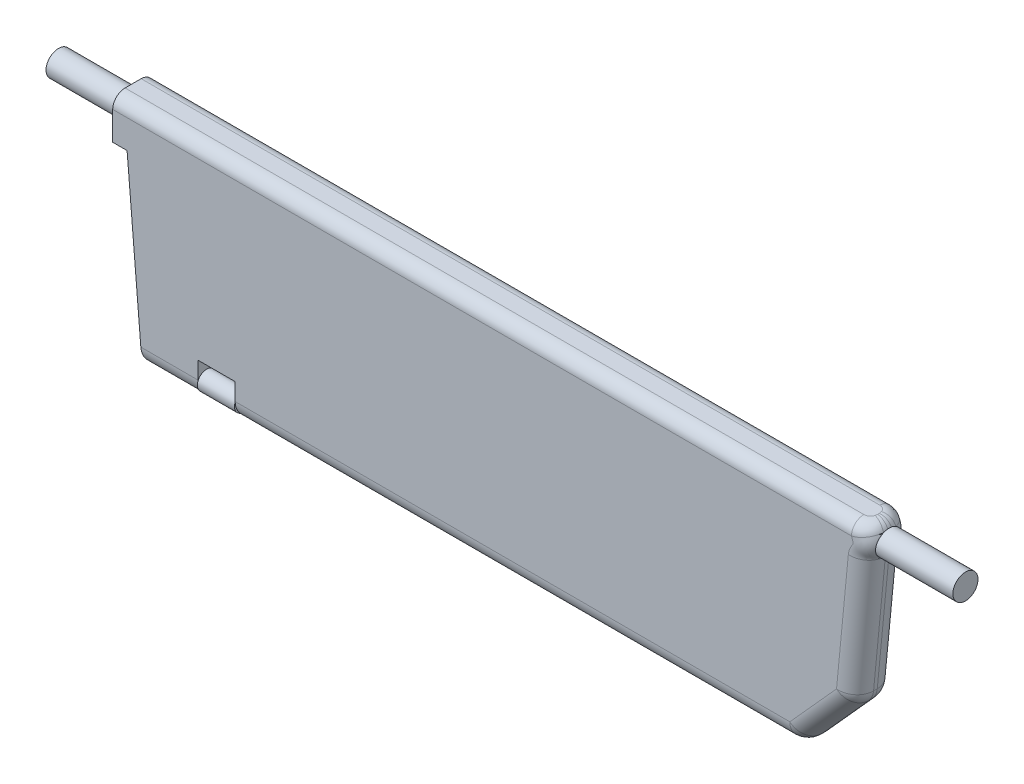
ISO-10303-21;
HEADER;
FILE_DESCRIPTION(('STEP AP214'),'2;1');
FILE_NAME('part.step','',(''),(''),'','','');
FILE_SCHEMA(('AUTOMOTIVE_DESIGN { 1 0 10303 214 1 1 1 1 }'));
ENDSEC;
DATA;
#1=APPLICATION_CONTEXT('core data for automotive mechanical design processes');
#2=APPLICATION_PROTOCOL_DEFINITION('international standard','automotive_design',2000,#1);
#3=PRODUCT_CONTEXT('',#1,'mechanical');
#4=PRODUCT('Part','Part','',(#3));
#5=PRODUCT_RELATED_PRODUCT_CATEGORY('part','',(#4));
#6=PRODUCT_DEFINITION_FORMATION('','',#4);
#7=PRODUCT_DEFINITION_CONTEXT('part definition',#1,'design');
#8=PRODUCT_DEFINITION('design','',#6,#7);
#9=PRODUCT_DEFINITION_SHAPE('','',#8);
#10=(LENGTH_UNIT() NAMED_UNIT(*) SI_UNIT(.MILLI.,.METRE.));
#11=(NAMED_UNIT(*) PLANE_ANGLE_UNIT() SI_UNIT($,.RADIAN.));
#12=(NAMED_UNIT(*) SI_UNIT($,.STERADIAN.) SOLID_ANGLE_UNIT());
#13=UNCERTAINTY_MEASURE_WITH_UNIT(LENGTH_MEASURE(1.E-05),#10,'distance_accuracy_value','');
#14=(GEOMETRIC_REPRESENTATION_CONTEXT(3) GLOBAL_UNCERTAINTY_ASSIGNED_CONTEXT((#13)) GLOBAL_UNIT_ASSIGNED_CONTEXT((#10,
#11,#12)) REPRESENTATION_CONTEXT('',''));
#15=CARTESIAN_POINT('',(0.,0.,0.));
#16=DIRECTION('',(0.,0.,1.));
#17=DIRECTION('',(1.,0.,0.));
#18=AXIS2_PLACEMENT_3D('',#15,#16,#17);
#19=CARTESIAN_POINT('',(0.,1.02626366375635,3.3));
#20=DIRECTION('',(0.,-1.,0.));
#21=DIRECTION('',(1.,0.,0.));
#22=AXIS2_PLACEMENT_3D('',#19,#20,#21);
#23=PLANE('',#22);
#24=DIRECTION('',(0.,0.,1.));
#25=VECTOR('',#24,1.);
#26=CARTESIAN_POINT('',(-55.8247989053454,1.02626366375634,3.3));
#27=LINE('',#26,#25);
#28=CARTESIAN_POINT('',(-55.8247989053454,1.02626366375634,1.5));
#29=VERTEX_POINT('',#28);
#30=CARTESIAN_POINT('',(-55.8247989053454,1.02626366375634,1.8));
#31=VERTEX_POINT('',#30);
#32=EDGE_CURVE('E224',#29,#31,#27,.T.);
#33=ORIENTED_EDGE('',*,*,#32,.F.);
#34=DIRECTION('',(-1.,0.,0.));
#35=VECTOR('',#34,1.);
#36=CARTESIAN_POINT('',(-10.3247989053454,1.02626366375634,1.5));
#37=LINE('',#36,#35);
#38=CARTESIAN_POINT('',(-10.9926419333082,1.02626366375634,1.5));
#39=VERTEX_POINT('',#38);
#40=EDGE_CURVE('E321',#29,#39,#37,.F.);
#41=ORIENTED_EDGE('',*,*,#40,.T.);
#42=DIRECTION('',(0.,0.,-1.));
#43=VECTOR('',#42,1.);
#44=CARTESIAN_POINT('',(-10.9926419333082,1.02626366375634,3.3));
#45=LINE('',#44,#43);
#46=CARTESIAN_POINT('',(-10.9926419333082,1.02626366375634,1.8));
#47=VERTEX_POINT('',#46);
#48=EDGE_CURVE('E347',#39,#47,#45,.F.);
#49=ORIENTED_EDGE('',*,*,#48,.T.);
#50=DIRECTION('',(-1.,0.,0.));
#51=VECTOR('',#50,1.);
#52=CARTESIAN_POINT('',(0.,1.02626366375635,1.8));
#53=LINE('',#52,#51);
#54=EDGE_CURVE('E326',#47,#31,#53,.T.);
#55=ORIENTED_EDGE('',*,*,#54,.T.);
#56=EDGE_LOOP('',(#33,#41,#49,#55));
#57=FACE_BOUND('',#56,.T.);
#58=ADVANCED_FACE('F39',(#57),#23,.T.);
#59=CARTESIAN_POINT('',(0.,2.52626366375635,1.5));
#60=DIRECTION('',(1.,0.,0.));
#61=DIRECTION('',(0.,1.,0.));
#62=AXIS2_PLACEMENT_3D('',#59,#60,#61);
#63=CYLINDRICAL_SURFACE('',#62,1.5);
#64=CARTESIAN_POINT('',(-55.8247989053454,2.52626366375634,1.5));
#65=DIRECTION('',(1.,0.,0.));
#66=DIRECTION('',(0.,0.,-1.));
#67=AXIS2_PLACEMENT_3D('',#64,#65,#66);
#68=CIRCLE('',#67,1.5);
#69=CARTESIAN_POINT('',(-55.8247989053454,2.52626366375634,0.));
#70=VERTEX_POINT('',#69);
#71=EDGE_CURVE('E267',#70,#29,#68,.F.);
#72=ORIENTED_EDGE('',*,*,#71,.F.);
#73=DIRECTION('',(-1.,0.,0.));
#74=VECTOR('',#73,1.);
#75=CARTESIAN_POINT('',(-63.3247989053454,2.52626366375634,0.));
#76=LINE('',#75,#74);
#77=CARTESIAN_POINT('',(-10.9926419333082,2.52626366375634,0.));
#78=VERTEX_POINT('',#77);
#79=EDGE_CURVE('E315',#78,#70,#76,.T.);
#80=ORIENTED_EDGE('',*,*,#79,.F.);
#81=CARTESIAN_POINT('',(-10.9926419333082,2.52626366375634,1.5));
#82=DIRECTION('',(1.,0.,0.));
#83=DIRECTION('',(0.,1.,0.));
#84=AXIS2_PLACEMENT_3D('',#81,#82,#83);
#85=CIRCLE('',#84,1.5);
#86=EDGE_CURVE('E349',#78,#39,#85,.F.);
#87=ORIENTED_EDGE('',*,*,#86,.T.);
#88=ORIENTED_EDGE('',*,*,#40,.F.);
#89=EDGE_LOOP('',(#72,#80,#87,#88));
#90=FACE_BOUND('',#89,.T.);
#91=ADVANCED_FACE('F542',(#90),#63,.T.);
#92=CARTESIAN_POINT('',(0.,2.52626366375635,1.8));
#93=DIRECTION('',(-1.,0.,0.));
#94=DIRECTION('',(0.,-1.,0.));
#95=AXIS2_PLACEMENT_3D('',#92,#93,#94);
#96=CYLINDRICAL_SURFACE('',#95,1.5);
#97=CARTESIAN_POINT('',(-55.8247989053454,2.52626366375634,1.8));
#98=DIRECTION('',(1.,0.,0.));
#99=DIRECTION('',(0.,0.,-1.));
#100=AXIS2_PLACEMENT_3D('',#97,#98,#99);
#101=CIRCLE('',#100,1.5);
#102=CARTESIAN_POINT('',(-55.8247989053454,1.50775006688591,2.90119482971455));
#103=VERTEX_POINT('',#102);
#104=EDGE_CURVE('E220',#31,#103,#101,.F.);
#105=ORIENTED_EDGE('',*,*,#104,.F.);
#106=ORIENTED_EDGE('',*,*,#54,.F.);
#107=CARTESIAN_POINT('',(-10.9926419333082,2.52626366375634,1.8));
#108=DIRECTION('',(-1.,0.,0.));
#109=DIRECTION('',(0.,-1.,0.));
#110=AXIS2_PLACEMENT_3D('',#107,#108,#109);
#111=CIRCLE('',#110,1.5);
#112=CARTESIAN_POINT('',(-10.9926419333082,2.52626366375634,3.3));
#113=VERTEX_POINT('',#112);
#114=EDGE_CURVE('E344',#47,#113,#111,.T.);
#115=ORIENTED_EDGE('',*,*,#114,.T.);
#116=DIRECTION('',(-1.,0.,0.));
#117=VECTOR('',#116,1.);
#118=CARTESIAN_POINT('',(0.,2.52626366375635,3.3));
#119=LINE('',#118,#117);
#120=CARTESIAN_POINT('',(-55.8247989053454,2.52626366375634,3.3));
#121=VERTEX_POINT('',#120);
#122=EDGE_CURVE('E330',#121,#113,#119,.F.);
#123=ORIENTED_EDGE('',*,*,#122,.F.);
#124=CARTESIAN_POINT('',(-55.8247989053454,2.47930732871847,3.29926485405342));
#125=VERTEX_POINT('',#124);
#126=EDGE_CURVE('E230',#125,#121,#101,.F.);
#127=ORIENTED_EDGE('',*,*,#126,.F.);
#128=EDGE_CURVE('E228',#103,#125,#101,.F.);
#129=ORIENTED_EDGE('',*,*,#128,.F.);
#130=EDGE_LOOP('',(#105,#106,#115,#123,#127,#129));
#131=FACE_BOUND('',#130,.T.);
#132=ADVANCED_FACE('F232',(#131),#96,.T.);
#133=CARTESIAN_POINT('',(-65.7247989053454,0.,3.3));
#134=DIRECTION('',(1.,0.,0.));
#135=DIRECTION('',(0.,0.,-1.));
#136=AXIS2_PLACEMENT_3D('',#133,#134,#135);
#137=PLANE('',#136);
#138=CARTESIAN_POINT('',(-65.7247989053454,17.4703622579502,1.67585563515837));
#139=DIRECTION('',(1.,0.,0.));
#140=DIRECTION('',(0.,0.,-1.));
#141=AXIS2_PLACEMENT_3D('',#138,#139,#140);
#142=CIRCLE('',#141,1.01462780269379);
#143=CARTESIAN_POINT('',(-65.7247989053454,17.4703622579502,0.661227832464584));
#144=VERTEX_POINT('',#143);
#145=EDGE_CURVE('E281',#144,#144,#142,.F.);
#146=ORIENTED_EDGE('',*,*,#145,.F.);
#147=EDGE_LOOP('',(#146));
#148=FACE_BOUND('',#147,.T.);
#149=DIRECTION('',(0.,0.,-1.));
#150=VECTOR('',#149,1.);
#151=CARTESIAN_POINT('',(-65.7247989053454,19.0262636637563,3.3));
#152=LINE('',#151,#150);
#153=CARTESIAN_POINT('',(-65.7247989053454,19.0262636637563,2.3));
#154=VERTEX_POINT('',#153);
#155=CARTESIAN_POINT('',(-65.7247989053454,19.0262636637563,1.));
#156=VERTEX_POINT('',#155);
#157=EDGE_CURVE('E294',#154,#156,#152,.T.);
#158=ORIENTED_EDGE('',*,*,#157,.T.);
#159=CARTESIAN_POINT('',(-65.7247989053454,18.0262636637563,1.));
#160=DIRECTION('',(1.,0.,0.));
#161=DIRECTION('',(0.,0.,-1.));
#162=AXIS2_PLACEMENT_3D('',#159,#160,#161);
#163=CIRCLE('',#162,1.);
#164=CARTESIAN_POINT('',(-65.7247989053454,18.0262636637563,0.));
#165=VERTEX_POINT('',#164);
#166=EDGE_CURVE('E587',#156,#165,#163,.F.);
#167=ORIENTED_EDGE('',*,*,#166,.T.);
#168=DIRECTION('',(0.,-1.,0.));
#169=VECTOR('',#168,1.);
#170=CARTESIAN_POINT('',(-65.7247989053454,0.,0.));
#171=LINE('',#170,#169);
#172=CARTESIAN_POINT('',(-65.7247989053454,15.7255799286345,0.));
#173=VERTEX_POINT('',#172);
#174=EDGE_CURVE('E280',#165,#173,#171,.T.);
#175=ORIENTED_EDGE('',*,*,#174,.T.);
#176=DIRECTION('',(0.,0.,-1.));
#177=VECTOR('',#176,1.);
#178=CARTESIAN_POINT('',(-65.7247989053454,15.7255799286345,3.3));
#179=LINE('',#178,#177);
#180=CARTESIAN_POINT('',(-65.7247989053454,15.7255799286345,3.3));
#181=VERTEX_POINT('',#180);
#182=EDGE_CURVE('E307',#181,#173,#179,.T.);
#183=ORIENTED_EDGE('',*,*,#182,.F.);
#184=DIRECTION('',(0.,-1.,0.));
#185=VECTOR('',#184,1.);
#186=CARTESIAN_POINT('',(-65.7247989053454,0.,3.3));
#187=LINE('',#186,#185);
#188=CARTESIAN_POINT('',(-65.7247989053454,18.0262636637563,3.3));
#189=VERTEX_POINT('',#188);
#190=EDGE_CURVE('E286',#189,#181,#187,.T.);
#191=ORIENTED_EDGE('',*,*,#190,.F.);
#192=CARTESIAN_POINT('',(-65.7247989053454,18.0262636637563,2.3));
#193=DIRECTION('',(1.,0.,0.));
#194=DIRECTION('',(0.,0.,-1.));
#195=AXIS2_PLACEMENT_3D('',#192,#193,#194);
#196=CIRCLE('',#195,1.);
#197=EDGE_CURVE('E592',#189,#154,#196,.F.);
#198=ORIENTED_EDGE('',*,*,#197,.T.);
#199=EDGE_LOOP('',(#158,#167,#175,#183,#191,#198));
#200=FACE_BOUND('',#199,.T.);
#201=ADVANCED_FACE('F584',(#148,#200),#137,.F.);
#202=CARTESIAN_POINT('',(0.,15.7255799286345,3.3));
#203=DIRECTION('',(0.,1.,0.));
#204=DIRECTION('',(0.,0.,1.));
#205=AXIS2_PLACEMENT_3D('',#202,#203,#204);
#206=PLANE('',#205);
#207=DIRECTION('',(1.,0.,0.));
#208=VECTOR('',#207,1.);
#209=CARTESIAN_POINT('',(0.,15.7255799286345,0.));
#210=LINE('',#209,#208);
#211=CARTESIAN_POINT('',(-64.5605451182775,15.7255799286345,0.));
#212=VERTEX_POINT('',#211);
#213=EDGE_CURVE('E296',#173,#212,#210,.T.);
#214=ORIENTED_EDGE('',*,*,#213,.T.);
#215=DIRECTION('',(0.,0.,-1.));
#216=VECTOR('',#215,1.);
#217=CARTESIAN_POINT('',(-64.5605451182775,15.7255799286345,3.3));
#218=LINE('',#217,#216);
#219=CARTESIAN_POINT('',(-64.5605451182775,15.7255799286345,3.3));
#220=VERTEX_POINT('',#219);
#221=EDGE_CURVE('E304',#220,#212,#218,.T.);
#222=ORIENTED_EDGE('',*,*,#221,.F.);
#223=DIRECTION('',(1.,0.,0.));
#224=VECTOR('',#223,1.);
#225=CARTESIAN_POINT('',(0.,15.7255799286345,3.3));
#226=LINE('',#225,#224);
#227=EDGE_CURVE('E288',#181,#220,#226,.T.);
#228=ORIENTED_EDGE('',*,*,#227,.F.);
#229=ORIENTED_EDGE('',*,*,#182,.T.);
#230=EDGE_LOOP('',(#214,#222,#228,#229));
#231=FACE_BOUND('',#230,.T.);
#232=ADVANCED_FACE('F564',(#231),#206,.F.);
#233=CARTESIAN_POINT('',(-62.7947225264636,-5.2790442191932,3.3));
#234=DIRECTION('',(0.996484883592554,0.0837727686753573,0.));
#235=DIRECTION('',(-0.0837727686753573,0.996484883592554,0.));
#236=AXIS2_PLACEMENT_3D('',#233,#234,#235);
#237=PLANE('',#236);
#238=DIRECTION('',(0.,0.,-1.));
#239=VECTOR('',#238,1.);
#240=CARTESIAN_POINT('',(-63.3247989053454,1.02626366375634,3.3));
#241=LINE('',#240,#239);
#242=CARTESIAN_POINT('',(-63.3247989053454,1.02626366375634,1.8));
#243=VERTEX_POINT('',#242);
#244=CARTESIAN_POINT('',(-63.3247989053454,1.02626366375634,1.5));
#245=VERTEX_POINT('',#244);
#246=EDGE_CURVE('E302',#243,#245,#241,.T.);
#247=ORIENTED_EDGE('',*,*,#246,.F.);
#248=CARTESIAN_POINT('',(-63.4509013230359,2.52626366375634,1.8));
#249=DIRECTION('',(0.996484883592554,0.0837727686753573,0.));
#250=DIRECTION('',(-0.0837727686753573,0.996484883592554,0.));
#251=AXIS2_PLACEMENT_3D('',#248,#249,#250);
#252=ELLIPSE('',#251,1.50529127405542,1.5);
#253=CARTESIAN_POINT('',(-63.4509013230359,2.52626366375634,3.3));
#254=VERTEX_POINT('',#253);
#255=EDGE_CURVE('E328',#243,#254,#252,.F.);
#256=ORIENTED_EDGE('',*,*,#255,.T.);
#257=DIRECTION('',(0.0837727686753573,-0.996484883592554,0.));
#258=VECTOR('',#257,1.);
#259=CARTESIAN_POINT('',(-62.7947225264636,-5.2790442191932,3.3));
#260=LINE('',#259,#258);
#261=EDGE_CURVE('E291',#220,#254,#260,.T.);
#262=ORIENTED_EDGE('',*,*,#261,.F.);
#263=ORIENTED_EDGE('',*,*,#221,.T.);
#264=DIRECTION('',(0.0837727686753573,-0.996484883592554,0.));
#265=VECTOR('',#264,1.);
#266=CARTESIAN_POINT('',(-62.7947225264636,-5.2790442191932,0.));
#267=LINE('',#266,#265);
#268=CARTESIAN_POINT('',(-63.4509013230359,2.52626366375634,0.));
#269=VERTEX_POINT('',#268);
#270=EDGE_CURVE('E289',#212,#269,#267,.T.);
#271=ORIENTED_EDGE('',*,*,#270,.T.);
#272=CARTESIAN_POINT('',(-63.4509013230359,2.52626366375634,1.5));
#273=DIRECTION('',(0.996484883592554,0.0837727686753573,0.));
#274=DIRECTION('',(0.0837727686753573,-0.996484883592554,0.));
#275=AXIS2_PLACEMENT_3D('',#272,#273,#274);
#276=ELLIPSE('',#275,1.50529127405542,1.5);
#277=EDGE_CURVE('E318',#269,#245,#276,.F.);
#278=ORIENTED_EDGE('',*,*,#277,.T.);
#279=EDGE_LOOP('',(#247,#256,#262,#263,#271,#278));
#280=FACE_BOUND('',#279,.T.);
#281=ADVANCED_FACE('F556',(#280),#237,.F.);
#282=DIRECTION('',(0.,0.,-1.));
#283=VECTOR('',#282,1.);
#284=CARTESIAN_POINT('',(-58.8247989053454,1.02626366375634,3.3));
#285=LINE('',#284,#283);
#286=CARTESIAN_POINT('',(-58.8247989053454,1.02626366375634,1.8));
#287=VERTEX_POINT('',#286);
#288=CARTESIAN_POINT('',(-58.8247989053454,1.02626366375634,1.5));
#289=VERTEX_POINT('',#288);
#290=EDGE_CURVE('E258',#287,#289,#285,.T.);
#291=ORIENTED_EDGE('',*,*,#290,.F.);
#292=EDGE_CURVE('E325',#287,#243,#53,.T.);
#293=ORIENTED_EDGE('',*,*,#292,.T.);
#294=ORIENTED_EDGE('',*,*,#246,.T.);
#295=EDGE_CURVE('E322',#245,#289,#37,.F.);
#296=ORIENTED_EDGE('',*,*,#295,.T.);
#297=EDGE_LOOP('',(#291,#293,#294,#296));
#298=FACE_BOUND('',#297,.T.);
#299=ADVANCED_FACE('F545',(#298),#23,.T.);
#300=CARTESIAN_POINT('',(-6.21233797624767,5.59361423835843,3.3));
#301=DIRECTION('',(0.743144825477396,-0.669130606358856,0.));
#302=DIRECTION('',(0.669130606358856,0.743144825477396,0.));
#303=AXIS2_PLACEMENT_3D('',#300,#301,#302);
#304=PLANE('',#303);
#305=DIRECTION('',(-0.669130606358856,-0.743144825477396,0.));
#306=VECTOR('',#305,1.);
#307=CARTESIAN_POINT('',(-5.77471078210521,6.07964847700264,1.5));
#308=LINE('',#307,#306);
#309=CARTESIAN_POINT('',(-9.87792469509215,1.52256775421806,1.5));
#310=VERTEX_POINT('',#309);
#311=CARTESIAN_POINT('',(-6.10553977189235,5.71222566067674,1.5));
#312=VERTEX_POINT('',#311);
#313=EDGE_CURVE('E334',#310,#312,#308,.F.);
#314=ORIENTED_EDGE('',*,*,#313,.T.);
#315=DIRECTION('',(0.,0.,-1.));
#316=VECTOR('',#315,1.);
#317=CARTESIAN_POINT('',(-6.10553977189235,5.71222566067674,1.8));
#318=LINE('',#317,#316);
#319=CARTESIAN_POINT('',(-6.10553977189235,5.71222566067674,1.8));
#320=VERTEX_POINT('',#319);
#321=EDGE_CURVE('E753',#312,#320,#318,.F.);
#322=ORIENTED_EDGE('',*,*,#321,.T.);
#323=DIRECTION('',(-0.669130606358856,-0.743144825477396,0.));
#324=VECTOR('',#323,1.);
#325=CARTESIAN_POINT('',(-6.21233797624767,5.59361423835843,1.8));
#326=LINE('',#325,#324);
#327=CARTESIAN_POINT('',(-9.87792469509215,1.52256775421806,1.8));
#328=VERTEX_POINT('',#327);
#329=EDGE_CURVE('E339',#320,#328,#326,.T.);
#330=ORIENTED_EDGE('',*,*,#329,.T.);
#331=DIRECTION('',(0.,0.,-1.));
#332=VECTOR('',#331,1.);
#333=CARTESIAN_POINT('',(-9.87792469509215,1.52256775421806,3.3));
#334=LINE('',#333,#332);
#335=EDGE_CURVE('E337',#328,#310,#334,.T.);
#336=ORIENTED_EDGE('',*,*,#335,.T.);
#337=EDGE_LOOP('',(#314,#322,#330,#336));
#338=FACE_BOUND('',#337,.T.);
#339=ADVANCED_FACE('F555',(#338),#304,.T.);
#340=CARTESIAN_POINT('',(-6.30291420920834,0.608505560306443,3.3));
#341=DIRECTION('',(-0.995372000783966,0.0960967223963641,0.));
#342=DIRECTION('',(-0.0960967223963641,-0.995372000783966,0.));
#343=AXIS2_PLACEMENT_3D('',#340,#341,#342);
#344=PLANE('',#343);
#345=CARTESIAN_POINT('',(-4.67501111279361,17.4703622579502,1.67585563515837));
#346=DIRECTION('',(-0.995372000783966,0.0960967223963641,0.));
#347=DIRECTION('',(0.0960967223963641,0.995372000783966,0.));
#348=AXIS2_PLACEMENT_3D('',#345,#346,#347);
#349=ELLIPSE('',#348,1.01934533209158,1.01462780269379);
#350=CARTESIAN_POINT('',(-4.77223086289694,16.4633579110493,1.8));
#351=VERTEX_POINT('',#350);
#352=CARTESIAN_POINT('',(-4.77148434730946,16.471090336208,1.5));
#353=VERTEX_POINT('',#352);
#354=EDGE_CURVE('E314',#351,#353,#349,.F.);
#355=ORIENTED_EDGE('',*,*,#354,.F.);
#356=DIRECTION('',(0.0960967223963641,0.995372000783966,0.));
#357=VECTOR('',#356,1.);
#358=CARTESIAN_POINT('',(-5.53229535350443,8.59059291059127,1.8));
#359=LINE('',#358,#357);
#360=CARTESIAN_POINT('',(-5.7271990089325,6.57177648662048,1.8));
#361=VERTEX_POINT('',#360);
#362=EDGE_CURVE('E720',#351,#361,#359,.F.);
#363=ORIENTED_EDGE('',*,*,#362,.T.);
#364=DIRECTION('',(0.,0.,-1.));
#365=VECTOR('',#364,1.);
#366=CARTESIAN_POINT('',(-5.7271990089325,6.57177648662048,1.5));
#367=LINE('',#366,#365);
#368=CARTESIAN_POINT('',(-5.7271990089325,6.57177648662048,1.5));
#369=VERTEX_POINT('',#368);
#370=EDGE_CURVE('E737',#361,#369,#367,.T.);
#371=ORIENTED_EDGE('',*,*,#370,.T.);
#372=DIRECTION('',(0.0960967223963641,0.995372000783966,0.));
#373=VECTOR('',#372,1.);
#374=CARTESIAN_POINT('',(-6.30291420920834,0.608505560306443,1.5));
#375=LINE('',#374,#373);
#376=EDGE_CURVE('E723',#369,#353,#375,.T.);
#377=ORIENTED_EDGE('',*,*,#376,.T.);
#378=EDGE_LOOP('',(#355,#363,#371,#377));
#379=FACE_BOUND('',#378,.T.);
#380=ADVANCED_FACE('F562',(#379),#344,.F.);
#381=CARTESIAN_POINT('',(0.,19.0262636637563,3.3));
#382=DIRECTION('',(0.,1.,0.));
#383=DIRECTION('',(0.,0.,1.));
#384=AXIS2_PLACEMENT_3D('',#381,#382,#383);
#385=PLANE('',#384);
#386=CARTESIAN_POINT('',(-6.25923613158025,16.2730331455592,0.));
#387=CARTESIAN_POINT('',(-4.72728003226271,16.4701197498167,0.));
#388=CARTESIAN_POINT('',(-4.77213516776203,16.464349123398,1.54391947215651));
#389=CARTESIAN_POINT('',(-6.26466034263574,16.3151507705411,0.));
#390=CARTESIAN_POINT('',(-4.73130078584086,16.4688719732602,0.));
#391=CARTESIAN_POINT('',(-4.77208344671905,16.4648848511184,1.53987657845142));
#392=CARTESIAN_POINT('',(-6.26830569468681,16.3574946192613,0.));
#393=CARTESIAN_POINT('',(-4.73578776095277,16.4679583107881,0.));
#394=CARTESIAN_POINT('',(-4.77202572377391,16.4654827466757,1.53546831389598));
#395=CARTESIAN_POINT('',(-6.27205539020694,16.4423264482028,0.));
#396=CARTESIAN_POINT('',(-4.74586051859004,16.4671897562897,0.));
#397=CARTESIAN_POINT('',(-4.77188793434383,16.4669099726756,1.52558558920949));
#398=CARTESIAN_POINT('',(-6.27216079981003,16.4848143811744,0.));
#399=CARTESIAN_POINT('',(-4.75143872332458,16.4673312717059,0.));
#400=CARTESIAN_POINT('',(-4.77180787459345,16.4677392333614,1.52011145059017));
#401=CARTESIAN_POINT('',(-6.26885420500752,16.56955852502,0.));
#402=CARTESIAN_POINT('',(-4.76383514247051,16.4690419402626,0.));
#403=CARTESIAN_POINT('',(-4.77161526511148,16.4697342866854,1.50777307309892));
#404=CARTESIAN_POINT('',(-6.26544993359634,16.6118150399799,0.));
#405=CARTESIAN_POINT('',(-4.77063973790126,16.4706012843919,0.));
#406=CARTESIAN_POINT('',(-4.77150278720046,16.4708993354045,1.50091191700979));
#407=CARTESIAN_POINT('',(-6.25519700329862,16.6959097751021,0.));
#408=CARTESIAN_POINT('',(-4.78572280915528,16.4757177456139,0.));
#409=CARTESIAN_POINT('',(-4.77122602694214,16.4737660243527,1.48525023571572));
#410=CARTESIAN_POINT('',(-6.24834811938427,16.7377479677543,0.));
#411=CARTESIAN_POINT('',(-4.79398440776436,16.4792614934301,0.));
#412=CARTESIAN_POINT('',(-4.77106174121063,16.4754676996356,1.47644958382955));
#413=CARTESIAN_POINT('',(-6.2311537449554,16.8214890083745,0.));
#414=CARTESIAN_POINT('',(-4.81245600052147,16.4893025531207,0.));
#415=CARTESIAN_POINT('',(-4.77064264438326,16.479808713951,1.45588812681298));
#416=CARTESIAN_POINT('',(-6.2207470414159,16.8633792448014,0.));
#417=CARTESIAN_POINT('',(-4.82267085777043,16.4958241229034,0.));
#418=CARTESIAN_POINT('',(-4.77038624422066,16.4824645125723,1.44407648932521));
#419=CARTESIAN_POINT('',(-6.19663368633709,16.9461970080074,0.));
#420=CARTESIAN_POINT('',(-4.8454134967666,16.5132748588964,0.));
#421=CARTESIAN_POINT('',(-4.76971458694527,16.4894215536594,1.41615388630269));
#422=CARTESIAN_POINT('',(-6.18292719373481,16.9871245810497,0.));
#423=CARTESIAN_POINT('',(-4.85789116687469,16.5241422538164,0.));
#424=CARTESIAN_POINT('',(-4.76929933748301,16.4937227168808,1.40004312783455));
#425=CARTESIAN_POINT('',(-6.16009326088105,17.0476528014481,0.));
#426=CARTESIAN_POINT('',(-4.87892168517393,16.5457947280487,0.));
#427=CARTESIAN_POINT('',(-4.76843737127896,16.5026509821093,1.37072674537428));
#428=CARTESIAN_POINT('',(-6.15210048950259,17.067690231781,0.));
#429=CARTESIAN_POINT('',(-4.88627110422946,16.5538483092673,0.));
#430=CARTESIAN_POINT('',(-4.7681100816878,16.5060410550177,1.36009273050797));
#431=CARTESIAN_POINT('',(-6.13540538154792,17.1074671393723,0.));
#432=CARTESIAN_POINT('',(-4.90182083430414,16.5722427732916,0.));
#433=CARTESIAN_POINT('',(-4.76733639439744,16.5140549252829,1.33658850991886));
#434=CARTESIAN_POINT('',(-6.12670307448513,17.1272066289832,0.));
#435=CARTESIAN_POINT('',(-4.91000522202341,16.5825557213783,0.));
#436=CARTESIAN_POINT('',(-4.76689000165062,16.5186786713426,1.3237183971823));
#437=CARTESIAN_POINT('',(-6.10865518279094,17.1663800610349,0.));
#438=CARTESIAN_POINT('',(-4.92733522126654,16.6061732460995,0.));
#439=CARTESIAN_POINT('',(-4.76581922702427,16.5297697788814,1.29507432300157));
#440=CARTESIAN_POINT('',(-6.09930981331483,17.1858141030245,0.));
#441=CARTESIAN_POINT('',(-4.93645853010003,16.6194327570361,0.));
#442=CARTESIAN_POINT('',(-4.76519490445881,16.5362365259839,1.27930132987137));
#443=CARTESIAN_POINT('',(-6.08006346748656,17.2244040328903,0.));
#444=CARTESIAN_POINT('',(-4.95577452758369,16.6499864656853,0.));
#445=CARTESIAN_POINT('',(-4.76366717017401,16.5520608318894,1.24392219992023));
#446=CARTESIAN_POINT('',(-6.07016249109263,17.2435599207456,0.));
#447=CARTESIAN_POINT('',(-4.96593682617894,16.6672090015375,0.));
#448=CARTESIAN_POINT('',(-4.7627637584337,16.5614183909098,1.22431606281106));
#449=CARTESIAN_POINT('',(-6.04918660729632,17.2830547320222,0.));
#450=CARTESIAN_POINT('',(-4.98817764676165,16.7086376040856,0.));
#451=CARTESIAN_POINT('',(-4.76042630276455,16.5856298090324,1.17838975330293));
#452=CARTESIAN_POINT('',(-6.03807906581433,17.3033761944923,0.));
#453=CARTESIAN_POINT('',(-5.00030379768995,16.7331448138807,0.));
#454=CARTESIAN_POINT('',(-4.75895791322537,16.600839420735,1.15167985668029));
#455=CARTESIAN_POINT('',(-6.02125263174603,17.3337809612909,0.));
#456=CARTESIAN_POINT('',(-5.01941596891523,16.7770650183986,0.));
#457=CARTESIAN_POINT('',(-4.75606517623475,16.63080245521,1.10583058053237));
#458=CARTESIAN_POINT('',(-6.01561302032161,17.3439087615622,0.));
#459=CARTESIAN_POINT('',(-5.0258936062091,16.7927726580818,0.));
#460=CARTESIAN_POINT('',(-4.75498508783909,16.6419900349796,1.08957243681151));
#461=CARTESIAN_POINT('',(-6.00433702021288,17.364166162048,0.));
#462=CARTESIAN_POINT('',(-5.0390331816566,16.8269935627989,0.));
#463=CARTESIAN_POINT('',(-4.75251024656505,16.6676244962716,1.05492777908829));
#464=CARTESIAN_POINT('',(-5.99870063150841,17.3742957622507,0.));
#465=CARTESIAN_POINT('',(-5.04568707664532,16.8454651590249,0.));
#466=CARTESIAN_POINT('',(-4.75111549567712,16.6820713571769,1.03654127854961));
#467=CARTESIAN_POINT('',(-5.98752455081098,17.394563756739,0.));
#468=CARTESIAN_POINT('',(-5.0590026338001,16.8857196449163,0.));
#469=CARTESIAN_POINT('',(-4.74790755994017,16.7152992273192,0.99762038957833));
#470=CARTESIAN_POINT('',(-5.98198459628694,17.4047020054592,0.));
#471=CARTESIAN_POINT('',(-5.06565732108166,16.9074386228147,0.));
#472=CARTESIAN_POINT('',(-4.74609580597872,16.7340654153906,0.977093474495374));
#473=CARTESIAN_POINT('',(-5.97108657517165,17.4250803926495,0.));
#474=CARTESIAN_POINT('',(-5.0787285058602,16.9548979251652,0.));
#475=CARTESIAN_POINT('',(-4.7419054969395,16.7774687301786,0.934029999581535));
#476=CARTESIAN_POINT('',(-5.96572855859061,17.4353205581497,0.));
#477=CARTESIAN_POINT('',(-5.08514220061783,16.980578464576,0.));
#478=CARTESIAN_POINT('',(-4.73952678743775,16.8021074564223,0.911492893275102));
#479=CARTESIAN_POINT('',(-5.95535976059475,17.4559510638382,0.));
#480=CARTESIAN_POINT('',(-5.09727390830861,17.0365634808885,0.));
#481=CARTESIAN_POINT('',(-4.7340307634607,16.8590353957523,0.865242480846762));
#482=CARTESIAN_POINT('',(-5.95034829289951,17.4663410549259,0.));
#483=CARTESIAN_POINT('',(-5.10299818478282,17.0667963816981,0.));
#484=CARTESIAN_POINT('',(-4.73091496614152,16.8913088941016,0.841531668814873));
#485=CARTESIAN_POINT('',(-5.94088139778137,17.4873690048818,0.));
#486=CARTESIAN_POINT('',(-5.11309028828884,17.1323987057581,0.));
#487=CARTESIAN_POINT('',(-4.72376116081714,16.9654081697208,0.794718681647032));
#488=CARTESIAN_POINT('',(-5.93642558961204,17.4980067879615,0.));
#489=CARTESIAN_POINT('',(-5.11747559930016,17.1677242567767,0.));
#490=CARTESIAN_POINT('',(-4.7197237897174,17.0072273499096,0.771616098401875));
#491=CARTESIAN_POINT('',(-5.92929233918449,17.517111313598,0.));
#492=CARTESIAN_POINT('',(-5.12324765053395,17.2347075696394,0.));
#493=CARTESIAN_POINT('',(-4.71168782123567,17.0904640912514,0.734202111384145));
#494=CARTESIAN_POINT('',(-5.92644180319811,17.5255124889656,0.));
#495=CARTESIAN_POINT('',(-5.12510235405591,17.2652865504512,0.));
#496=CARTESIAN_POINT('',(-4.70789532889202,17.1297468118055,0.719092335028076));
#497=CARTESIAN_POINT('',(-5.92139583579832,17.5425117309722,0.));
#498=CARTESIAN_POINT('',(-5.1270514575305,17.3288594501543,0.));
#499=CARTESIAN_POINT('',(-4.69977282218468,17.2138799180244,0.693198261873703));
#500=CARTESIAN_POINT('',(-5.91920029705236,17.5511097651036,0.));
#501=CARTESIAN_POINT('',(-5.12715789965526,17.3619004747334,0.));
#502=CARTESIAN_POINT('',(-4.6954428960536,17.258729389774,0.682413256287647));
#503=CARTESIAN_POINT('',(-5.91561685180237,17.5683888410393,0.));
#504=CARTESIAN_POINT('',(-5.12530669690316,17.4290291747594,0.));
#505=CARTESIAN_POINT('',(-4.68647614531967,17.3516071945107,0.667118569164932));
#506=CARTESIAN_POINT('',(-5.91422134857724,17.5770682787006,0.));
#507=CARTESIAN_POINT('',(-5.1233732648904,17.4631862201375,0.));
#508=CARTESIAN_POINT('',(-4.6818426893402,17.3996006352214,0.662549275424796));
#509=CARTESIAN_POINT('',(-5.91227343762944,17.5945214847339,0.));
#510=CARTESIAN_POINT('',(-5.11742467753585,17.5314346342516,0.));
#511=CARTESIAN_POINT('',(-4.67252472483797,17.4961163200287,0.660405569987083));
#512=CARTESIAN_POINT('',(-5.91172104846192,17.6032952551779,0.));
#513=CARTESIAN_POINT('',(-5.11340153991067,17.565628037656,0.));
#514=CARTESIAN_POINT('',(-4.6678402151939,17.5446385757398,0.662831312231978));
#515=CARTESIAN_POINT('',(-5.91139631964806,17.6233321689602,0.));
#516=CARTESIAN_POINT('',(-5.10212507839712,17.6419643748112,0.));
#517=CARTESIAN_POINT('',(-4.65745124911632,17.6522477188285,0.675814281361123));
#518=CARTESIAN_POINT('',(-5.9118879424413,17.6345994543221,0.));
#519=CARTESIAN_POINT('',(-5.09425048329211,17.6837648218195,0.));
#520=CARTESIAN_POINT('',(-4.65183178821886,17.7104542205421,0.688472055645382));
#521=CARTESIAN_POINT('',(-5.91398121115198,17.6570287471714,0.));
#522=CARTESIAN_POINT('',(-5.07649811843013,17.7628208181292,0.));
#523=CARTESIAN_POINT('',(-4.64146218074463,17.8178628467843,0.720917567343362));
#524=CARTESIAN_POINT('',(-5.9155837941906,17.6681906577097,0.));
#525=CARTESIAN_POINT('',(-5.06657600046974,17.800166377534,0.));
#526=CARTESIAN_POINT('',(-4.63671277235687,17.8670573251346,0.740711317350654));
#527=CARTESIAN_POINT('',(-5.91961919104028,17.6905508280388,0.));
#528=CARTESIAN_POINT('',(-5.04559317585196,17.8702683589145,0.));
#529=CARTESIAN_POINT('',(-4.62810797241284,17.9561860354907,0.783695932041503));
#530=CARTESIAN_POINT('',(-5.9220655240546,17.701746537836,0.));
#531=CARTESIAN_POINT('',(-5.03449172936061,17.9029341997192,0.));
#532=CARTESIAN_POINT('',(-4.62426897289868,17.9959504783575,0.806938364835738));
#533=CARTESIAN_POINT('',(-5.92614006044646,17.7184372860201,0.));
#534=CARTESIAN_POINT('',(-5.01772407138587,17.9480126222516,0.));
#535=CARTESIAN_POINT('',(-4.619172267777,18.0487422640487,0.841956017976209));
#536=CARTESIAN_POINT('',(-5.92756578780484,17.7239838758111,0.));
#537=CARTESIAN_POINT('',(-5.01209189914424,17.9624376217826,0.));
#538=CARTESIAN_POINT('',(-4.61758363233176,18.0651973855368,0.853654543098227));
#539=CARTESIAN_POINT('',(-5.9305246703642,17.7350482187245,0.));
#540=CARTESIAN_POINT('',(-5.00083610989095,17.9900984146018,0.));
#541=CARTESIAN_POINT('',(-4.61460418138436,18.0960586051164,0.876890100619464));
#542=CARTESIAN_POINT('',(-5.93205782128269,17.7405659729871,0.));
#543=CARTESIAN_POINT('',(-4.99521271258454,18.003327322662,0.));
#544=CARTESIAN_POINT('',(-4.61321335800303,18.1104647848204,0.888427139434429));
#545=CARTESIAN_POINT('',(-5.93716060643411,17.7584160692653,0.));
#546=CARTESIAN_POINT('',(-4.97702988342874,18.0445590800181,0.));
#547=CARTESIAN_POINT('',(-4.60898816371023,18.1542294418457,0.925273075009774));
#548=CARTESIAN_POINT('',(-5.94089466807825,17.7707010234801,0.));
#549=CARTESIAN_POINT('',(-4.96467541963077,18.0701335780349,0.));
#550=CARTESIAN_POINT('',(-4.60650622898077,18.1799373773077,0.949890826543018));
#551=CARTESIAN_POINT('',(-5.94856285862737,17.7952086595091,0.));
#552=CARTESIAN_POINT('',(-4.94065338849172,18.1167605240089,0.));
#553=CARTESIAN_POINT('',(-4.6021863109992,18.2246831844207,0.996513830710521));
#554=CARTESIAN_POINT('',(-5.95249701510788,17.8074313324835,0.));
#555=CARTESIAN_POINT('',(-4.9290071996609,18.1377339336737,0.));
#556=CARTESIAN_POINT('',(-4.60034841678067,18.2437201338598,1.0185187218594));
#557=CARTESIAN_POINT('',(-5.9604270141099,17.8318611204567,0.));
#558=CARTESIAN_POINT('',(-4.90652875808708,18.1760490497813,0.));
#559=CARTESIAN_POINT('',(-4.59713413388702,18.2770137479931,1.05983136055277));
#560=CARTESIAN_POINT('',(-5.96442287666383,17.8440682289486,0.));
#561=CARTESIAN_POINT('',(-4.89571931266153,18.1933272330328,0.));
#562=CARTESIAN_POINT('',(-4.59575789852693,18.2912688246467,1.07913821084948));
#563=CARTESIAN_POINT('',(-5.972379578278,17.8684929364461,0.));
#564=CARTESIAN_POINT('',(-4.87494322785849,18.2249512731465,0.));
#565=CARTESIAN_POINT('',(-4.59333826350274,18.3163314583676,1.11524705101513));
#566=CARTESIAN_POINT('',(-5.97634041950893,17.8807105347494,0.));
#567=CARTESIAN_POINT('',(-4.86499697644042,18.2392504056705,0.));
#568=CARTESIAN_POINT('',(-4.59229484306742,18.3271392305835,1.13204919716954));
#569=CARTESIAN_POINT('',(-5.98806501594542,17.9174115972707,0.));
#570=CARTESIAN_POINT('',(-4.83624879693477,18.2788184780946,0.));
#571=CARTESIAN_POINT('',(-4.58951937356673,18.3558876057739,1.17916645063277));
#572=CARTESIAN_POINT('',(-5.99567182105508,17.9419462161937,0.));
#573=CARTESIAN_POINT('',(-4.8188816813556,18.3002238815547,0.));
#574=CARTESIAN_POINT('',(-4.58814178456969,18.3701567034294,1.20619713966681));
#575=CARTESIAN_POINT('',(-6.01012890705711,17.9912362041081,0.));
#576=CARTESIAN_POINT('',(-4.78683244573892,18.3369782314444,0.));
#577=CARTESIAN_POINT('',(-4.58589268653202,18.3934529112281,1.25390421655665));
#578=CARTESIAN_POINT('',(-6.01697929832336,18.0159915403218,0.));
#579=CARTESIAN_POINT('',(-4.77224050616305,18.3521835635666,0.));
#580=CARTESIAN_POINT('',(-4.58502110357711,18.402480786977,1.27458153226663));
#581=CARTESIAN_POINT('',(-6.0296343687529,18.0653296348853,0.));
#582=CARTESIAN_POINT('',(-4.74547528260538,18.378168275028,0.));
#583=CARTESIAN_POINT('',(-4.58358537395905,18.4173521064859,1.31108132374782));
#584=CARTESIAN_POINT('',(-6.03545459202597,18.0899083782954,0.));
#585=CARTESIAN_POINT('',(-4.7333188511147,18.3889439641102,0.));
#586=CARTESIAN_POINT('',(-4.5830163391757,18.4232461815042,1.32697906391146));
#587=CARTESIAN_POINT('',(-6.04607546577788,18.1392874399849,0.));
#588=CARTESIAN_POINT('',(-4.71073814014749,18.4075829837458,0.));
#589=CARTESIAN_POINT('',(-4.58205280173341,18.433226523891,1.35556317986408));
#590=CARTESIAN_POINT('',(-6.05087606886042,18.1640877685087,0.));
#591=CARTESIAN_POINT('',(-4.70034981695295,18.4154036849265,0.));
#592=CARTESIAN_POINT('',(-4.58165830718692,18.4373127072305,1.36824940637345));
#593=CARTESIAN_POINT('',(-6.05938742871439,18.2138981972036,0.));
#594=CARTESIAN_POINT('',(-4.68099006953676,18.4289043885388,0.));
#595=CARTESIAN_POINT('',(-4.58098101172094,18.4443281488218,1.39124393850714));
#596=CARTESIAN_POINT('',(-6.06309723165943,18.238908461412,0.));
#597=CARTESIAN_POINT('',(-4.67204382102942,18.4345575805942,0.));
#598=CARTESIAN_POINT('',(-4.58069830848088,18.447256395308,1.40155016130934));
#599=CARTESIAN_POINT('',(-6.06937064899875,18.2890703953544,0.));
#600=CARTESIAN_POINT('',(-4.6553428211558,18.4442400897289,0.));
#601=CARTESIAN_POINT('',(-4.58020766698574,18.452338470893,1.42034485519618));
#602=CARTESIAN_POINT('',(-6.07193430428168,18.3142220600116,0.));
#603=CARTESIAN_POINT('',(-4.64760428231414,18.4482544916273,0.));
#604=CARTESIAN_POINT('',(-4.57999972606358,18.4544923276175,1.4288333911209));
#605=CARTESIAN_POINT('',(-6.07722994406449,18.3818817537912,0.));
#606=CARTESIAN_POINT('',(-4.62813340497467,18.457389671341,0.));
#607=CARTESIAN_POINT('',(-4.57950941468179,18.459570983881,1.44975520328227));
#608=CARTESIAN_POINT('',(-6.07887500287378,18.4244806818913,0.));
#609=CARTESIAN_POINT('',(-4.61739333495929,18.4613252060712,0.));
#610=CARTESIAN_POINT('',(-4.57927358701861,18.4620136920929,1.46090920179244));
#611=CARTESIAN_POINT('',(-6.07870384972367,18.5096417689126,0.));
#612=CARTESIAN_POINT('',(-4.5980976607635,18.4668883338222,0.));
#613=CARTESIAN_POINT('',(-4.57888232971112,18.4660663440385,1.48056268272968));
#614=CARTESIAN_POINT('',(-6.07688985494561,18.5522039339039,0.));
#615=CARTESIAN_POINT('',(-4.58957090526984,18.4684978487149,0.));
#616=CARTESIAN_POINT('',(-4.57872684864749,18.4676768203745,1.4890638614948));
#617=CARTESIAN_POINT('',(-6.06959859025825,18.6389700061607,0.));
#618=CARTESIAN_POINT('',(-4.57391223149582,18.470179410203,0.));
#619=CARTESIAN_POINT('',(-4.57845821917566,18.4704592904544,1.50456155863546));
#620=CARTESIAN_POINT('',(-6.06395824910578,18.6831604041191,0.));
#621=CARTESIAN_POINT('',(-4.56688352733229,18.470167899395,0.));
#622=CARTESIAN_POINT('',(-4.57834732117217,18.471607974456,1.51147191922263));
#623=CARTESIAN_POINT('',(-6.04885269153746,18.7709404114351,0.));
#624=CARTESIAN_POINT('',(-4.55441069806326,18.4689300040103,0.));
#625=CARTESIAN_POINT('',(-4.57815981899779,18.4735501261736,1.52381511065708));
#626=CARTESIAN_POINT('',(-6.03938256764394,18.8145291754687,0.));
#627=CARTESIAN_POINT('',(-4.54898144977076,18.467697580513,0.));
#628=CARTESIAN_POINT('',(-4.57808325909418,18.4743431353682,1.52924603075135));
#629=CARTESIAN_POINT('',(-6.02800592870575,18.8576177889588,0.));
#630=CARTESIAN_POINT('',(-4.54418191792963,18.4661266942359,0.));
#631=CARTESIAN_POINT('',(-4.57801471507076,18.4750531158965,1.53420162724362));
#632=(BOUNDED_SURFACE() B_SPLINE_SURFACE(3,2,((#386,#387,#388),(#389,#390,#391),(#392,#393,
#394),(#395,#396,#397),(#398,#399,#400),(#401,#402,#403),(#404,#405,#406),(#407,#408,#409),
(#410,#411,#412),(#413,#414,#415),(#416,#417,#418),(#419,#420,#421),(#422,#423,#424),(#425,#426,
#427),(#428,#429,#430),(#431,#432,#433),(#434,#435,#436),(#437,#438,#439),(#440,#441,#442),
(#443,#444,#445),(#446,#447,#448),(#449,#450,#451),(#452,#453,#454),(#455,#456,#457),(#458,#459,
#460),(#461,#462,#463),(#464,#465,#466),(#467,#468,#469),(#470,#471,#472),(#473,#474,#475),
(#476,#477,#478),(#479,#480,#481),(#482,#483,#484),(#485,#486,#487),(#488,#489,#490),(#491,#492,
#493),(#494,#495,#496),(#497,#498,#499),(#500,#501,#502),(#503,#504,#505),(#506,#507,#508),
(#509,#510,#511),(#512,#513,#514),(#515,#516,#517),(#518,#519,#520),(#521,#522,#523),(#524,#525,
#526),(#527,#528,#529),(#530,#531,#532),(#533,#534,#535),(#536,#537,#538),(#539,#540,#541),
(#542,#543,#544),(#545,#546,#547),(#548,#549,#550),(#551,#552,#553),(#554,#555,#556),(#557,#558,
#559),(#560,#561,#562),(#563,#564,#565),(#566,#567,#568),(#569,#570,#571),(#572,#573,#574),
(#575,#576,#577),(#578,#579,#580),(#581,#582,#583),(#584,#585,#586),(#587,#588,#589),(#590,#591,
#592),(#593,#594,#595),(#596,#597,#598),(#599,#600,#601),(#602,#603,#604),(#605,#606,#607),
(#608,#609,#610),(#611,#612,#613),(#614,#615,#616),(#617,#618,#619),(#620,#621,#622),(#623,#624,
#625),(#626,#627,#628),(#629,#630,#631)),.UNSPECIFIED.,.F.,.F.,
.F.) B_SPLINE_SURFACE_WITH_KNOTS((4,2,2,2,2,2,2,2,2,2,2,2,2,2,2,2,2,2,2,2,2,2,2,2,2,2,2,2,2,2,2,
2,2,2,2,2,2,2,2,2,4),(3,3),(0.,0.127354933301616,0.254671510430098,0.381708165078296,
0.508753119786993,0.638104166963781,0.767448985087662,0.832155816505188,0.896859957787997,
0.961542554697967,1.02622515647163,1.09569849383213,1.13047504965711,1.16525138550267,
1.19991012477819,1.23457831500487,1.26917575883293,1.30374936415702,1.33034359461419,
1.35693346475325,1.38326648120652,1.40960007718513,1.44336120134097,1.4771508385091,
1.51150917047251,1.52868923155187,1.54586860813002,1.58438381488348,1.62290434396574,
1.66143765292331,1.69996855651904,1.77702122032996,1.85406262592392,1.92981826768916,
2.00557743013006,2.08140264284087,2.1572251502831,2.28497020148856,2.41263339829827,
2.54611065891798,2.67975950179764),(0.,1.),
.UNSPECIFIED.) GEOMETRIC_REPRESENTATION_ITEM() RATIONAL_B_SPLINE_SURFACE(((1.,0.696677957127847,
1.),(1.,0.697644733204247,1.),(1.,0.698697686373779,1.),(1.,0.701051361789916,1.),(1.,
0.70235200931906,1.),(1.,0.70527376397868,1.),(1.,0.706894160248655,1.),(1.,0.710577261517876,
1.),(1.,0.712639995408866,1.),(1.,0.717432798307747,1.),(1.,0.720174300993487,1.),(1.,
0.726608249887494,1.),(1.,0.730300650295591,1.),(1.,0.736950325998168,1.),(1.,0.73935285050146,
1.),(1.,0.744632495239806,1.),(1.,0.74750959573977,1.),(1.,0.753869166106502,1.),(1.,
0.757351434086,1.),(1.,0.765097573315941,1.),(1.,0.769361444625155,1.),(1.,0.779249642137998,
1.),(1.,0.784951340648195,1.),(1.,0.794606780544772,1.),(1.,0.798011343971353,1.),(1.,
0.805214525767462,1.),(1.,0.809013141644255,1.),(1.,0.816991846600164,1.),(1.,0.82117060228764,
1.),(1.,0.829864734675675,1.),(1.,0.834380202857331,1.),(1.,0.843567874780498,1.),(1.,
0.84823973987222,1.),(1.,0.857388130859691,1.),(1.,0.861864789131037,1.),(1.,0.869066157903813,
1.),(1.,0.871956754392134,1.),(1.,0.876892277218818,1.),(1.,0.878937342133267,1.),(1.,
0.881832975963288,1.),(1.,0.882694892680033,1.),(1.,0.883099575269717,1.),(1.,0.882642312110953,
1.),(1.,0.880187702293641,1.),(1.,0.87779234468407,1.),(1.,0.871609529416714,1.),(1.,
0.8678208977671,1.),(1.,0.85952634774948,1.),(1.,0.855009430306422,1.),(1.,0.848147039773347,
1.),(1.,0.845845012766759,1.),(1.,0.841254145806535,1.),(1.,0.838965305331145,1.),(1.,
0.831625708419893,1.),(1.,0.826675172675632,1.),(1.,0.817221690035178,1.),(1.,0.812718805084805,
1.),(1.,0.804202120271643,1.),(1.,0.800188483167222,1.),(1.,0.792631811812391,1.),(1.,
0.789088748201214,1.),(1.,0.779095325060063,1.),(1.,0.77327974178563,1.),(1.,0.762927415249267,
1.),(1.,0.758390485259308,1.),(1.,0.750325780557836,1.),(1.,0.746782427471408,1.),(1.,
0.74037543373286,1.),(1.,0.73751182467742,1.),(1.,0.732296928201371,1.),(1.,0.729946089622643,
1.),(1.,0.72564198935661,1.),(1.,0.723688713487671,1.),(1.,0.718858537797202,1.),(1.,
0.716265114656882,1.),(1.,0.711677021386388,1.),(1.,0.709681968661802,1.),(1.,0.706033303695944,
1.),(1.,0.704399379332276,1.),(1.,0.701472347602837,1.),(1.,0.700179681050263,1.),(1.,
0.698998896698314,1.))) REPRESENTATION_ITEM('') SURFACE());
#633=CARTESIAN_POINT('',(-4.54669237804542,18.3342754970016,1.52230422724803));
#634=CARTESIAN_POINT('',(-4.77069732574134,19.0262636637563,1.51880274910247));
#635=CARTESIAN_POINT('',(-5.49795853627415,19.0262636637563,1.50743474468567));
#636=CARTESIAN_POINT('',(-4.54542923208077,18.3345525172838,1.44143170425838));
#637=CARTESIAN_POINT('',(-4.76978018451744,19.0262636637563,1.45063143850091));
#638=CARTESIAN_POINT('',(-5.49750733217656,19.0262636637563,1.48047721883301));
#639=CARTESIAN_POINT('',(-4.55073865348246,18.3333640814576,1.36048942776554));
#640=CARTESIAN_POINT('',(-4.77362604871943,19.0262636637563,1.38235566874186));
#641=CARTESIAN_POINT('',(-5.4994058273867,19.0262636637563,1.45349647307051));
#642=CARTESIAN_POINT('',(-4.57391847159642,18.3281348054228,1.20076684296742));
#643=CARTESIAN_POINT('',(-4.79043775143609,19.0262636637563,1.24703779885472));
#644=CARTESIAN_POINT('',(-5.50769648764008,19.0262636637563,1.40025561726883));
#645=CARTESIAN_POINT('',(-4.59177815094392,18.3240963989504,1.12198474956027));
#646=CARTESIAN_POINT('',(-4.80343259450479,19.0262636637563,1.1798482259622));
#647=CARTESIAN_POINT('',(-5.51408481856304,19.0262636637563,1.37399491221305));
#648=CARTESIAN_POINT('',(-4.6394234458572,18.3132574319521,0.968901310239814));
#649=CARTESIAN_POINT('',(-4.83826925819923,19.0262636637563,1.04788795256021));
#650=CARTESIAN_POINT('',(-5.53113120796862,19.0262636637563,1.32296698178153));
#651=CARTESIAN_POINT('',(-4.66918363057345,18.3064627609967,0.894590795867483));
#652=CARTESIAN_POINT('',(-4.86016744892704,19.0262636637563,0.982978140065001));
#653=CARTESIAN_POINT('',(-5.54178016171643,19.0262636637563,1.29819670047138));
#654=CARTESIAN_POINT('',(-4.73955818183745,18.2903216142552,0.75225890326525));
#655=CARTESIAN_POINT('',(-4.91239705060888,19.0262636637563,0.85644375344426));
#656=CARTESIAN_POINT('',(-5.56696150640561,19.0262636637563,1.25075319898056));
#657=CARTESIAN_POINT('',(-4.78015797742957,18.2809785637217,0.68422924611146));
#658=CARTESIAN_POINT('',(-4.9428257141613,19.0262636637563,0.794702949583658));
#659=CARTESIAN_POINT('',(-5.58148868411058,19.0262636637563,1.22807721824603));
#660=CARTESIAN_POINT('',(-4.85156774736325,18.2646428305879,0.583410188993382));
#661=CARTESIAN_POINT('',(-4.99698328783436,19.0262636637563,0.701058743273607));
#662=CARTESIAN_POINT('',(-5.6070143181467,19.0262636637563,1.19447036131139));
#663=CARTESIAN_POINT('',(-4.87916424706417,18.2583480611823,0.547968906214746));
#664=CARTESIAN_POINT('',(-5.01812012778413,19.0262636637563,0.667549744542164));
#665=CARTESIAN_POINT('',(-5.6168739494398,19.0262636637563,1.18265612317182));
#666=CARTESIAN_POINT('',(-4.93726262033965,18.2451516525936,0.479894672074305));
#667=CARTESIAN_POINT('',(-5.06302810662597,19.0262636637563,0.602049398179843));
#668=CARTESIAN_POINT('',(-5.63761978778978,19.0262636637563,1.15996506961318));
#669=CARTESIAN_POINT('',(-4.96776482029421,18.2382499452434,0.447262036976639));
#670=CARTESIAN_POINT('',(-5.08682593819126,19.0262636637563,0.570048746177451));
#671=CARTESIAN_POINT('',(-5.64850611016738,19.0262636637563,1.14908835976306));
#672=CARTESIAN_POINT('',(-5.06127739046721,18.217223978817,0.355863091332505));
#673=CARTESIAN_POINT('',(-5.1607536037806,19.0262636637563,0.4782850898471));
#674=CARTESIAN_POINT('',(-5.68185215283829,19.0262636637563,1.11862294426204));
#675=CARTESIAN_POINT('',(-5.12797687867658,18.2023896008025,0.301247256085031));
#676=CARTESIAN_POINT('',(-5.2144266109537,19.0262636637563,0.421060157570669));
#677=CARTESIAN_POINT('',(-5.70560149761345,19.0262636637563,1.10041627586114));
#678=CARTESIAN_POINT('',(-5.26942238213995,18.1715727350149,0.204749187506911));
#679=CARTESIAN_POINT('',(-5.33108004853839,19.0262636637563,0.314448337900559));
#680=CARTESIAN_POINT('',(-5.75585191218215,19.0262636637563,1.06824920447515));
#681=CARTESIAN_POINT('',(-5.34418149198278,18.1555883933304,0.162888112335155));
#682=CARTESIAN_POINT('',(-5.39427208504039,19.0262636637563,0.265115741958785));
#683=CARTESIAN_POINT('',(-5.78235745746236,19.0262636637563,1.05429585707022));
#684=CARTESIAN_POINT('',(-5.49956451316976,18.1234442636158,0.0930187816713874));
#685=CARTESIAN_POINT('',(-5.52938165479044,19.0262636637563,0.176256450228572));
#686=CARTESIAN_POINT('',(-5.83728012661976,19.0262636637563,1.03100635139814));
#687=CARTESIAN_POINT('',(-5.58017966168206,18.1072847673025,0.0649902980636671));
#688=CARTESIAN_POINT('',(-5.60145057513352,19.0262636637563,0.136834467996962));
#689=CARTESIAN_POINT('',(-5.86569438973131,19.0262636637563,1.02166345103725));
#690=CARTESIAN_POINT('',(-5.74515348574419,18.0754639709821,0.0234156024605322));
#691=CARTESIAN_POINT('',(-5.75338330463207,19.0262636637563,0.0697282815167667));
#692=CARTESIAN_POINT('',(-5.92366230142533,19.0262636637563,1.00780518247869));
#693=CARTESIAN_POINT('',(-5.82951051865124,18.0598024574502,0.00986309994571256));
#694=CARTESIAN_POINT('',(-5.8333533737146,19.0262636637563,0.0422205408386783));
#695=CARTESIAN_POINT('',(-5.95321544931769,19.0262636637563,1.00328771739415));
#696=CARTESIAN_POINT('',(-6.00088510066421,18.0292781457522,-0.00242747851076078));
#697=CARTESIAN_POINT('',(-6.00073576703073,19.0262636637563,0.000712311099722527));
#698=CARTESIAN_POINT('',(-6.01307730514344,19.0262636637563,0.999190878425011));
#699=CARTESIAN_POINT('',(-6.08792331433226,18.014429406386,-0.00095786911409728));
#700=CARTESIAN_POINT('',(-6.08825934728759,19.0262636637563,-0.0128617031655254));
#701=CARTESIAN_POINT('',(-6.04339080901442,19.0262636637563,0.999680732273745));
#702=CARTESIAN_POINT('',(-6.26107499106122,17.9860935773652,0.0173284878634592));
#703=CARTESIAN_POINT('',(-6.26743645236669,19.0262636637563,-0.0239496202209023));
#704=CARTESIAN_POINT('',(-6.10353944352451,19.0262636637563,1.00577614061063));
#705=CARTESIAN_POINT('',(-6.34718698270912,17.9726084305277,0.0341667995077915));
#706=CARTESIAN_POINT('',(-6.35905236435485,19.0262636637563,-0.0211968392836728));
#707=CARTESIAN_POINT('',(-6.13337384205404,19.0262636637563,1.01138888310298));
#708=CARTESIAN_POINT('',(-6.43148386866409,17.9599891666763,0.0587038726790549));
#709=CARTESIAN_POINT('',(-6.45057539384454,19.0262636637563,-0.00949695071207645));
#710=CARTESIAN_POINT('',(-6.16250823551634,19.0262636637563,1.01956789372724));
#711=(BOUNDED_SURFACE() B_SPLINE_SURFACE(3,2,((#633,#634,#635),(#636,#637,#638),(#639,#640,
#641),(#642,#643,#644),(#645,#646,#647),(#648,#649,#650),(#651,#652,#653),(#654,#655,#656),
(#657,#658,#659),(#660,#661,#662),(#663,#664,#665),(#666,#667,#668),(#669,#670,#671),(#672,#673,
#674),(#675,#676,#677),(#678,#679,#680),(#681,#682,#683),(#684,#685,#686),(#687,#688,#689),
(#690,#691,#692),(#693,#694,#695),(#696,#697,#698),(#699,#700,#701),(#702,#703,#704),(#705,#706,
#707),(#708,#709,#710)),.UNSPECIFIED.,.F.,.F.,.F.) B_SPLINE_SURFACE_WITH_KNOTS((4,2,2,2,2,2,2,2,
2,2,2,2,4),(3,3),(0.,0.0807640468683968,0.161459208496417,0.241982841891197,0.322398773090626,
0.368505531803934,0.414617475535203,0.503919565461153,0.593368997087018,0.682687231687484,
0.771966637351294,0.862482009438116,0.953124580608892),(0.,1.),
.UNSPECIFIED.) GEOMETRIC_REPRESENTATION_ITEM() RATIONAL_B_SPLINE_SURFACE(((1.,0.808706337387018,
1.),(1.,0.808790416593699,1.),(1.,0.808424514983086,1.),(1.,0.80680660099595,1.),(1.,
0.80555534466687,1.),(1.,0.802184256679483,1.),(1.,0.800066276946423,1.),(1.,0.795006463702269,
1.),(1.,0.792065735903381,1.),(1.,0.786888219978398,1.),(1.,0.78488639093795,1.),(1.,
0.780671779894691,1.),(1.,0.778458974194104,1.),(1.,0.771686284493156,1.),(1.,0.766869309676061,
1.),(1.,0.756756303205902,1.),(1.,0.751459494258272,1.),(1.,0.740688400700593,1.),(1.,
0.735214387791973,1.),(1.,0.724313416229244,1.),(1.,0.718886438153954,1.),(1.,0.708192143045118,
1.),(1.,0.702928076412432,1.),(1.,0.692778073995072,1.),(1.,0.687892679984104,1.),(1.,
0.683273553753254,1.))) REPRESENTATION_ITEM('') SURFACE());
#712=CARTESIAN_POINT('',(-5.49795853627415,19.0262636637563,1.50743474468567));
#713=CARTESIAN_POINT('',(-5.49750733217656,19.0262636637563,1.48047721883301));
#714=CARTESIAN_POINT('',(-5.4994058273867,19.0262636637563,1.45349647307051));
#715=CARTESIAN_POINT('',(-5.50769648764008,19.0262636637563,1.40025561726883));
#716=CARTESIAN_POINT('',(-5.51408481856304,19.0262636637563,1.37399491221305));
#717=CARTESIAN_POINT('',(-5.53113120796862,19.0262636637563,1.32296698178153));
#718=CARTESIAN_POINT('',(-5.54178016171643,19.0262636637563,1.29819670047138));
#719=CARTESIAN_POINT('',(-5.56696150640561,19.0262636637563,1.25075319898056));
#720=CARTESIAN_POINT('',(-5.58148868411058,19.0262636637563,1.22807721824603));
#721=CARTESIAN_POINT('',(-5.6070143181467,19.0262636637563,1.19447036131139));
#722=CARTESIAN_POINT('',(-5.6168739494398,19.0262636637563,1.18265612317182));
#723=CARTESIAN_POINT('',(-5.63761978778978,19.0262636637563,1.15996506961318));
#724=CARTESIAN_POINT('',(-5.64850611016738,19.0262636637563,1.14908835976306));
#725=CARTESIAN_POINT('',(-5.68185215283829,19.0262636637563,1.11862294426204));
#726=CARTESIAN_POINT('',(-5.70560149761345,19.0262636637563,1.10041627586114));
#727=CARTESIAN_POINT('',(-5.75585191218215,19.0262636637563,1.06824920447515));
#728=CARTESIAN_POINT('',(-5.78235745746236,19.0262636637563,1.05429585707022));
#729=CARTESIAN_POINT('',(-5.83728012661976,19.0262636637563,1.03100635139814));
#730=CARTESIAN_POINT('',(-5.86569438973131,19.0262636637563,1.02166345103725));
#731=CARTESIAN_POINT('',(-5.92366230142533,19.0262636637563,1.00780518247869));
#732=CARTESIAN_POINT('',(-5.95321544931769,19.0262636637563,1.00328771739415));
#733=CARTESIAN_POINT('',(-6.01307730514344,19.0262636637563,0.999190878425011));
#734=CARTESIAN_POINT('',(-6.04339080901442,19.0262636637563,0.999680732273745));
#735=CARTESIAN_POINT('',(-6.10353944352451,19.0262636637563,1.00577614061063));
#736=CARTESIAN_POINT('',(-6.13337384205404,19.0262636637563,1.01138888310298));
#737=CARTESIAN_POINT('',(-6.16250823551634,19.0262636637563,1.01956789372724));
#738=B_SPLINE_CURVE_WITH_KNOTS('',3,(#712,#713,#714,#715,#716,#717,#718,#719,#720,#721,#722,
#723,#724,#725,#726,#727,#728,#729,#730,#731,#732,#733,#734,#735,#736,#737),.UNSPECIFIED.,.F.,
.F.,(4,2,2,2,2,2,2,2,2,2,2,2,4),(0.,0.0807640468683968,0.161459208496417,0.241982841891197,
0.322398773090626,0.368505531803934,0.414617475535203,0.503919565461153,0.593368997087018,
0.682687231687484,0.771966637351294,0.862482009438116,0.953124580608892),.UNSPECIFIED.);
#739=CARTESIAN_POINT('',(-5.51438342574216,19.0262636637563,1.37575214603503));
#740=VERTEX_POINT('',#739);
#741=CARTESIAN_POINT('',(-6.0195573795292,19.0262636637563,1.));
#742=VERTEX_POINT('',#741);
#743=EDGE_CURVE('E803',#740,#742,#738,.T.);
#744=ORIENTED_EDGE('',*,*,#743,.T.);
#745=DIRECTION('',(1.,0.,0.));
#746=VECTOR('',#745,1.);
#747=CARTESIAN_POINT('',(-65.7247989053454,19.0262636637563,1.));
#748=LINE('',#747,#746);
#749=EDGE_CURVE('E596',#742,#156,#748,.F.);
#750=ORIENTED_EDGE('',*,*,#749,.T.);
#751=ORIENTED_EDGE('',*,*,#157,.F.);
#752=DIRECTION('',(1.,0.,0.));
#753=VECTOR('',#752,1.);
#754=CARTESIAN_POINT('',(0.,19.0262636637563,2.3));
#755=LINE('',#754,#753);
#756=CARTESIAN_POINT('',(-6.01261074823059,19.0262636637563,2.3));
#757=VERTEX_POINT('',#756);
#758=EDGE_CURVE('E802',#154,#757,#755,.T.);
#759=ORIENTED_EDGE('',*,*,#758,.T.);
#760=CARTESIAN_POINT('',(-6.00149348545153,18.9510175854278,3.3));
#761=CARTESIAN_POINT('',(-4.54765346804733,18.4708355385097,3.3));
#762=CARTESIAN_POINT('',(-4.57747110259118,18.4806838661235,1.76923564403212));
#763=CARTESIAN_POINT('',(-6.0147721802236,18.9108301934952,3.3));
#764=CARTESIAN_POINT('',(-4.55023824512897,18.4723273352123,3.3));
#765=CARTESIAN_POINT('',(-4.57749700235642,18.4804155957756,1.77210896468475));
#766=CARTESIAN_POINT('',(-6.02634998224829,18.8700827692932,3.3));
#767=CARTESIAN_POINT('',(-4.55319126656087,18.4736677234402,3.3));
#768=CARTESIAN_POINT('',(-4.57752591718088,18.480116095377,1.77524271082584));
#769=CARTESIAN_POINT('',(-6.04605102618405,18.7877691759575,3.3));
#770=CARTESIAN_POINT('',(-4.56001938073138,18.4758157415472,3.3));
#771=CARTESIAN_POINT('',(-4.57759501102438,18.4794004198,1.78227714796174));
#772=CARTESIAN_POINT('',(-6.05417492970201,18.7462031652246,3.3));
#773=CARTESIAN_POINT('',(-4.56389036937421,18.4766241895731,3.3));
#774=CARTESIAN_POINT('',(-4.57763518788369,18.4789842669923,1.7861776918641));
#775=CARTESIAN_POINT('',(-6.06691211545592,18.6625933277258,3.3));
#776=CARTESIAN_POINT('',(-4.5727259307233,18.4774857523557,3.3));
#777=CARTESIAN_POINT('',(-4.5777319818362,18.4779816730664,1.79498691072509));
#778=CARTESIAN_POINT('',(-6.07153001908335,18.6205502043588,3.3));
#779=CARTESIAN_POINT('',(-4.57768287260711,18.4775417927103,3.3));
#780=CARTESIAN_POINT('',(-4.57778857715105,18.4773954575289,1.79989424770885));
#781=CARTESIAN_POINT('',(-6.07726122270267,18.5362248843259,3.3));
#782=CARTESIAN_POINT('',(-4.5889671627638,18.476548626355,3.3));
#783=CARTESIAN_POINT('',(-4.57792826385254,18.4759485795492,1.81112567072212));
#784=CARTESIAN_POINT('',(-6.07837438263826,18.4939426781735,3.3));
#785=CARTESIAN_POINT('',(-4.59528430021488,18.4755039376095,3.3));
#786=CARTESIAN_POINT('',(-4.57801135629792,18.4750879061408,1.81744981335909));
#787=CARTESIAN_POINT('',(-6.07711016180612,18.4089883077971,3.3));
#788=CARTESIAN_POINT('',(-4.60976369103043,18.4717573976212,3.3));
#789=CARTESIAN_POINT('',(-4.57822276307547,18.4728981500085,1.83222030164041));
#790=CARTESIAN_POINT('',(-6.07469613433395,18.3663166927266,3.3));
#791=CARTESIAN_POINT('',(-4.61792658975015,18.4690487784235,3.3));
#792=CARTESIAN_POINT('',(-4.57835154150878,18.4715642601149,1.84068816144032));
#793=CARTESIAN_POINT('',(-6.06637983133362,18.2813196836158,3.3));
#794=CARTESIAN_POINT('',(-4.63671877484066,18.4610259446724,3.3));
#795=CARTESIAN_POINT('',(-4.57869177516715,18.4680401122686,1.86081966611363));
#796=CARTESIAN_POINT('',(-6.06047771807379,18.2389942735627,3.3));
#797=CARTESIAN_POINT('',(-4.64731337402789,18.455736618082,3.3));
#798=CARTESIAN_POINT('',(-4.57890322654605,18.4658498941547,1.8724831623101));
#799=CARTESIAN_POINT('',(-6.04533189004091,18.1550537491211,3.3));
#800=CARTESIAN_POINT('',(-4.6720053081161,18.4409664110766,3.3));
#801=CARTESIAN_POINT('',(-4.57948395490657,18.4598346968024,1.90090535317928));
#802=CARTESIAN_POINT('',(-6.03609650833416,18.1134371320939,3.3));
#803=CARTESIAN_POINT('',(-4.68602438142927,18.431556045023,3.3));
#804=CARTESIAN_POINT('',(-4.57985283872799,18.4560137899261,1.91765132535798));
#805=CARTESIAN_POINT('',(-6.01992813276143,18.0516337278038,3.3));
#806=CARTESIAN_POINT('',(-4.7112726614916,18.411634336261,3.3));
#807=CARTESIAN_POINT('',(-4.58068256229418,18.4474194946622,1.94961017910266));
#808=CARTESIAN_POINT('',(-6.0141526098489,18.0311356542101,3.3));
#809=CARTESIAN_POINT('',(-4.72032195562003,18.4040889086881,3.3));
#810=CARTESIAN_POINT('',(-4.58100521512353,18.4440774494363,1.96140350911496));
#811=CARTESIAN_POINT('',(-6.00188298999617,17.9903558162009,3.3));
#812=CARTESIAN_POINT('',(-4.74019229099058,18.3862953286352,3.3));
#813=CARTESIAN_POINT('',(-4.58180176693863,18.4358267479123,1.98818774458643));
#814=CARTESIAN_POINT('',(-5.99538891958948,17.9700740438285,3.3));
#815=CARTESIAN_POINT('',(-4.75098131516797,18.3760847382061,3.3));
#816=CARTESIAN_POINT('',(-4.5822756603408,18.4309181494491,2.00317853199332));
#817=CARTESIAN_POINT('',(-5.98242235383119,17.9316833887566,3.3));
#818=CARTESIAN_POINT('',(-4.77371670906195,18.3529178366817,3.3));
#819=CARTESIAN_POINT('',(-4.58342027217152,18.4190622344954,2.03600918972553));
#820=CARTESIAN_POINT('',(-5.97600878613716,17.9135544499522,3.3));
#821=CARTESIAN_POINT('',(-4.78539909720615,18.3403869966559,3.3));
#822=CARTESIAN_POINT('',(-4.58406745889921,18.4123586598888,2.05343203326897));
#823=CARTESIAN_POINT('',(-5.96275359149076,17.8774570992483,3.3));
#824=CARTESIAN_POINT('',(-4.81116982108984,18.3107208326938,3.3));
#825=CARTESIAN_POINT('',(-4.58571051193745,18.3953398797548,2.093443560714));
#826=CARTESIAN_POINT('',(-5.95591201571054,17.8594886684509,3.3));
#827=CARTESIAN_POINT('',(-4.8251962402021,18.2936774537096,3.3));
#828=CARTESIAN_POINT('',(-4.58670633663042,18.3850251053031,2.11603162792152));
#829=CARTESIAN_POINT('',(-5.94544085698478,17.8325907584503,3.3));
#830=CARTESIAN_POINT('',(-4.8486479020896,18.26271150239,3.3));
#831=CARTESIAN_POINT('',(-4.58867802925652,18.3646022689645,2.15545411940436));
#832=CARTESIAN_POINT('',(-5.9419108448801,17.8236220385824,3.3));
#833=CARTESIAN_POINT('',(-4.85681916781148,18.2515583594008,3.3));
#834=CARTESIAN_POINT('',(-4.58941621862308,18.3569560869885,2.16954075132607));
#835=CARTESIAN_POINT('',(-5.93481725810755,17.8056978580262,3.3));
#836=CARTESIAN_POINT('',(-4.8740122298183,18.2270491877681,3.3));
#837=CARTESIAN_POINT('',(-4.59111543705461,18.3393555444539,2.19990928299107));
#838=CARTESIAN_POINT('',(-5.93125368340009,17.7967423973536,3.3));
#839=CARTESIAN_POINT('',(-4.88301812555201,18.2137237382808,3.3));
#840=CARTESIAN_POINT('',(-4.59207646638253,18.329401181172,2.21619118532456));
#841=CARTESIAN_POINT('',(-5.92413831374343,17.7788284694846,3.3));
#842=CARTESIAN_POINT('',(-4.90194903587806,18.1843108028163,3.3));
#843=CARTESIAN_POINT('',(-4.59430783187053,18.3062886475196,2.25130272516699));
#844=CARTESIAN_POINT('',(-5.92058651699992,17.7698700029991,3.3));
#845=CARTESIAN_POINT('',(-4.91185439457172,18.1682660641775,3.3));
#846=CARTESIAN_POINT('',(-4.59557811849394,18.2931309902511,2.27013195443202));
#847=CARTESIAN_POINT('',(-5.91355910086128,17.7519219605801,3.3));
#848=CARTESIAN_POINT('',(-4.93261750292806,18.132675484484,3.3));
#849=CARTESIAN_POINT('',(-4.59855507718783,18.2622955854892,2.31065033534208));
#850=CARTESIAN_POINT('',(-5.91008348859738,17.7429323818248,3.3));
#851=CARTESIAN_POINT('',(-4.94345259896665,18.1131871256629,3.3));
#852=CARTESIAN_POINT('',(-4.60026178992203,18.2446174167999,2.33233975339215));
#853=CARTESIAN_POINT('',(-5.90372714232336,17.7260050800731,3.3));
#854=CARTESIAN_POINT('',(-4.96462054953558,18.0724422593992,3.3));
#855=CARTESIAN_POINT('',(-4.60404403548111,18.2054408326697,2.37576569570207));
#856=CARTESIAN_POINT('',(-5.90082606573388,17.7180750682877,3.3));
#857=CARTESIAN_POINT('',(-4.97481937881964,18.0517835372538,3.3));
#858=CARTESIAN_POINT('',(-4.6060476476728,18.1846873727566,2.39716326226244));
#859=CARTESIAN_POINT('',(-5.89525727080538,17.7021342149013,3.3));
#860=CARTESIAN_POINT('',(-4.99571668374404,18.0063453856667,3.3));
#861=CARTESIAN_POINT('',(-4.61069366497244,18.1365638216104,2.44183560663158));
#862=CARTESIAN_POINT('',(-5.892589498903,17.6941233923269,3.3));
#863=CARTESIAN_POINT('',(-5.0064023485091,17.9816261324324,3.3));
#864=CARTESIAN_POINT('',(-4.61333592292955,18.1091952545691,2.46510995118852));
#865=CARTESIAN_POINT('',(-5.88763638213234,17.6780080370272,3.3));
#866=CARTESIAN_POINT('',(-5.02787130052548,17.9274127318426,3.3));
#867=CARTESIAN_POINT('',(-4.61944272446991,18.0459408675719,2.51235737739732));
#868=CARTESIAN_POINT('',(-5.88534992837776,17.669903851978,3.3));
#869=CARTESIAN_POINT('',(-5.03865067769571,17.8979899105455,3.3));
#870=CARTESIAN_POINT('',(-4.62290481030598,18.0100805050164,2.53632818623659));
#871=CARTESIAN_POINT('',(-5.88135169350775,17.6535535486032,3.3));
#872=CARTESIAN_POINT('',(-5.05966119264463,17.8338219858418,3.3));
#873=CARTESIAN_POINT('',(-4.63082969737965,17.9279943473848,2.58263254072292));
#874=CARTESIAN_POINT('',(-5.87963953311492,17.6453075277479,3.3));
#875=CARTESIAN_POINT('',(-5.06990726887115,17.7991067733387,3.3));
#876=CARTESIAN_POINT('',(-4.63529183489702,17.8817754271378,2.604967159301));
#877=CARTESIAN_POINT('',(-5.87745735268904,17.6313289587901,3.3));
#878=CARTESIAN_POINT('',(-5.08583451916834,17.7364446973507,3.3));
#879=CARTESIAN_POINT('',(-4.64364832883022,17.7952186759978,2.63780154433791));
#880=CARTESIAN_POINT('',(-5.87676542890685,17.6256317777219,3.3));
#881=CARTESIAN_POINT('',(-5.09193070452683,17.7098976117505,3.3));
#882=CARTESIAN_POINT('',(-4.64727136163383,17.7576912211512,2.6498055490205));
#883=CARTESIAN_POINT('',(-5.87584896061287,17.6141991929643,3.3));
#884=CARTESIAN_POINT('',(-5.10301849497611,17.6549514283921,3.3));
#885=CARTESIAN_POINT('',(-4.6549039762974,17.6786324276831,2.66971155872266));
#886=CARTESIAN_POINT('',(-5.87562430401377,17.6084637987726,3.3));
#887=CARTESIAN_POINT('',(-5.10802472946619,17.6265123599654,3.3));
#888=CARTESIAN_POINT('',(-4.65891346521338,17.6371020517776,2.67761454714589));
#889=CARTESIAN_POINT('',(-5.87570288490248,17.5970148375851,3.3));
#890=CARTESIAN_POINT('',(-5.11659240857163,17.5686660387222,3.3));
#891=CARTESIAN_POINT('',(-4.66713794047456,17.5519127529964,2.68810523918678));
#892=CARTESIAN_POINT('',(-5.87600432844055,17.5913012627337,3.3));
#893=CARTESIAN_POINT('',(-5.12017127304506,17.5392010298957,3.3));
#894=CARTESIAN_POINT('',(-4.67135218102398,17.5082615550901,2.69071094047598));
#895=CARTESIAN_POINT('',(-5.87714944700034,17.5799289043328,3.3));
#896=CARTESIAN_POINT('',(-5.12572677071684,17.4802320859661,3.3));
#897=CARTESIAN_POINT('',(-4.67977065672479,17.4210627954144,2.6902239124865));
#898=CARTESIAN_POINT('',(-5.87799313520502,17.5742701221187,3.3));
#899=CARTESIAN_POINT('',(-5.12770982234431,17.4506578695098,3.3));
#900=CARTESIAN_POINT('',(-4.68397489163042,17.3775152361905,2.68713104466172));
#901=CARTESIAN_POINT('',(-5.88047860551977,17.5615923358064,3.3));
#902=CARTESIAN_POINT('',(-5.13039528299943,17.3848922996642,3.3));
#903=CARTESIAN_POINT('',(-4.69321053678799,17.2818522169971,2.67426610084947));
#904=CARTESIAN_POINT('',(-5.88227102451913,17.554602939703,3.3));
#905=CARTESIAN_POINT('',(-5.1306259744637,17.3488992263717,3.3));
#906=CARTESIAN_POINT('',(-4.69817217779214,17.2304594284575,2.66296416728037));
#907=CARTESIAN_POINT('',(-5.88652550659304,17.5408310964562,3.3));
#908=CARTESIAN_POINT('',(-5.12897383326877,17.2799417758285,3.3));
#909=CARTESIAN_POINT('',(-4.70741965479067,17.1346738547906,2.63465899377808));
#910=CARTESIAN_POINT('',(-5.8889881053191,17.5340488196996,3.3));
#911=CARTESIAN_POINT('',(-5.12707440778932,17.2469124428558,3.3));
#912=CARTESIAN_POINT('',(-4.71170494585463,17.090286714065,2.61765119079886));
#913=CARTESIAN_POINT('',(-5.89443226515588,17.5206397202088,3.3));
#914=CARTESIAN_POINT('',(-5.12174415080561,17.1842733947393,3.3));
#915=CARTESIAN_POINT('',(-4.71954337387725,17.0090961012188,2.58068475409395));
#916=CARTESIAN_POINT('',(-5.89741763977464,17.5140144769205,3.3));
#917=CARTESIAN_POINT('',(-5.11828586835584,17.1546813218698,3.3));
#918=CARTESIAN_POINT('',(-4.72309067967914,16.9723530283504,2.56070461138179));
#919=CARTESIAN_POINT('',(-5.90374351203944,17.5009399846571,3.3));
#920=CARTESIAN_POINT('',(-5.11040341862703,17.0992199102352,3.3));
#921=CARTESIAN_POINT('',(-4.72947120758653,16.9062633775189,2.52011182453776));
#922=CARTESIAN_POINT('',(-5.90708395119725,17.4944907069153,3.3));
#923=CARTESIAN_POINT('',(-5.10596893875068,17.0733724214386,3.3));
#924=CARTESIAN_POINT('',(-4.73230454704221,16.8769155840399,2.49949928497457));
#925=CARTESIAN_POINT('',(-5.91430406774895,17.4811739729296,3.3));
#926=CARTESIAN_POINT('',(-5.09616296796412,17.0229799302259,3.3));
#927=CARTESIAN_POINT('',(-4.73759413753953,16.8221258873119,2.4572384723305));
#928=CARTESIAN_POINT('',(-5.9182054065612,17.4743183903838,3.3));
#929=CARTESIAN_POINT('',(-5.09074295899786,16.9988063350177,3.3));
#930=CARTESIAN_POINT('',(-4.73999683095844,16.7972387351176,2.43565407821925));
#931=CARTESIAN_POINT('',(-5.92618732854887,17.4607136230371,3.3));
#932=CARTESIAN_POINT('',(-5.07966367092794,16.9539326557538,3.3));
#933=CARTESIAN_POINT('',(-4.74425515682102,16.7531309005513,2.3941612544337));
#934=CARTESIAN_POINT('',(-5.9302679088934,17.4539644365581,3.3));
#935=CARTESIAN_POINT('',(-5.0740056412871,16.9332815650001,3.3));
#936=CARTESIAN_POINT('',(-4.74611079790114,16.7339101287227,2.37425279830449));
#937=CARTESIAN_POINT('',(-5.93851999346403,17.4405579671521,3.3));
#938=CARTESIAN_POINT('',(-5.06271028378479,16.8949824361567,3.3));
#939=CARTESIAN_POINT('',(-4.74940119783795,16.6998280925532,2.33645465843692));
#940=CARTESIAN_POINT('',(-5.94269108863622,17.4339004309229,3.3));
#941=CARTESIAN_POINT('',(-5.05707738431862,16.8773651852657,3.3));
#942=CARTESIAN_POINT('',(-4.75083754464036,16.684950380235,2.31855752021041));
#943=CARTESIAN_POINT('',(-5.95108954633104,17.4206207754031,3.3));
#944=CARTESIAN_POINT('',(-5.04594788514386,16.84456612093,3.3));
#945=CARTESIAN_POINT('',(-4.75339947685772,16.6584138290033,2.28468016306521));
#946=CARTESIAN_POINT('',(-5.95531691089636,17.4139986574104,3.3));
#947=CARTESIAN_POINT('',(-5.0404572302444,16.8294192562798,3.3));
#948=CARTESIAN_POINT('',(-4.75452505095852,16.6467551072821,2.26870001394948));
#949=CARTESIAN_POINT('',(-5.9680562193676,17.3941045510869,3.3));
#950=CARTESIAN_POINT('',(-5.0242119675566,16.7867321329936,3.3));
#951=CARTESIAN_POINT('',(-4.75756200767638,16.6152982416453,2.22332287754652));
#952=CARTESIAN_POINT('',(-5.97659636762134,17.3808506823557,3.3));
#953=CARTESIAN_POINT('',(-5.0138879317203,16.7625674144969,3.3));
#954=CARTESIAN_POINT('',(-4.75912344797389,16.5991248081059,2.1966180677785));
#955=CARTESIAN_POINT('',(-5.99356621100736,17.3542722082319,3.3));
#956=CARTESIAN_POINT('',(-4.99430114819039,16.7198080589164,3.3));
#957=CARTESIAN_POINT('',(-4.76171226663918,16.5723097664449,2.14881922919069));
#958=CARTESIAN_POINT('',(-6.00199590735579,17.3409476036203,3.3));
#959=CARTESIAN_POINT('',(-4.98507944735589,16.7013450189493,3.3));
#960=CARTESIAN_POINT('',(-4.76273965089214,16.5616680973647,2.12772513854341));
#961=CARTESIAN_POINT('',(-6.01864010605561,17.3141673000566,3.3));
#962=CARTESIAN_POINT('',(-4.9676497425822,16.6684301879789,3.3));
#963=CARTESIAN_POINT('',(-4.76446877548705,16.5437577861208,2.08975587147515));
#964=CARTESIAN_POINT('',(-6.02685464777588,17.3007116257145,3.3));
#965=CARTESIAN_POINT('',(-4.9594713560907,16.6540561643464,3.3));
#966=CARTESIAN_POINT('',(-4.76517057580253,16.53648852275,2.07287991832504));
#967=CARTESIAN_POINT('',(-6.04300391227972,17.2736333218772,3.3));
#968=CARTESIAN_POINT('',(-4.94402017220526,16.6282639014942,3.3));
#969=CARTESIAN_POINT('',(-4.76636826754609,16.5240828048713,2.04231173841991));
#970=CARTESIAN_POINT('',(-6.05093863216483,17.2600106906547,3.3));
#971=CARTESIAN_POINT('',(-4.93676857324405,16.6168937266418,3.3));
#972=CARTESIAN_POINT('',(-4.76686415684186,16.51894637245,2.02861954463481));
#973=CARTESIAN_POINT('',(-6.07426210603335,17.2188483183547,3.3));
#974=CARTESIAN_POINT('',(-4.91609415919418,16.5859309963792,3.3));
#975=CARTESIAN_POINT('',(-4.76815490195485,16.5055768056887,1.99111070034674));
#976=CARTESIAN_POINT('',(-6.08916167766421,17.1910275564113,3.3));
#977=CARTESIAN_POINT('',(-4.90399883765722,16.5699015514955,3.3));
#978=CARTESIAN_POINT('',(-4.76875213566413,16.4993906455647,1.97087921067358));
#979=CARTESIAN_POINT('',(-6.11743085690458,17.1346065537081,3.3));
#980=CARTESIAN_POINT('',(-4.88204925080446,16.5429840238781,3.3));
#981=CARTESIAN_POINT('',(-4.76970338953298,16.4895375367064,1.93614220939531));
#982=CARTESIAN_POINT('',(-6.13079989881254,17.1060060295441,3.3));
#983=CARTESIAN_POINT('',(-4.87225646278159,16.532197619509,3.3));
#984=CARTESIAN_POINT('',(-4.7700573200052,16.4858715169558,1.92163881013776));
#985=CARTESIAN_POINT('',(-6.16083861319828,17.0365890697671,3.3));
#986=CARTESIAN_POINT('',(-4.85076157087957,16.5103210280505,3.3));
#987=CARTESIAN_POINT('',(-4.77075000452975,16.4786966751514,1.89128513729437));
#988=CARTESIAN_POINT('',(-6.17671531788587,16.9954252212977,3.3));
#989=CARTESIAN_POINT('',(-4.839965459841,16.5009614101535,3.3));
#990=CARTESIAN_POINT('',(-4.77102710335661,16.4758264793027,1.87718078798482));
#991=CARTESIAN_POINT('',(-6.20496326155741,16.9119080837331,3.3));
#992=CARTESIAN_POINT('',(-4.82063129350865,16.4860460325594,3.3));
#993=CARTESIAN_POINT('',(-4.77146701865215,16.4712698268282,1.85311319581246));
#994=CARTESIAN_POINT('',(-6.21733421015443,16.8695546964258,3.3));
#995=CARTESIAN_POINT('',(-4.81213592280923,16.4805393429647,3.3));
#996=CARTESIAN_POINT('',(-4.77162982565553,16.4695834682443,1.8431502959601));
#997=CARTESIAN_POINT('',(-6.2384421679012,16.783828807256,3.3));
#998=CARTESIAN_POINT('',(-4.79680772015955,16.4719778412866,3.3));
#999=CARTESIAN_POINT('',(-4.77189451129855,16.4668418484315,1.82583535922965));
#1000=CARTESIAN_POINT('',(-6.24716932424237,16.7404538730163,3.3));
#1001=CARTESIAN_POINT('',(-4.79000207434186,16.4689509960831,3.3));
#1002=CARTESIAN_POINT('',(-4.77199622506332,16.46578829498,1.81849040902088));
#1003=CARTESIAN_POINT('',(-6.26083569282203,16.6531104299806,3.3));
#1004=CARTESIAN_POINT('',(-4.7777065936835,16.4645551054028,3.3));
#1005=CARTESIAN_POINT('',(-4.77216513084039,16.4640387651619,1.80556207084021));
#1006=CARTESIAN_POINT('',(-6.26577489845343,16.6091419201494,3.3));
#1007=CARTESIAN_POINT('',(-4.77222944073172,16.4631956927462,3.3));
#1008=CARTESIAN_POINT('',(-4.77223232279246,16.4633427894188,1.79997868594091));
#1009=CARTESIAN_POINT('',(-6.27178149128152,16.5212622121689,3.3));
#1010=CARTESIAN_POINT('',(-4.76237968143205,16.4616354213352,3.3));
#1011=CARTESIAN_POINT('',(-4.77234533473,16.4621722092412,1.79007879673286));
#1012=CARTESIAN_POINT('',(-6.27287677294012,16.4773529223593,3.3));
#1013=CARTESIAN_POINT('',(-4.75800664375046,16.4614305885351,3.3));
#1014=CARTESIAN_POINT('',(-4.77239130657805,16.4616960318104,1.78575337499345));
#1015=CARTESIAN_POINT('',(-6.27124980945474,16.3896052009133,3.3));
#1016=CARTESIAN_POINT('',(-4.75014572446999,16.4618263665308,3.3));
#1017=CARTESIAN_POINT('',(-4.77247010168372,16.4608798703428,1.77798262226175));
#1018=CARTESIAN_POINT('',(-6.26852761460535,16.3457667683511,3.3));
#1019=CARTESIAN_POINT('',(-4.74666245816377,16.4624289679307,3.3));
#1020=CARTESIAN_POINT('',(-4.77250292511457,16.4605398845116,1.77453727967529));
#1021=CARTESIAN_POINT('',(-6.25928207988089,16.2585684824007,3.3));
#1022=CARTESIAN_POINT('',(-4.74046330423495,16.4642034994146,3.3));
#1023=CARTESIAN_POINT('',(-4.77255983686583,16.4599503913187,1.76830726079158));
#1024=CARTESIAN_POINT('',(-6.25276526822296,16.2152079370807,3.3));
#1025=CARTESIAN_POINT('',(-4.73774906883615,16.4653752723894,3.3));
#1026=CARTESIAN_POINT('',(-4.77258394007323,16.459700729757,1.76552146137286));
#1027=CARTESIAN_POINT('',(-6.23598325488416,16.1292129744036,3.3));
#1028=CARTESIAN_POINT('',(-4.73299320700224,16.4681272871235,3.3));
#1029=CARTESIAN_POINT('',(-4.77262600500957,16.4592650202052,1.76045915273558));
#1030=CARTESIAN_POINT('',(-6.22571758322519,16.0865786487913,3.3));
#1031=CARTESIAN_POINT('',(-4.73095365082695,16.4697078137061,3.3));
#1032=CARTESIAN_POINT('',(-4.77264396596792,16.4590789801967,1.75818270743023));
#1033=CARTESIAN_POINT('',(-6.21360212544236,16.044474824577,3.3));
#1034=CARTESIAN_POINT('',(-4.72920627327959,16.4714097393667,3.3));
#1035=CARTESIAN_POINT('',(-4.77266011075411,16.4589117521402,1.7560893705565));
#1036=(BOUNDED_SURFACE() B_SPLINE_SURFACE(3,2,((#760,#761,#762),(#763,#764,#765),(#766,#767,
#768),(#769,#770,#771),(#772,#773,#774),(#775,#776,#777),(#778,#779,#780),(#781,#782,#783),
(#784,#785,#786),(#787,#788,#789),(#790,#791,#792),(#793,#794,#795),(#796,#797,#798),(#799,#800,
#801),(#802,#803,#804),(#805,#806,#807),(#808,#809,#810),(#811,#812,#813),(#814,#815,#816),
(#817,#818,#819),(#820,#821,#822),(#823,#824,#825),(#826,#827,#828),(#829,#830,#831),(#832,#833,
#834),(#835,#836,#837),(#838,#839,#840),(#841,#842,#843),(#844,#845,#846),(#847,#848,#849),
(#850,#851,#852),(#853,#854,#855),(#856,#857,#858),(#859,#860,#861),(#862,#863,#864),(#865,#866,
#867),(#868,#869,#870),(#871,#872,#873),(#874,#875,#876),(#877,#878,#879),(#880,#881,#882),
(#883,#884,#885),(#886,#887,#888),(#889,#890,#891),(#892,#893,#894),(#895,#896,#897),(#898,#899,
#900),(#901,#902,#903),(#904,#905,#906),(#907,#908,#909),(#910,#911,#912),(#913,#914,#915),
(#916,#917,#918),(#919,#920,#921),(#922,#923,#924),(#925,#926,#927),(#928,#929,#930),(#931,#932,
#933),(#934,#935,#936),(#937,#938,#939),(#940,#941,#942),(#943,#944,#945),(#946,#947,#948),
(#949,#950,#951),(#952,#953,#954),(#955,#956,#957),(#958,#959,#960),(#961,#962,#963),(#964,#965,
#966),(#967,#968,#969),(#970,#971,#972),(#973,#974,#975),(#976,#977,#978),(#979,#980,#981),
(#982,#983,#984),(#985,#986,#987),(#988,#989,#990),(#991,#992,#993),(#994,#995,#996),(#997,#998,
#999),(#1000,#1001,#1002),(#1003,#1004,#1005),(#1006,#1007,#1008),(#1009,#1010,#1011),(#1012,
#1013,#1014),(#1015,#1016,#1017),(#1018,#1019,#1020),(#1021,#1022,#1023),(#1024,#1025,#1026),
(#1027,#1028,#1029),(#1030,#1031,#1032),(#1033,#1034,#1035)),.UNSPECIFIED.,.F.,.F.,
.F.) B_SPLINE_SURFACE_WITH_KNOTS((4,2,2,2,2,2,2,2,2,2,2,2,2,2,2,2,2,2,2,2,2,2,2,2,2,2,2,2,2,2,2,
2,2,2,2,2,2,2,2,2,2,2,2,2,2,4),(3,3),(0.,0.126932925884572,0.253841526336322,0.380582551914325,
0.507328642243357,0.635400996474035,0.763467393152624,0.8912158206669,0.955093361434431,
1.01896854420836,1.07665207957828,1.13432873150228,1.16324395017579,1.19215920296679,
1.22106982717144,1.24998314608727,1.27531323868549,1.30063750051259,1.32588678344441,
1.35111935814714,1.36832076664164,1.38551804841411,1.40265680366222,1.41979597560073,
1.4413992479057,1.46301983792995,1.4848052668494,1.50658711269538,1.53024654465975,
1.55390560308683,1.57747386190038,1.60104297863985,1.64834403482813,1.69564456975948,
1.74293638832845,1.79022869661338,1.88486101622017,1.97952820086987,2.11172950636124,
2.24394175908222,2.3765092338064,2.50907693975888,2.64068062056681,2.77228256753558,
2.90365877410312,3.03505145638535),(0.,1.),
.UNSPECIFIED.) GEOMETRIC_REPRESENTATION_ITEM() RATIONAL_B_SPLINE_SURFACE(((1.,0.699817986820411,
1.),(1.,0.700502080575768,1.),(1.,0.701247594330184,1.),(1.,0.702917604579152,1.),(1.,
0.703842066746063,1.),(1.,0.705924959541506,1.),(1.,0.707083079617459,1.),(1.,0.709725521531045,
1.),(1.,0.711209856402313,1.),(1.,0.714663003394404,1.),(1.,0.716636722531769,1.),(1.,
0.721303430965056,1.),(1.,0.723996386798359,1.),(1.,0.730511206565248,1.),(1.,0.734330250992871,
1.),(1.,0.741535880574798,1.),(1.,0.744184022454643,1.),(1.,0.750158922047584,1.),(1.,
0.753485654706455,1.),(1.,0.760711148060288,1.),(1.,0.764523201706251,1.),(1.,0.773197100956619,
1.),(1.,0.7780588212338,1.),(1.,0.786442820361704,1.),(1.,0.789424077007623,1.),(1.,
0.795809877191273,1.),(1.,0.79921442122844,1.),(1.,0.806503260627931,1.),(1.,0.8103874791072,
1.),(1.,0.818678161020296,1.),(1.,0.823084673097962,1.),(1.,0.831828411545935,1.),(1.,
0.836106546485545,1.),(1.,0.844964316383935,1.),(1.,0.849543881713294,1.),(1.,0.858762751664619,
1.),(1.,0.863401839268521,1.),(1.,0.872294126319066,1.),(1.,0.876547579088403,1.),(1.,
0.882764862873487,1.),(1.,0.88502654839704,1.),(1.,0.888767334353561,1.),(1.,0.89024662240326,
1.),(1.,0.892208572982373,1.),(1.,0.892694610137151,1.),(1.,0.892603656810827,1.),(1.,
0.892026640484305,1.),(1.,0.889620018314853,1.),(1.,0.887503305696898,1.),(1.,0.882171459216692,
1.),(1.,0.878955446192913,1.),(1.,0.871917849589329,1.),(1.,0.868091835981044,1.),(1.,
0.860263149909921,1.),(1.,0.856260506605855,1.),(1.,0.847996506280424,1.),(1.,0.843742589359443,
1.),(1.,0.835506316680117,1.),(1.,0.8315239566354,1.),(1.,0.823913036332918,1.),(1.,
0.820283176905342,1.),(1.,0.813370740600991,1.),(1.,0.810088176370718,1.),(1.,0.800716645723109,
1.),(1.,0.795129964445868,1.),(1.,0.785046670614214,1.),(1.,0.780550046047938,1.),(1.,
0.772400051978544,1.),(1.,0.76874652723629,1.),(1.,0.762090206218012,1.),(1.,0.7590874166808,
1.),(1.,0.750822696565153,1.),(1.,0.746308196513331,1.),(1.,0.738508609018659,1.),(1.,
0.735223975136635,1.),(1.,0.728316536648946,1.),(1.,0.725075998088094,1.),(1.,0.71952175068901,
1.),(1.,0.717208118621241,1.),(1.,0.71317310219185,1.),(1.,0.71145332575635,1.),(1.,
0.708418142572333,1.),(1.,0.707102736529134,1.),(1.,0.704765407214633,1.),(1.,0.703741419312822,
1.),(1.,0.701898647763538,1.),(1.,0.701079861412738,1.),(1.,0.69959724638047,1.),(1.,
0.69893315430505,1.),(1.,0.697724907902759,1.),(1.,0.697180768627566,1.),(1.,0.696680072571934,1.))) REPRESENTATION_ITEM('') SURFACE());
#1037=CARTESIAN_POINT('',(-6.27777046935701,17.9787258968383,3.27585032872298));
#1038=CARTESIAN_POINT('',(-6.28636904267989,19.0262636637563,3.32495713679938));
#1039=CARTESIAN_POINT('',(-6.10549011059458,19.0262636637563,2.29195007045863));
#1040=CARTESIAN_POINT('',(-6.1944140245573,17.9928815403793,3.29118411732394));
#1041=CARTESIAN_POINT('',(-6.19823901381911,19.0262636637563,3.32542715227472));
#1042=CARTESIAN_POINT('',(-6.07640362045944,19.0262636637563,2.29706137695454));
#1043=CARTESIAN_POINT('',(-6.11017272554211,18.0079318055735,3.29917190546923));
#1044=CARTESIAN_POINT('',(-6.11113825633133,19.0262636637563,3.31770457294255));
#1045=CARTESIAN_POINT('',(-6.04690588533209,19.0262636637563,2.29972397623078));
#1046=CARTESIAN_POINT('',(-5.9421845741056,18.0394880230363,3.30070220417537));
#1047=CARTESIAN_POINT('',(-5.94259700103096,19.0262636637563,3.28752854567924));
#1048=CARTESIAN_POINT('',(-5.98785595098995,19.0262636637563,2.30023406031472));
#1049=CARTESIAN_POINT('',(-5.85843790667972,18.0559944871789,3.29423961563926));
#1050=CARTESIAN_POINT('',(-5.86115916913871,19.0262636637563,3.26531527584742));
#1051=CARTESIAN_POINT('',(-5.95830373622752,19.0262636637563,2.29807984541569));
#1052=CARTESIAN_POINT('',(-5.69120618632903,18.0906493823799,3.26668373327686));
#1053=CARTESIAN_POINT('',(-5.70361700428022,19.0262636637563,3.20737162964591));
#1054=CARTESIAN_POINT('',(-5.89902742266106,19.0262636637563,2.28889455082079));
#1055=CARTESIAN_POINT('',(-5.60781016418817,18.1088329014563,3.2451419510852));
#1056=CARTESIAN_POINT('',(-5.62763682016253,19.0262636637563,3.1714662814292));
#1057=CARTESIAN_POINT('',(-5.86932652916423,19.0262636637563,2.28171397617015));
#1058=CARTESIAN_POINT('',(-5.44638790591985,18.1457481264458,3.18761375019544));
#1059=CARTESIAN_POINT('',(-5.48525687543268,19.0262636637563,3.08869982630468));
#1060=CARTESIAN_POINT('',(-5.81155145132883,19.0262636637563,2.26253792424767));
#1061=CARTESIAN_POINT('',(-5.36835546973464,18.1644791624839,3.15164434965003));
#1062=CARTESIAN_POINT('',(-5.41869739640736,19.0262636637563,3.042037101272));
#1063=CARTESIAN_POINT('',(-5.78347539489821,19.0262636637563,2.25054811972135));
#1064=CARTESIAN_POINT('',(-5.24056016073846,18.1964013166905,3.07817216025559));
#1065=CARTESIAN_POINT('',(-5.31275122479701,19.0262636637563,2.95418294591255));
#1066=CARTESIAN_POINT('',(-5.73727066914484,19.0262636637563,2.22605738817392));
#1067=CARTESIAN_POINT('',(-5.18900266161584,18.2096741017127,3.04392308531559));
#1068=CARTESIAN_POINT('',(-5.27105710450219,19.0262636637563,2.91530990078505));
#1069=CARTESIAN_POINT('',(-5.71855905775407,19.0262636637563,2.2146410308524));
#1070=CARTESIAN_POINT('',(-5.09040708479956,18.2356336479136,2.96882026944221));
#1071=CARTESIAN_POINT('',(-5.19292475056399,19.0262636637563,2.83383715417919));
#1072=CARTESIAN_POINT('',(-5.68266419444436,19.0262636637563,2.18960675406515));
#1073=CARTESIAN_POINT('',(-5.04336969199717,18.2483203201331,2.9279655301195));
#1074=CARTESIAN_POINT('',(-5.15640488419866,19.0262636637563,2.79124980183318));
#1075=CARTESIAN_POINT('',(-5.66548117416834,19.0262636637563,2.17598850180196));
#1076=CARTESIAN_POINT('',(-4.94199477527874,18.2761860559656,2.82771310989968));
#1077=CARTESIAN_POINT('',(-5.07922085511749,19.0262636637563,2.69060225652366));
#1078=CARTESIAN_POINT('',(-5.62834281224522,19.0262636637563,2.14257109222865));
#1079=CARTESIAN_POINT('',(-4.8893439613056,18.291057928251,2.76633636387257));
#1080=CARTESIAN_POINT('',(-5.04000366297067,19.0262636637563,2.63136938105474));
#1081=CARTESIAN_POINT('',(-5.60897384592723,19.0262636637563,2.12211226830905));
#1082=CARTESIAN_POINT('',(-4.79408549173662,18.3181818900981,2.63481466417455));
#1083=CARTESIAN_POINT('',(-4.97028521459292,19.0262636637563,2.50896931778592));
#1084=CARTESIAN_POINT('',(-5.57386514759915,19.0262636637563,2.07827140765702));
#1085=CARTESIAN_POINT('',(-4.75148120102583,18.3304331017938,2.56466678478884));
#1086=CARTESIAN_POINT('',(-4.9396182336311,19.0262636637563,2.44570692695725));
#1087=CARTESIAN_POINT('',(-5.55812663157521,19.0262636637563,2.05488839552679));
#1088=CARTESIAN_POINT('',(-4.67766500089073,18.3517097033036,2.41714022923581));
#1089=CARTESIAN_POINT('',(-4.88715413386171,19.0262636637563,2.31605737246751));
#1090=CARTESIAN_POINT('',(-5.53083086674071,19.0262636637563,2.00571288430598));
#1091=CARTESIAN_POINT('',(-4.64648059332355,18.3607273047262,2.33974465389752));
#1092=CARTESIAN_POINT('',(-4.86523863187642,19.0262636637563,2.24951973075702));
#1093=CARTESIAN_POINT('',(-5.51928371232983,19.0262636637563,1.97991475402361));
#1094=CARTESIAN_POINT('',(-4.59688588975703,18.3750669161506,2.1800603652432));
#1095=CARTESIAN_POINT('',(-4.83067230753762,19.0262636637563,2.11450001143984));
#1096=CARTESIAN_POINT('',(-5.50091366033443,19.0262636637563,1.92668691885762));
#1097=CARTESIAN_POINT('',(-4.57847184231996,18.3803900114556,2.09777309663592));
#1098=CARTESIAN_POINT('',(-4.81792152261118,19.0262636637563,2.04584140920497));
#1099=CARTESIAN_POINT('',(-5.49408937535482,19.0262636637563,1.89925769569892));
#1100=CARTESIAN_POINT('',(-4.55576150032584,18.386953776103,1.93456225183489));
#1101=CARTESIAN_POINT('',(-4.80226221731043,19.0262636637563,1.91076733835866));
#1102=CARTESIAN_POINT('',(-5.48567210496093,19.0262636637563,1.84485399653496));
#1103=CARTESIAN_POINT('',(-4.55087626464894,18.3883647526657,1.85373959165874));
#1104=CARTESIAN_POINT('',(-4.79890184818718,19.0262636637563,1.84421726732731));
#1105=CARTESIAN_POINT('',(-5.48386089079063,19.0262636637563,1.81791315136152));
#1106=CARTESIAN_POINT('',(-4.55362583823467,18.3875691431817,1.69219731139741));
#1107=CARTESIAN_POINT('',(-4.8007899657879,19.0262636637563,1.71127381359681));
#1108=CARTESIAN_POINT('',(-5.48487941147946,19.0262636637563,1.76406581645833));
#1109=CARTESIAN_POINT('',(-4.56128615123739,18.3853551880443,1.6114782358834));
#1110=CARTESIAN_POINT('',(-4.80606106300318,19.0262636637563,1.6447035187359));
#1111=CARTESIAN_POINT('',(-5.48771860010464,19.0262636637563,1.73715950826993));
#1112=CARTESIAN_POINT('',(-4.57527661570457,18.3813136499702,1.53209889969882));
#1113=CARTESIAN_POINT('',(-4.81571369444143,19.0262636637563,1.57889589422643));
#1114=CARTESIAN_POINT('',(-5.49290511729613,19.0262636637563,1.71069970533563));
#1115=(BOUNDED_SURFACE() B_SPLINE_SURFACE(3,2,((#1037,#1038,#1039),(#1040,#1041,#1042),(#1043,
#1044,#1045),(#1046,#1047,#1048),(#1049,#1050,#1051),(#1052,#1053,#1054),(#1055,#1056,#1057),
(#1058,#1059,#1060),(#1061,#1062,#1063),(#1064,#1065,#1066),(#1067,#1068,#1069),(#1070,#1071,
#1072),(#1073,#1074,#1075),(#1076,#1077,#1078),(#1079,#1080,#1081),(#1082,#1083,#1084),(#1085,
#1086,#1087),(#1088,#1089,#1090),(#1091,#1092,#1093),(#1094,#1095,#1096),(#1097,#1098,#1099),
(#1100,#1101,#1102),(#1103,#1104,#1105),(#1106,#1107,#1108),(#1109,#1110,#1111),(#1112,#1113,
#1114)),.UNSPECIFIED.,.F.,.F.,.F.) B_SPLINE_SURFACE_WITH_KNOTS((4,2,2,2,2,2,2,2,2,2,2,2,4),(3,
3),(0.,0.0884690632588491,0.176969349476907,0.268220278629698,0.359363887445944,
0.424968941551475,0.490583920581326,0.574718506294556,0.658881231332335,0.743245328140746,
0.827584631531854,0.908189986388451,0.988959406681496),(0.,1.),
.UNSPECIFIED.) GEOMETRIC_REPRESENTATION_ITEM() RATIONAL_B_SPLINE_SURFACE(((1.,0.690095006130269,
1.),(1.,0.695225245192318,1.),(1.,0.700618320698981,1.),(1.,0.711788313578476,1.),(1.,
0.717565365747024,1.),(1.,0.729540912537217,1.),(1.,0.735746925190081,1.),(1.,0.748184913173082,
1.),(1.,0.754416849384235,1.),(1.,0.764910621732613,1.),(1.,0.769235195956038,1.),(1.,
0.777626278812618,1.),(1.,0.781692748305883,1.),(1.,0.790560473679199,1.),(1.,0.795245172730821,
1.),(1.,0.803727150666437,1.),(1.,0.807524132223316,1.),(1.,0.81408456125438,1.),(1.,
0.816845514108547,1.),(1.,0.821222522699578,1.),(1.,0.822838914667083,1.),(1.,0.824831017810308,
1.),(1.,0.825258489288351,1.),(1.,0.825016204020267,1.),(1.,0.824344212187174,1.),(1.,
0.823119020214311,1.))) REPRESENTATION_ITEM('') SURFACE());
#1116=CARTESIAN_POINT('',(-6.10549011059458,19.0262636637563,2.29195007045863));
#1117=CARTESIAN_POINT('',(-6.07640362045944,19.0262636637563,2.29706137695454));
#1118=CARTESIAN_POINT('',(-6.04690588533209,19.0262636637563,2.29972397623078));
#1119=CARTESIAN_POINT('',(-5.98785595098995,19.0262636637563,2.30023406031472));
#1120=CARTESIAN_POINT('',(-5.95830373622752,19.0262636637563,2.29807984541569));
#1121=CARTESIAN_POINT('',(-5.89902742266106,19.0262636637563,2.28889455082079));
#1122=CARTESIAN_POINT('',(-5.86932652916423,19.0262636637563,2.28171397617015));
#1123=CARTESIAN_POINT('',(-5.81155145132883,19.0262636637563,2.26253792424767));
#1124=CARTESIAN_POINT('',(-5.78347539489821,19.0262636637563,2.25054811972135));
#1125=CARTESIAN_POINT('',(-5.73727066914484,19.0262636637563,2.22605738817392));
#1126=CARTESIAN_POINT('',(-5.71855905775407,19.0262636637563,2.2146410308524));
#1127=CARTESIAN_POINT('',(-5.68266419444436,19.0262636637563,2.18960675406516));
#1128=CARTESIAN_POINT('',(-5.66548117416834,19.0262636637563,2.17598850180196));
#1129=CARTESIAN_POINT('',(-5.62834281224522,19.0262636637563,2.14257109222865));
#1130=CARTESIAN_POINT('',(-5.60897384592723,19.0262636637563,2.12211226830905));
#1131=CARTESIAN_POINT('',(-5.57386514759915,19.0262636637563,2.07827140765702));
#1132=CARTESIAN_POINT('',(-5.55812663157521,19.0262636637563,2.05488839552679));
#1133=CARTESIAN_POINT('',(-5.53083086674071,19.0262636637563,2.00571288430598));
#1134=CARTESIAN_POINT('',(-5.51928371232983,19.0262636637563,1.97991475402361));
#1135=CARTESIAN_POINT('',(-5.50091366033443,19.0262636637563,1.92668691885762));
#1136=CARTESIAN_POINT('',(-5.49408937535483,19.0262636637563,1.89925769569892));
#1137=CARTESIAN_POINT('',(-5.48567210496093,19.0262636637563,1.84485399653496));
#1138=CARTESIAN_POINT('',(-5.48386089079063,19.0262636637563,1.81791315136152));
#1139=CARTESIAN_POINT('',(-5.48487941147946,19.0262636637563,1.76406581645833));
#1140=CARTESIAN_POINT('',(-5.48771860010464,19.0262636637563,1.73715950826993));
#1141=CARTESIAN_POINT('',(-5.49290511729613,19.0262636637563,1.71069970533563));
#1142=B_SPLINE_CURVE_WITH_KNOTS('',3,(#1116,#1117,#1118,#1119,#1120,#1121,#1122,#1123,#1124,
#1125,#1126,#1127,#1128,#1129,#1130,#1131,#1132,#1133,#1134,#1135,#1136,#1137,#1138,#1139,#1140,
#1141),.UNSPECIFIED.,.F.,.F.,(4,2,2,2,2,2,2,2,2,2,2,2,4),(0.,0.0884690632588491,
0.176969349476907,0.268220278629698,0.359363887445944,0.424968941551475,0.490583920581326,
0.574718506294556,0.658881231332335,0.743245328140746,0.827584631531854,0.908189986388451,
0.988959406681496),.UNSPECIFIED.);
#1143=CARTESIAN_POINT('',(-5.49738619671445,19.0262636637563,1.90986053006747));
#1144=VERTEX_POINT('',#1143);
#1145=EDGE_CURVE('E799',#757,#1144,#1142,.T.);
#1146=ORIENTED_EDGE('',*,*,#1145,.T.);
#1147=CARTESIAN_POINT('',(-5.55936281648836,19.0262636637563,1.21240731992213));
#1148=CARTESIAN_POINT('',(-4.73856106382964,19.0262636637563,0.994044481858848));
#1149=CARTESIAN_POINT('',(-4.60571720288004,18.1881101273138,0.958703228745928));
#1150=CARTESIAN_POINT('',(-5.55340607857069,19.0262636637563,1.2348457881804));
#1151=CARTESIAN_POINT('',(-4.74866444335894,19.0262636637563,1.01553270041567));
#1152=CARTESIAN_POINT('',(-4.60401667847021,18.2057241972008,0.976399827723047));
#1153=CARTESIAN_POINT('',(-5.54723337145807,19.0262636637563,1.25722415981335));
#1154=CARTESIAN_POINT('',(-4.75845570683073,19.0262636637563,1.03894834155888));
#1155=CARTESIAN_POINT('',(-4.60224929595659,18.2240307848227,0.99596512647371));
#1156=CARTESIAN_POINT('',(-5.53477611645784,19.0262636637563,1.30196114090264));
#1157=CARTESIAN_POINT('',(-4.77697863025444,19.0262636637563,1.08947872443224));
#1158=CARTESIAN_POINT('',(-4.59864762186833,18.2613370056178,1.03970834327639));
#1159=CARTESIAN_POINT('',(-5.5284915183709,19.0262636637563,1.3243197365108));
#1160=CARTESIAN_POINT('',(-4.78572398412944,19.0262636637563,1.1165342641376));
#1161=CARTESIAN_POINT('',(-4.59681329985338,18.2803369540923,1.06388838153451));
#1162=CARTESIAN_POINT('',(-5.51602405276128,19.0262636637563,1.36950521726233));
#1163=CARTESIAN_POINT('',(-4.80207576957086,19.0262636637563,1.17494323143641));
#1164=CARTESIAN_POINT('',(-4.59311282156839,18.318666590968,1.11821225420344));
#1165=CARTESIAN_POINT('',(-5.50984512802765,19.0262636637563,1.39233320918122));
#1166=CARTESIAN_POINT('',(-4.80968350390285,19.0262636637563,1.2063265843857));
#1167=CARTESIAN_POINT('',(-4.59124669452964,18.3379959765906,1.14845676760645));
#1168=CARTESIAN_POINT('',(-5.49815210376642,19.0262636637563,1.43816347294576));
#1169=CARTESIAN_POINT('',(-4.82334243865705,19.0262636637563,1.27292398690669));
#1170=CARTESIAN_POINT('',(-4.58764647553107,18.3752871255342,1.21537071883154));
#1171=CARTESIAN_POINT('',(-5.49263799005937,19.0262636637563,1.46116574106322));
#1172=CARTESIAN_POINT('',(-4.82942414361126,19.0262636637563,1.30812864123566));
#1173=CARTESIAN_POINT('',(-4.58591238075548,18.3932489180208,1.25204001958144));
#1174=CARTESIAN_POINT('',(-5.48298264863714,19.0262636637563,1.50652793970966));
#1175=CARTESIAN_POINT('',(-4.83963088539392,19.0262636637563,1.38056572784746));
#1176=CARTESIAN_POINT('',(-4.58282196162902,18.425259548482,1.33037991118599));
#1177=CARTESIAN_POINT('',(-5.47879625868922,19.0262636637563,1.5288779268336));
#1178=CARTESIAN_POINT('',(-4.8438513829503,19.0262636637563,1.41769838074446));
#1179=CARTESIAN_POINT('',(-4.58145354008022,18.4394336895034,1.37179962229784));
#1180=CARTESIAN_POINT('',(-5.47199132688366,19.0262636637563,1.5738161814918));
#1181=CARTESIAN_POINT('',(-4.85052203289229,19.0262636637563,1.49437050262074));
#1182=CARTESIAN_POINT('',(-4.57920320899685,18.4627426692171,1.45973380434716));
#1183=CARTESIAN_POINT('',(-5.46937213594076,19.0262636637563,1.59640434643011));
#1184=CARTESIAN_POINT('',(-4.85299928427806,19.0262636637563,1.53402736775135));
#1185=CARTESIAN_POINT('',(-4.57832109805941,18.4718795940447,1.50624615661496));
#1186=CARTESIAN_POINT('',(-5.46608289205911,19.0262636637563,1.64151064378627));
#1187=CARTESIAN_POINT('',(-4.85607583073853,19.0262636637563,1.61409358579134));
#1188=CARTESIAN_POINT('',(-4.57720973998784,18.4833910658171,1.60157476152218));
#1189=CARTESIAN_POINT('',(-5.46539434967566,19.0262636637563,1.66402736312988));
#1190=CARTESIAN_POINT('',(-4.8567071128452,19.0262636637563,1.65466772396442));
#1191=CARTESIAN_POINT('',(-4.57697430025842,18.4858297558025,1.6503645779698));
#1192=CARTESIAN_POINT('',(-5.46602002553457,19.0262636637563,1.70903414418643));
#1193=CARTESIAN_POINT('',(-4.85612911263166,19.0262636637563,1.73537193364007));
#1194=CARTESIAN_POINT('',(-4.57718692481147,18.4836273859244,1.74741452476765));
#1195=CARTESIAN_POINT('',(-5.46733445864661,19.0262636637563,1.73152420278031));
#1196=CARTESIAN_POINT('',(-4.85491683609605,19.0262636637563,1.77569760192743));
#1197=CARTESIAN_POINT('',(-4.57763506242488,18.4789855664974,1.79567459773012));
#1198=CARTESIAN_POINT('',(-5.47163081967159,19.0262636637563,1.77494230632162));
#1199=CARTESIAN_POINT('',(-4.85085357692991,19.0262636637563,1.85204004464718));
#1200=CARTESIAN_POINT('',(-4.57907916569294,18.4640275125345,1.88577258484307));
#1201=CARTESIAN_POINT('',(-5.47450546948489,19.0262636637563,1.79588151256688));
#1202=CARTESIAN_POINT('',(-4.84809135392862,19.0262636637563,1.88831785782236));
#1203=CARTESIAN_POINT('',(-4.58003982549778,18.4540769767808,1.92782286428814));
#1204=CARTESIAN_POINT('',(-5.48151076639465,19.0262636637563,1.83754546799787));
#1205=CARTESIAN_POINT('',(-4.84111409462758,19.0262636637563,1.95842913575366));
#1206=CARTESIAN_POINT('',(-4.58234005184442,18.4302511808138,2.00722638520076));
#1207=CARTESIAN_POINT('',(-5.4856416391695,19.0262636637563,1.8582701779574));
#1208=CARTESIAN_POINT('',(-4.83687633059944,19.0262636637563,1.99234314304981));
#1209=CARTESIAN_POINT('',(-4.5836796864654,18.4163752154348,2.04457878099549));
#1210=CARTESIAN_POINT('',(-5.49481602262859,19.0262636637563,1.89970676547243));
#1211=CARTESIAN_POINT('',(-4.82703102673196,19.0262636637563,2.05758538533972));
#1212=CARTESIAN_POINT('',(-4.5865978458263,18.3861488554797,2.11433811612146));
#1213=CARTESIAN_POINT('',(-5.49986741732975,19.0262636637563,1.92041684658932));
#1214=CARTESIAN_POINT('',(-4.82138742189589,19.0262636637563,2.08891502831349));
#1215=CARTESIAN_POINT('',(-4.58817841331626,18.3697773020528,2.14669748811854));
#1216=CARTESIAN_POINT('',(-5.51048555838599,19.0262636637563,1.96170530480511));
#1217=CARTESIAN_POINT('',(-4.80889290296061,19.0262636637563,2.14848380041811));
#1218=CARTESIAN_POINT('',(-4.59143909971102,18.3360030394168,2.20624115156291));
#1219=CARTESIAN_POINT('',(-5.5160523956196,19.0262636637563,1.98228365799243));
#1220=CARTESIAN_POINT('',(-4.80201975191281,19.0262636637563,2.17671325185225));
#1221=CARTESIAN_POINT('',(-4.59311923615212,18.3186001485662,2.23342452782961));
#1222=CARTESIAN_POINT('',(-5.52763754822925,19.0262636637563,2.02432054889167));
#1223=CARTESIAN_POINT('',(-4.78687826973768,19.0262636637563,2.23129783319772));
#1224=CARTESIAN_POINT('',(-4.59656170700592,18.2829429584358,2.28428928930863));
#1225=CARTESIAN_POINT('',(-5.53366488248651,19.0262636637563,2.04577655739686));
#1226=CARTESIAN_POINT('',(-4.77854650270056,19.0262636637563,2.25745345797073));
#1227=CARTESIAN_POINT('',(-4.59832430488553,18.26468593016,2.30775520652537));
#1228=CARTESIAN_POINT('',(-5.54562943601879,19.0262636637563,2.08871093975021));
#1229=CARTESIAN_POINT('',(-4.76091943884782,19.0262636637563,2.30644780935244));
#1230=CARTESIAN_POINT('',(-4.60178734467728,18.2288156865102,2.35038692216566));
#1231=CARTESIAN_POINT('',(-5.55156666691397,19.0262636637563,2.11018931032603));
#1232=CARTESIAN_POINT('',(-4.75161164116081,19.0262636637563,2.32923267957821));
#1233=CARTESIAN_POINT('',(-4.60348779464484,18.2112023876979,2.36955327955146));
#1234=CARTESIAN_POINT('',(-5.56302720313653,19.0262636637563,2.15294803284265));
#1235=CARTESIAN_POINT('',(-4.73236486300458,19.0262636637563,2.37131759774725));
#1236=CARTESIAN_POINT('',(-4.60676517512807,18.1772552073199,2.40410990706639));
#1237=CARTESIAN_POINT('',(-5.56855500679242,19.0262636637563,2.17422715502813));
#1238=CARTESIAN_POINT('',(-4.72242870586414,19.0262636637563,2.3906067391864));
#1239=CARTESIAN_POINT('',(-4.60834346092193,18.1609072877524,2.4195475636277));
#1240=CARTESIAN_POINT('',(-5.57909977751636,19.0262636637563,2.21692120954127));
#1241=CARTESIAN_POINT('',(-4.70200496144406,19.0262636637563,2.42621088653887));
#1242=CARTESIAN_POINT('',(-4.61138628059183,18.1293896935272,2.44759514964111));
#1243=CARTESIAN_POINT('',(-5.58411650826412,19.0262636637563,2.23833619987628));
#1244=CARTESIAN_POINT('',(-4.691517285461,19.0262636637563,2.44246797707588));
#1245=CARTESIAN_POINT('',(-4.61285076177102,18.1142205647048,2.46020377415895));
#1246=CARTESIAN_POINT('',(-5.58878322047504,19.0262636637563,2.25983253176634));
#1247=CARTESIAN_POINT('',(-4.68094300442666,19.0262636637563,2.45720145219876));
#1248=CARTESIAN_POINT('',(-4.61425002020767,18.0997270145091,2.47170083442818));
#1249=(BOUNDED_SURFACE() B_SPLINE_SURFACE(3,2,((#1147,#1148,#1149),(#1150,#1151,#1152),(#1153,
#1154,#1155),(#1156,#1157,#1158),(#1159,#1160,#1161),(#1162,#1163,#1164),(#1165,#1166,#1167),
(#1168,#1169,#1170),(#1171,#1172,#1173),(#1174,#1175,#1176),(#1177,#1178,#1179),(#1180,#1181,
#1182),(#1183,#1184,#1185),(#1186,#1187,#1188),(#1189,#1190,#1191),(#1192,#1193,#1194),(#1195,
#1196,#1197),(#1198,#1199,#1200),(#1201,#1202,#1203),(#1204,#1205,#1206),(#1207,#1208,#1209),
(#1210,#1211,#1212),(#1213,#1214,#1215),(#1216,#1217,#1218),(#1219,#1220,#1221),(#1222,#1223,
#1224),(#1225,#1226,#1227),(#1228,#1229,#1230),(#1231,#1232,#1233),(#1234,#1235,#1236),(#1237,
#1238,#1239),(#1240,#1241,#1242),(#1243,#1244,#1245),(#1246,#1247,#1248)),.UNSPECIFIED.,.F.,.F.,
.F.) B_SPLINE_SURFACE_WITH_KNOTS((4,2,2,2,2,2,2,2,2,2,2,2,2,2,2,2,4),(3,3),(0.,
0.0696429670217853,0.139318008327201,0.210263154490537,0.281206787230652,0.349383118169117,
0.417531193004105,0.485024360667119,0.552524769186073,0.615882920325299,0.679252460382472,
0.743192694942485,0.807144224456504,0.874003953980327,0.940854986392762,1.00680553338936,
1.0727864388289),(0.,1.),
.UNSPECIFIED.) GEOMETRIC_REPRESENTATION_ITEM() RATIONAL_B_SPLINE_SURFACE(((1.,0.762183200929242,
1.),(1.,0.767964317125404,1.),(1.,0.773899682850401,1.),(1.,0.785856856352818,1.),(1.,
0.791878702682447,1.),(1.,0.803889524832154,1.),(1.,0.809875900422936,1.),(1.,0.821306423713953,
1.),(1.,0.826750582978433,1.),(1.,0.836373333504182,1.),(1.,0.840593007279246,1.),(1.,
0.84749734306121,1.),(1.,0.850182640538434,1.),(1.,0.853561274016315,1.),(1.,0.854273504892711,
1.),(1.,0.853628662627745,1.),(1.,0.85227136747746,1.),(1.,0.847871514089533,1.),(1.,
0.844937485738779,1.),(1.,0.83785805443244,1.),(1.,0.833712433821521,1.),(1.,0.824598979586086,
1.),(1.,0.819624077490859,1.),(1.,0.809256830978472,1.),(1.,0.803864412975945,1.),(1.,
0.792699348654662,1.),(1.,0.786920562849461,1.),(1.,0.775441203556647,1.),(1.,0.769740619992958,
1.),(1.,0.758634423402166,1.),(1.,0.753225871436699,1.),(1.,0.742691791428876,1.),(1.,
0.737566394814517,1.),(1.,0.732619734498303,1.))) REPRESENTATION_ITEM('') SURFACE());
#1250=CARTESIAN_POINT('',(-5.58878322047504,19.0262636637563,2.25983253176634));
#1251=CARTESIAN_POINT('',(-5.58411650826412,19.0262636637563,2.23833619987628));
#1252=CARTESIAN_POINT('',(-5.57909977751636,19.0262636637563,2.21692120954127));
#1253=CARTESIAN_POINT('',(-5.56855500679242,19.0262636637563,2.17422715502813));
#1254=CARTESIAN_POINT('',(-5.56302720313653,19.0262636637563,2.15294803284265));
#1255=CARTESIAN_POINT('',(-5.55156666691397,19.0262636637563,2.11018931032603));
#1256=CARTESIAN_POINT('',(-5.54562943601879,19.0262636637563,2.08871093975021));
#1257=CARTESIAN_POINT('',(-5.53366488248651,19.0262636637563,2.04577655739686));
#1258=CARTESIAN_POINT('',(-5.52763754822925,19.0262636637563,2.02432054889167));
#1259=CARTESIAN_POINT('',(-5.5160523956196,19.0262636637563,1.98228365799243));
#1260=CARTESIAN_POINT('',(-5.51048555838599,19.0262636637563,1.96170530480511));
#1261=CARTESIAN_POINT('',(-5.49986741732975,19.0262636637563,1.92041684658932));
#1262=CARTESIAN_POINT('',(-5.49481602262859,19.0262636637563,1.89970676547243));
#1263=CARTESIAN_POINT('',(-5.4856416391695,19.0262636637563,1.8582701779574));
#1264=CARTESIAN_POINT('',(-5.48151076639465,19.0262636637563,1.83754546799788));
#1265=CARTESIAN_POINT('',(-5.47450546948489,19.0262636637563,1.79588151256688));
#1266=CARTESIAN_POINT('',(-5.47163081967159,19.0262636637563,1.77494230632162));
#1267=CARTESIAN_POINT('',(-5.46733445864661,19.0262636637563,1.73152420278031));
#1268=CARTESIAN_POINT('',(-5.46602002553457,19.0262636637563,1.70903414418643));
#1269=CARTESIAN_POINT('',(-5.46539434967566,19.0262636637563,1.66402736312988));
#1270=CARTESIAN_POINT('',(-5.46608289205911,19.0262636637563,1.64151064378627));
#1271=CARTESIAN_POINT('',(-5.46937213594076,19.0262636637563,1.59640434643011));
#1272=CARTESIAN_POINT('',(-5.47199132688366,19.0262636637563,1.5738161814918));
#1273=CARTESIAN_POINT('',(-5.47879625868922,19.0262636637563,1.5288779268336));
#1274=CARTESIAN_POINT('',(-5.48298264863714,19.0262636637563,1.50652793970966));
#1275=CARTESIAN_POINT('',(-5.49263799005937,19.0262636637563,1.46116574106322));
#1276=CARTESIAN_POINT('',(-5.49815210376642,19.0262636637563,1.43816347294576));
#1277=CARTESIAN_POINT('',(-5.50984512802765,19.0262636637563,1.39233320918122));
#1278=CARTESIAN_POINT('',(-5.51602405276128,19.0262636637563,1.36950521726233));
#1279=CARTESIAN_POINT('',(-5.5284915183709,19.0262636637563,1.3243197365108));
#1280=CARTESIAN_POINT('',(-5.53477611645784,19.0262636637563,1.30196114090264));
#1281=CARTESIAN_POINT('',(-5.54723337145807,19.0262636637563,1.25722415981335));
#1282=CARTESIAN_POINT('',(-5.55340607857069,19.0262636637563,1.2348457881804));
#1283=CARTESIAN_POINT('',(-5.55936281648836,19.0262636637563,1.21240731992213));
#1284=B_SPLINE_CURVE_WITH_KNOTS('',3,(#1250,#1251,#1252,#1253,#1254,#1255,#1256,#1257,#1258,
#1259,#1260,#1261,#1262,#1263,#1264,#1265,#1266,#1267,#1268,#1269,#1270,#1271,#1272,#1273,#1274,
#1275,#1276,#1277,#1278,#1279,#1280,#1281,#1282,#1283),.UNSPECIFIED.,.F.,.F.,(4,2,2,2,2,2,2,2,2,
2,2,2,2,2,2,2,4),(0.,0.0659809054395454,0.131931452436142,0.198782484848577,0.2656422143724,
0.329593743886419,0.393533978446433,0.456903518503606,0.520261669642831,0.587762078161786,
0.655255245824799,0.723403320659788,0.791579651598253,0.862523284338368,0.933468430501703,
1.00314347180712,1.0727864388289),.UNSPECIFIED.);
#1285=CARTESIAN_POINT('',(-5.46780428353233,19.0262636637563,1.73379473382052));
#1286=VERTEX_POINT('',#1285);
#1287=EDGE_CURVE('E820',#1144,#1286,#1284,.T.);
#1288=ORIENTED_EDGE('',*,*,#1287,.T.);
#1289=CARTESIAN_POINT('',(-4.59332757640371,18.3164421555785,2.23587204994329));
#1290=CARTESIAN_POINT('',(-4.80102347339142,19.0262636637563,2.1794012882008));
#1291=CARTESIAN_POINT('',(-5.51677568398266,19.0262636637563,1.98479430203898));
#1292=CARTESIAN_POINT('',(-4.59210361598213,18.3291199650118,2.21670794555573));
#1293=CARTESIAN_POINT('',(-4.80617171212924,19.0262636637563,2.15935269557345));
#1294=CARTESIAN_POINT('',(-5.5126901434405,19.0262636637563,1.96975881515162));
#1295=CARTESIAN_POINT('',(-4.59088457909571,18.3417467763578,2.19622536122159));
#1296=CARTESIAN_POINT('',(-4.81105173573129,19.0262636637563,2.13834115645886));
#1297=CARTESIAN_POINT('',(-5.50867589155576,19.0262636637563,1.95470116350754));
#1298=CARTESIAN_POINT('',(-4.58850258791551,18.3664194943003,2.15249541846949));
#1299=CARTESIAN_POINT('',(-4.82014710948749,19.0262636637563,2.09466532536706));
#1300=CARTESIAN_POINT('',(-5.50092727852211,19.0262636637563,1.9245018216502));
#1301=CARTESIAN_POINT('',(-4.58733967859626,18.3784649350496,2.12924589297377));
#1302=CARTESIAN_POINT('',(-4.82437071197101,19.0262636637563,2.07200225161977));
#1303=CARTESIAN_POINT('',(-5.49719314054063,19.0262636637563,1.90936007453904));
#1304=CARTESIAN_POINT('',(-4.58511026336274,18.4015572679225,2.07970649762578));
#1305=CARTESIAN_POINT('',(-4.83211931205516,19.0262636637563,2.02493089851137));
#1306=CARTESIAN_POINT('',(-5.49012360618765,19.0262636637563,1.87886712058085));
#1307=CARTESIAN_POINT('',(-4.58404451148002,18.4125963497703,2.05339595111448));
#1308=CARTESIAN_POINT('',(-4.83564899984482,19.0262636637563,2.0005018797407));
#1309=CARTESIAN_POINT('',(-5.48679127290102,19.0262636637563,1.86351519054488));
#1310=CARTESIAN_POINT('',(-4.58207959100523,18.432949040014,1.99798363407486));
#1311=CARTESIAN_POINT('',(-4.84191647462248,19.0262636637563,1.95021869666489));
#1312=CARTESIAN_POINT('',(-5.48071521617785,19.0262636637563,1.83269703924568));
#1313=CARTESIAN_POINT('',(-4.58118038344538,18.4422630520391,1.96888251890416));
#1314=CARTESIAN_POINT('',(-4.84466425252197,19.0262636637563,1.92434246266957));
#1315=CARTESIAN_POINT('',(-5.47797135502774,19.0262636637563,1.81723084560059));
#1316=CARTESIAN_POINT('',(-4.5796313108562,18.458308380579,1.90902175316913));
#1317=CARTESIAN_POINT('',(-4.84926384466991,19.0262636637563,1.8720925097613));
#1318=CARTESIAN_POINT('',(-5.47328486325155,19.0262636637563,1.78657524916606));
#1319=CARTESIAN_POINT('',(-4.5789757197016,18.4650990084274,1.87832258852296));
#1320=CARTESIAN_POINT('',(-4.85114442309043,19.0262636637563,1.84571532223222));
#1321=CARTESIAN_POINT('',(-5.47132373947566,19.0262636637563,1.77138872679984));
#1322=CARTESIAN_POINT('',(-4.57793523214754,18.4758764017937,1.81525805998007));
#1323=CARTESIAN_POINT('',(-4.85407721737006,19.0262636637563,1.79221133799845));
#1324=CARTESIAN_POINT('',(-5.46822684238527,19.0262636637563,1.74092980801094));
#1325=CARTESIAN_POINT('',(-4.57755033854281,18.4798631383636,1.78289267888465));
#1326=CARTESIAN_POINT('',(-4.85513537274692,19.0262636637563,1.76503501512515));
#1327=CARTESIAN_POINT('',(-5.46709107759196,19.0262636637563,1.72565741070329));
#1328=CARTESIAN_POINT('',(-4.57708723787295,18.4846599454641,1.71753879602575));
#1329=CARTESIAN_POINT('',(-4.85640173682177,19.0262636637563,1.71050112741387));
#1330=CARTESIAN_POINT('',(-5.46572595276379,19.0262636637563,1.69514003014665));
#1331=CARTESIAN_POINT('',(-4.57700765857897,18.4854842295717,1.68455375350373));
#1332=CARTESIAN_POINT('',(-4.8566164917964,19.0262636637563,1.683086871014));
#1333=CARTESIAN_POINT('',(-5.46549253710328,19.0262636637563,1.6798952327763));
#1334=CARTESIAN_POINT('',(-4.57715862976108,18.4839204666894,1.61883528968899));
#1335=CARTESIAN_POINT('',(-4.85620608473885,19.0262636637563,1.62843717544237));
#1336=CARTESIAN_POINT('',(-5.46593673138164,19.0262636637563,1.64942044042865));
#1337=CARTESIAN_POINT('',(-4.57738916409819,18.4815325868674,1.58610185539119));
#1338=CARTESIAN_POINT('',(-4.85558006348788,19.0262636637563,1.6011416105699));
#1339=CARTESIAN_POINT('',(-5.46661429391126,19.0262636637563,1.63419044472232));
#1340=CARTESIAN_POINT('',(-4.57828447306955,18.4722589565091,1.50950246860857));
#1341=CARTESIAN_POINT('',(-4.85310207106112,19.0262636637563,1.53677177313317));
#1342=CARTESIAN_POINT('',(-5.46926322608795,19.0262636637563,1.5979436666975));
#1343=CARTESIAN_POINT('',(-4.57908223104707,18.4639957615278,1.46620086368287));
#1344=CARTESIAN_POINT('',(-4.85086233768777,19.0262636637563,1.4998987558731));
#1345=CARTESIAN_POINT('',(-5.47163219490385,19.0262636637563,1.57695578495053));
#1346=CARTESIAN_POINT('',(-4.58110873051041,18.4430052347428,1.38387794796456));
#1347=CARTESIAN_POINT('',(-4.84489243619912,19.0262636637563,1.42836327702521));
#1348=CARTESIAN_POINT('',(-5.47774843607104,19.0262636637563,1.53518233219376));
#1349=CARTESIAN_POINT('',(-4.58233764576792,18.430276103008,1.34485837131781));
#1350=CARTESIAN_POINT('',(-4.84114097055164,19.0262636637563,1.39360264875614));
#1351=CARTESIAN_POINT('',(-5.48149626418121,19.0262636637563,1.51439684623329));
#1352=CARTESIAN_POINT('',(-4.58508030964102,18.4018675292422,1.27172558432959));
#1353=CARTESIAN_POINT('',(-4.83223865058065,19.0262636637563,1.32661276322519));
#1354=CARTESIAN_POINT('',(-5.4900216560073,19.0262636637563,1.47289154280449));
#1355=CARTESIAN_POINT('',(-4.58659600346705,18.386167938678,1.23764886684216));
#1356=CARTESIAN_POINT('',(-4.82705402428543,19.0262636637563,1.29435860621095));
#1357=CARTESIAN_POINT('',(-5.4948062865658,19.0262636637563,1.45217321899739));
#1358=CARTESIAN_POINT('',(-4.58976585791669,18.3533345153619,1.17476679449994));
#1359=CARTESIAN_POINT('',(-4.81543609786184,19.0262636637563,1.23289993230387));
#1360=CARTESIAN_POINT('',(-5.50500699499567,19.0262636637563,1.41089762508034));
#1361=CARTESIAN_POINT('',(-4.59142001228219,18.3362007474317,1.14596120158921));
#1362=CARTESIAN_POINT('',(-4.80897976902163,19.0262636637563,1.20369262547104));
#1363=CARTESIAN_POINT('',(-5.51042304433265,19.0262636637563,1.39034034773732));
#1364=CARTESIAN_POINT('',(-4.59483762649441,18.3008010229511,1.09196193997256));
#1365=CARTESIAN_POINT('',(-4.79464249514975,19.0262636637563,1.14709541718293));
#1366=CARTESIAN_POINT('',(-5.52180343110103,19.0262636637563,1.3483716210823));
#1367=CARTESIAN_POINT('',(-4.59660263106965,18.282519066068,1.06699287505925));
#1368=CARTESIAN_POINT('',(-4.78669358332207,19.0262636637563,1.11989731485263));
#1369=CARTESIAN_POINT('',(-5.52778150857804,19.0262636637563,1.32696396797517));
#1370=CARTESIAN_POINT('',(-4.60008934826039,18.2464035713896,1.02158537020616));
#1371=CARTESIAN_POINT('',(-4.76977486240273,19.0262636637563,1.06883147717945));
#1372=CARTESIAN_POINT('',(-5.53973968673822,19.0262636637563,1.28415188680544));
#1373=CARTESIAN_POINT('',(-4.60181106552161,18.2285699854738,1.00114644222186));
#1374=CARTESIAN_POINT('',(-4.76079035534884,19.0262636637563,1.0450135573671));
#1375=CARTESIAN_POINT('',(-5.54571978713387,19.0262636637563,1.26274745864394));
#1376=CARTESIAN_POINT('',(-4.60514265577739,18.1940612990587,0.964263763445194));
#1377=CARTESIAN_POINT('',(-4.74211521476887,19.0262636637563,1.00088156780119));
#1378=CARTESIAN_POINT('',(-5.55734672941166,19.0262636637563,1.2201367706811));
#1379=CARTESIAN_POINT('',(-4.60675366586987,18.1773744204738,0.947772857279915));
#1380=CARTESIAN_POINT('',(-4.73242563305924,19.0262636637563,0.980579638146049));
#1381=CARTESIAN_POINT('',(-5.56299682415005,19.0262636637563,1.19893141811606));
#1382=CARTESIAN_POINT('',(-4.60986711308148,18.1451252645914,0.917810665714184));
#1383=CARTESIAN_POINT('',(-4.71242929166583,19.0262636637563,0.94298337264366));
#1384=CARTESIAN_POINT('',(-5.57384874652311,19.0262636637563,1.15639864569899));
#1385=CARTESIAN_POINT('',(-4.61136950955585,18.1295634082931,0.904340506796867));
#1386=CARTESIAN_POINT('',(-4.70212056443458,19.0262636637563,0.925746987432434));
#1387=CARTESIAN_POINT('',(-5.57905040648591,19.0262636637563,1.13507118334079));
#1388=CARTESIAN_POINT('',(-4.61280691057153,18.1146747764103,0.892062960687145));
#1389=CARTESIAN_POINT('',(-4.69169060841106,19.0262636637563,0.910063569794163));
#1390=CARTESIAN_POINT('',(-5.58392796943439,19.0262636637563,1.11366477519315));
#1391=(BOUNDED_SURFACE() B_SPLINE_SURFACE(3,2,((#1289,#1290,#1291),(#1292,#1293,#1294),(#1295,
#1296,#1297),(#1298,#1299,#1300),(#1301,#1302,#1303),(#1304,#1305,#1306),(#1307,#1308,#1309),
(#1310,#1311,#1312),(#1313,#1314,#1315),(#1316,#1317,#1318),(#1319,#1320,#1321),(#1322,#1323,
#1324),(#1325,#1326,#1327),(#1328,#1329,#1330),(#1331,#1332,#1333),(#1334,#1335,#1336),(#1337,
#1338,#1339),(#1340,#1341,#1342),(#1343,#1344,#1345),(#1346,#1347,#1348),(#1349,#1350,#1351),
(#1352,#1353,#1354),(#1355,#1356,#1357),(#1358,#1359,#1360),(#1361,#1362,#1363),(#1364,#1365,
#1366),(#1367,#1368,#1369),(#1370,#1371,#1372),(#1373,#1374,#1375),(#1376,#1377,#1378),(#1379,
#1380,#1381),(#1382,#1383,#1384),(#1385,#1386,#1387),(#1388,#1389,#1390)),.UNSPECIFIED.,.F.,.F.,
.F.) B_SPLINE_SURFACE_WITH_KNOTS((4,2,2,2,2,2,2,2,2,2,2,2,2,2,2,2,4),(3,3),(0.,
0.046746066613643,0.0935289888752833,0.140648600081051,0.187757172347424,0.233675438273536,
0.279594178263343,0.325306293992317,0.371016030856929,0.434318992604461,0.497647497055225,
0.561422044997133,0.625193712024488,0.69187339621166,0.758545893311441,0.824377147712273,
0.890232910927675),(0.,1.),
.UNSPECIFIED.) GEOMETRIC_REPRESENTATION_ITEM() RATIONAL_B_SPLINE_SURFACE(((1.,0.803174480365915,
1.),(1.,0.807121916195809,1.),(1.,0.811021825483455,1.),(1.,0.818591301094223,1.),(1.,
0.82226068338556,1.),(1.,0.829252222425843,1.),(1.,0.832571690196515,1.),(1.,0.838660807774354,
1.),(1.,0.841430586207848,1.),(1.,0.846184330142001,1.),(1.,0.848186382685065,1.),(1.,
0.851357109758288,1.),(1.,0.852525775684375,1.),(1.,0.853931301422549,1.),(1.,0.854172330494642,
1.),(1.,0.853714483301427,1.),(1.,0.85301565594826,1.),(1.,0.850294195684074,1.),(1.,
0.847865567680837,1.),(1.,0.841653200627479,1.),(1.,0.837868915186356,1.),(1.,0.829349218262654,
1.),(1.,0.824607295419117,1.),(1.,0.814592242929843,1.),(1.,0.809319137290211,1.),(1.,
0.798310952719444,1.),(1.,0.792565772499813,1.),(1.,0.781090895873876,1.),(1.,0.775361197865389,
1.),(1.,0.764152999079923,1.),(1.,0.75867224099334,1.),(1.,0.747970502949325,1.),(1.,
0.742749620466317,1.),(1.,0.73770289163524,1.))) REPRESENTATION_ITEM('') SURFACE());
#1392=CARTESIAN_POINT('',(-5.51677568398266,19.0262636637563,1.98479430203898));
#1393=CARTESIAN_POINT('',(-5.5126901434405,19.0262636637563,1.96975881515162));
#1394=CARTESIAN_POINT('',(-5.50867589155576,19.0262636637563,1.95470116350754));
#1395=CARTESIAN_POINT('',(-5.50092727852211,19.0262636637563,1.9245018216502));
#1396=CARTESIAN_POINT('',(-5.49719314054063,19.0262636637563,1.90936007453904));
#1397=CARTESIAN_POINT('',(-5.49012360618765,19.0262636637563,1.87886712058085));
#1398=CARTESIAN_POINT('',(-5.48679127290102,19.0262636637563,1.86351519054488));
#1399=CARTESIAN_POINT('',(-5.48071521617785,19.0262636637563,1.83269703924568));
#1400=CARTESIAN_POINT('',(-5.47797135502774,19.0262636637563,1.81723084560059));
#1401=CARTESIAN_POINT('',(-5.47328486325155,19.0262636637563,1.78657524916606));
#1402=CARTESIAN_POINT('',(-5.47132373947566,19.0262636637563,1.77138872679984));
#1403=CARTESIAN_POINT('',(-5.46822684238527,19.0262636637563,1.74092980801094));
#1404=CARTESIAN_POINT('',(-5.46709107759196,19.0262636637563,1.72565741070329));
#1405=CARTESIAN_POINT('',(-5.46572595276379,19.0262636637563,1.69514003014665));
#1406=CARTESIAN_POINT('',(-5.46549253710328,19.0262636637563,1.6798952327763));
#1407=CARTESIAN_POINT('',(-5.46593673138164,19.0262636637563,1.64942044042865));
#1408=CARTESIAN_POINT('',(-5.46661429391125,19.0262636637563,1.63419044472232));
#1409=CARTESIAN_POINT('',(-5.46926322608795,19.0262636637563,1.5979436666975));
#1410=CARTESIAN_POINT('',(-5.47163219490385,19.0262636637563,1.57695578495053));
#1411=CARTESIAN_POINT('',(-5.47774843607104,19.0262636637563,1.53518233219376));
#1412=CARTESIAN_POINT('',(-5.48149626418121,19.0262636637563,1.51439684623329));
#1413=CARTESIAN_POINT('',(-5.4900216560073,19.0262636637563,1.47289154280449));
#1414=CARTESIAN_POINT('',(-5.4948062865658,19.0262636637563,1.45217321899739));
#1415=CARTESIAN_POINT('',(-5.50500699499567,19.0262636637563,1.41089762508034));
#1416=CARTESIAN_POINT('',(-5.51042304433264,19.0262636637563,1.39034034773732));
#1417=CARTESIAN_POINT('',(-5.52180343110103,19.0262636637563,1.3483716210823));
#1418=CARTESIAN_POINT('',(-5.52778150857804,19.0262636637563,1.32696396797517));
#1419=CARTESIAN_POINT('',(-5.53973968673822,19.0262636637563,1.28415188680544));
#1420=CARTESIAN_POINT('',(-5.54571978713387,19.0262636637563,1.26274745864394));
#1421=CARTESIAN_POINT('',(-5.55734672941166,19.0262636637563,1.2201367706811));
#1422=CARTESIAN_POINT('',(-5.56299682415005,19.0262636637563,1.19893141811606));
#1423=CARTESIAN_POINT('',(-5.57384874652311,19.0262636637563,1.15639864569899));
#1424=CARTESIAN_POINT('',(-5.57905040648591,19.0262636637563,1.13507118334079));
#1425=CARTESIAN_POINT('',(-5.58392796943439,19.0262636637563,1.11366477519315));
#1426=B_SPLINE_CURVE_WITH_KNOTS('',3,(#1392,#1393,#1394,#1395,#1396,#1397,#1398,#1399,#1400,
#1401,#1402,#1403,#1404,#1405,#1406,#1407,#1408,#1409,#1410,#1411,#1412,#1413,#1414,#1415,#1416,
#1417,#1418,#1419,#1420,#1421,#1422,#1423,#1424,#1425),.UNSPECIFIED.,.F.,.F.,(4,2,2,2,2,2,2,2,2,
2,2,2,2,2,2,2,4),(0.,0.046746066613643,0.0935289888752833,0.140648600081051,0.187757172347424,
0.233675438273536,0.279594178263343,0.325306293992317,0.371016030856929,0.434318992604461,
0.497647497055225,0.561422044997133,0.625193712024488,0.69187339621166,0.758545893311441,
0.824377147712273,0.890232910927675),.UNSPECIFIED.);
#1427=CARTESIAN_POINT('',(-5.47002062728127,19.0262636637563,1.59317238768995));
#1428=VERTEX_POINT('',#1427);
#1429=EDGE_CURVE('E790',#1286,#1428,#1426,.T.);
#1430=ORIENTED_EDGE('',*,*,#1429,.T.);
#1431=CARTESIAN_POINT('',(-4.62188894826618,18.0206028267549,2.52832551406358));
#1432=CARTESIAN_POINT('',(-4.61625151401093,19.0262636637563,2.52911878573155));
#1433=CARTESIAN_POINT('',(-5.61211736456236,19.0262636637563,2.38898550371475));
#1434=CARTESIAN_POINT('',(-4.62095907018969,18.0302345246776,2.52210346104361));
#1435=CARTESIAN_POINT('',(-4.62493459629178,19.0262636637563,2.52164190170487));
#1436=CARTESIAN_POINT('',(-5.60966175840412,19.0262636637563,2.37152702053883));
#1437=CARTESIAN_POINT('',(-4.6199913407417,18.0402582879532,2.51540808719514));
#1438=CARTESIAN_POINT('',(-4.63368821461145,19.0262636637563,2.51331328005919));
#1439=CARTESIAN_POINT('',(-5.60690716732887,19.0262636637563,2.35411301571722));
#1440=CARTESIAN_POINT('',(-4.61797844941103,18.0611078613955,2.50087198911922));
#1441=CARTESIAN_POINT('',(-4.65114749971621,19.0262636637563,2.49488949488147));
#1442=CARTESIAN_POINT('',(-5.60086313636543,19.0262636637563,2.31938330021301));
#1443=CARTESIAN_POINT('',(-4.61693331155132,18.0719334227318,2.49303161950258));
#1444=CARTESIAN_POINT('',(-4.65984816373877,19.0262636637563,2.4848184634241));
#1445=CARTESIAN_POINT('',(-5.59757386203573,19.0262636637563,2.30206756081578));
#1446=CARTESIAN_POINT('',(-4.6136858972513,18.1055702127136,2.4675486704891));
#1447=CARTESIAN_POINT('',(-4.68552657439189,19.0262636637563,2.45207891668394));
#1448=CARTESIAN_POINT('',(-5.58702075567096,19.0262636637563,2.25038655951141));
#1449=CARTESIAN_POINT('',(-4.61136513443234,18.1296087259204,2.44790345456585));
#1450=CARTESIAN_POINT('',(-4.7023933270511,19.0262636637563,2.42664226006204));
#1451=CARTESIAN_POINT('',(-5.57905355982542,19.0262636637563,2.21616519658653));
#1452=CARTESIAN_POINT('',(-4.60634540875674,18.1816031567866,2.40035199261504));
#1453=CARTESIAN_POINT('',(-4.73517111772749,19.0262636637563,2.36673354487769));
#1454=CARTESIAN_POINT('',(-5.56158786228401,19.0262636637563,2.14688910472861));
#1455=CARTESIAN_POINT('',(-4.60363626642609,18.2096645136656,2.37218747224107));
#1456=CARTESIAN_POINT('',(-4.75104611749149,19.0262636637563,2.33221380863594));
#1457=CARTESIAN_POINT('',(-5.55204649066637,19.0262636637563,2.11184562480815));
#1458=CARTESIAN_POINT('',(-4.59801634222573,18.2678758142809,2.30469378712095));
#1459=CARTESIAN_POINT('',(-4.78026975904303,19.0262636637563,2.25390397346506));
#1460=CARTESIAN_POINT('',(-5.53257962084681,19.0262636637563,2.04180075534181));
#1461=CARTESIAN_POINT('',(-4.59510521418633,18.2980293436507,2.26534507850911));
#1462=CARTESIAN_POINT('',(-4.79366319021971,19.0262636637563,2.2103428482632));
#1463=CARTESIAN_POINT('',(-5.52265347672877,19.0262636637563,2.00679954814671));
#1464=CARTESIAN_POINT('',(-4.59087900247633,18.3418045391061,2.196202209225));
#1465=CARTESIAN_POINT('',(-4.81109622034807,19.0262636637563,2.13831413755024));
#1466=CARTESIAN_POINT('',(-5.50865244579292,19.0262636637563,1.95460668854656));
#1467=CARTESIAN_POINT('',(-4.58951357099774,18.3559477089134,2.17191291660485));
#1468=CARTESIAN_POINT('',(-4.81637040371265,19.0262636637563,2.11384165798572));
#1469=CARTESIAN_POINT('',(-5.50419529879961,19.0262636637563,1.93751995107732));
#1470=CARTESIAN_POINT('',(-4.58687958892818,18.3832305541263,2.11971453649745));
#1471=CARTESIAN_POINT('',(-4.82602693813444,19.0262636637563,2.06281252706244));
#1472=CARTESIAN_POINT('',(-5.49571870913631,19.0262636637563,1.90323921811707));
#1473=CARTESIAN_POINT('',(-4.58561102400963,18.3963703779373,2.09180598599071));
#1474=CARTESIAN_POINT('',(-4.83042268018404,19.0262636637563,2.03625444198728));
#1475=CARTESIAN_POINT('',(-5.49169920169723,19.0262636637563,1.88604523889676));
#1476=CARTESIAN_POINT('',(-4.5832507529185,18.4208181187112,2.0324085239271));
#1477=CARTESIAN_POINT('',(-4.8382353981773,19.0262636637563,1.9812698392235));
#1478=CARTESIAN_POINT('',(-5.4843197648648,19.0262636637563,1.85154775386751));
#1479=CARTESIAN_POINT('',(-4.5821587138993,18.4321294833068,2.00092654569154));
#1480=CARTESIAN_POINT('',(-4.84166815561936,19.0262636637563,1.9528254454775));
#1481=CARTESIAN_POINT('',(-5.48095859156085,19.0262636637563,1.834244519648));
#1482=CARTESIAN_POINT('',(-4.5802381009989,18.4520232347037,1.93470692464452));
#1483=CARTESIAN_POINT('',(-4.84749480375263,19.0262636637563,1.89434789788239));
#1484=CARTESIAN_POINT('',(-5.47510922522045,19.0262636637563,1.79948905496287));
#1485=CARTESIAN_POINT('',(-4.57940950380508,18.4606058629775,1.89996957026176));
#1486=CARTESIAN_POINT('',(-4.84990182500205,19.0262636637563,1.86426787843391));
#1487=CARTESIAN_POINT('',(-5.47262095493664,19.0262636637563,1.78203683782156));
#1488=CARTESIAN_POINT('',(-4.57811130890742,18.4740525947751,1.82871149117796));
#1489=CARTESIAN_POINT('',(-4.85359079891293,19.0262636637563,1.8035449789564));
#1490=CARTESIAN_POINT('',(-5.46874707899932,19.0262636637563,1.74731057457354));
#1491=CARTESIAN_POINT('',(-4.57763579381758,18.4789779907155,1.79223160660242));
#1492=CARTESIAN_POINT('',(-4.85490061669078,19.0262636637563,1.77285396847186));
#1493=CARTESIAN_POINT('',(-5.46734328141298,19.0262636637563,1.73003861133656));
#1494=CARTESIAN_POINT('',(-4.57707526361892,18.4847839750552,1.71821777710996));
#1495=CARTESIAN_POINT('',(-4.85643499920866,19.0262636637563,1.71106039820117));
#1496=CARTESIAN_POINT('',(-5.46569037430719,19.0262636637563,1.69543918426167));
#1497=CARTESIAN_POINT('',(-4.57699021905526,18.4856648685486,1.68068391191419));
#1498=CARTESIAN_POINT('',(-4.85666393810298,19.0262636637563,1.67987287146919));
#1499=CARTESIAN_POINT('',(-5.46544117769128,19.0262636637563,1.67811172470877));
#1500=CARTESIAN_POINT('',(-4.57722103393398,18.4832740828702,1.60603107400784));
#1501=CARTESIAN_POINT('',(-4.85603628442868,19.0262636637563,1.61777252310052));
#1502=CARTESIAN_POINT('',(-5.46612037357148,19.0262636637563,1.64346948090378));
#1503=CARTESIAN_POINT('',(-4.57753715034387,18.4799997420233,1.56891238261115));
#1504=CARTESIAN_POINT('',(-4.85517720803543,19.0262636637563,1.58677155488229));
#1505=CARTESIAN_POINT('',(-5.46704952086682,19.0262636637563,1.62615471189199));
#1506=CARTESIAN_POINT('',(-4.57853310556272,18.4696836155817,1.49650762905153));
#1507=CARTESIAN_POINT('',(-4.85240114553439,19.0262636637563,1.52571898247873));
#1508=CARTESIAN_POINT('',(-5.47000339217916,19.0262636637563,1.59161960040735));
#1509=CARTESIAN_POINT('',(-4.5792129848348,18.4626414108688,1.46122177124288));
#1510=CARTESIAN_POINT('',(-4.85047660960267,19.0262636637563,1.49559064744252));
#1511=CARTESIAN_POINT('',(-5.4720282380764,19.0262636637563,1.57439926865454));
#1512=CARTESIAN_POINT('',(-4.58087249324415,18.4454521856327,1.39315921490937));
#1513=CARTESIAN_POINT('',(-4.84559584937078,19.0262636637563,1.43649355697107));
#1514=CARTESIAN_POINT('',(-5.47703415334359,19.0262636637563,1.53992022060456));
#1515=CARTESIAN_POINT('',(-4.58185514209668,18.435273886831,1.36041215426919));
#1516=CARTESIAN_POINT('',(-4.8426176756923,19.0262636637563,1.40748509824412));
#1517=CARTESIAN_POINT('',(-5.48002487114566,19.0262636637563,1.52266294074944));
#1518=CARTESIAN_POINT('',(-4.58403086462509,18.412737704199,1.29838185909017));
#1519=CARTESIAN_POINT('',(-4.8357009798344,19.0262636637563,1.35129439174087));
#1520=CARTESIAN_POINT('',(-5.48674571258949,19.0262636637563,1.48829513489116));
#1521=CARTESIAN_POINT('',(-4.58522394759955,18.4003797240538,1.26909877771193));
#1522=CARTESIAN_POINT('',(-4.83174883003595,19.0262636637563,1.32408014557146));
#1523=CARTESIAN_POINT('',(-5.49047586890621,19.0262636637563,1.47118461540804));
#1524=CARTESIAN_POINT('',(-4.58899117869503,18.3613586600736,1.18665954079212));
#1525=CARTESIAN_POINT('',(-4.81849532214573,19.0262636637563,1.2450800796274));
#1526=CARTESIAN_POINT('',(-5.5024487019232,19.0262636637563,1.42001188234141));
#1527=CARTESIAN_POINT('',(-4.591751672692,18.3327654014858,1.13896984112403));
#1528=CARTESIAN_POINT('',(-4.80784527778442,19.0262636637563,1.19668998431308));
#1529=CARTESIAN_POINT('',(-5.51146894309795,19.0262636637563,1.38613659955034));
#1530=CARTESIAN_POINT('',(-4.59733256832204,18.2749583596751,1.05559275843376));
#1531=CARTESIAN_POINT('',(-4.78349885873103,19.0262636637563,1.10757915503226));
#1532=CARTESIAN_POINT('',(-5.53021417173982,19.0262636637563,1.31796973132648));
#1533=CARTESIAN_POINT('',(-4.60015318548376,18.2457423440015,1.02012522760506));
#1534=CARTESIAN_POINT('',(-4.76967877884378,19.0262636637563,1.06718195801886));
#1535=CARTESIAN_POINT('',(-5.53994859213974,19.0262636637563,1.28368096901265));
#1536=CARTESIAN_POINT('',(-4.60556512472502,18.1896853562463,0.95909170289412));
#1537=CARTESIAN_POINT('',(-4.73987523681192,19.0262636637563,0.994644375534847));
#1538=CARTESIAN_POINT('',(-5.55880922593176,19.0262636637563,1.21494786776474));
#1539=CARTESIAN_POINT('',(-4.60815656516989,18.1628431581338,0.933520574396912));
#1540=CARTESIAN_POINT('',(-4.72385778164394,19.0262636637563,0.962739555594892));
#1541=CARTESIAN_POINT('',(-5.5679357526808,19.0262636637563,1.18050361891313));
#1542=CARTESIAN_POINT('',(-4.61312923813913,18.1113361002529,0.888557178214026));
#1543=CARTESIAN_POINT('',(-4.68976214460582,19.0262636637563,0.905384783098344));
#1544=CARTESIAN_POINT('',(-5.58510106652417,19.0262636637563,1.10977274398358));
#1545=CARTESIAN_POINT('',(-4.61549675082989,18.086813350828,0.869475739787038));
#1546=CARTESIAN_POINT('',(-4.67164890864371,19.0262636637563,0.880564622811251));
#1547=CARTESIAN_POINT('',(-5.5930766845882,19.0262636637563,1.0734702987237));
#1548=CARTESIAN_POINT('',(-4.61987881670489,18.0414238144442,0.836728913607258));
#1549=CARTESIAN_POINT('',(-4.63497738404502,19.0262636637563,0.838593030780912));
#1550=CARTESIAN_POINT('',(-5.60674740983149,19.0262636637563,1.00044348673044));
#1551=CARTESIAN_POINT('',(-4.62189352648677,18.0205554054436,0.823061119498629));
#1552=CARTESIAN_POINT('',(-4.61646132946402,19.0262636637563,0.821668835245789));
#1553=CARTESIAN_POINT('',(-5.61244353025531,19.0262636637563,0.963719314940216));
#1554=CARTESIAN_POINT('',(-4.62560665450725,17.9820947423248,0.799432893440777));
#1555=CARTESIAN_POINT('',(-4.57988368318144,19.0262636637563,0.794650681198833));
#1556=CARTESIAN_POINT('',(-5.62104570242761,19.0262636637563,0.889772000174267));
#1557=CARTESIAN_POINT('',(-4.62730368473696,17.9645168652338,0.789488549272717));
#1558=CARTESIAN_POINT('',(-4.561890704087,19.0262636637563,0.784766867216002));
#1559=CARTESIAN_POINT('',(-5.62393973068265,19.0262636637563,0.852547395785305));
#1560=CARTESIAN_POINT('',(-4.63041507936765,17.9322889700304,0.772310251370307));
#1561=CARTESIAN_POINT('',(-4.52726810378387,19.0262636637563,0.771116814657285));
#1562=CARTESIAN_POINT('',(-5.62652565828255,19.0262636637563,0.777893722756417));
#1563=CARTESIAN_POINT('',(-4.6318286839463,17.9176468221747,0.765083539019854));
#1564=CARTESIAN_POINT('',(-4.51071705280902,19.0262636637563,0.767496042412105));
#1565=CARTESIAN_POINT('',(-5.62620906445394,19.0262636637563,0.740464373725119));
#1566=CARTESIAN_POINT('',(-4.63311840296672,17.9042878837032,0.758697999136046));
#1567=CARTESIAN_POINT('',(-4.49545144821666,19.0262636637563,0.766421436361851));
#1568=CARTESIAN_POINT('',(-5.62409317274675,19.0262636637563,0.703102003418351));
#1569=(BOUNDED_SURFACE() B_SPLINE_SURFACE(3,2,((#1431,#1432,#1433),(#1434,#1435,#1436),(#1437,
#1438,#1439),(#1440,#1441,#1442),(#1443,#1444,#1445),(#1446,#1447,#1448),(#1449,#1450,#1451),
(#1452,#1453,#1454),(#1455,#1456,#1457),(#1458,#1459,#1460),(#1461,#1462,#1463),(#1464,#1465,
#1466),(#1467,#1468,#1469),(#1470,#1471,#1472),(#1473,#1474,#1475),(#1476,#1477,#1478),(#1479,
#1480,#1481),(#1482,#1483,#1484),(#1485,#1486,#1487),(#1488,#1489,#1490),(#1491,#1492,#1493),
(#1494,#1495,#1496),(#1497,#1498,#1499),(#1500,#1501,#1502),(#1503,#1504,#1505),(#1506,#1507,
#1508),(#1509,#1510,#1511),(#1512,#1513,#1514),(#1515,#1516,#1517),(#1518,#1519,#1520),(#1521,
#1522,#1523),(#1524,#1525,#1526),(#1527,#1528,#1529),(#1530,#1531,#1532),(#1533,#1534,#1535),
(#1536,#1537,#1538),(#1539,#1540,#1541),(#1542,#1543,#1544),(#1545,#1546,#1547),(#1548,#1549,
#1550),(#1551,#1552,#1553),(#1554,#1555,#1556),(#1557,#1558,#1559),(#1560,#1561,#1562),(#1563,
#1564,#1565),(#1566,#1567,#1568)),.UNSPECIFIED.,.F.,.F.,.F.) B_SPLINE_SURFACE_WITH_KNOTS((4,2,2,
2,2,2,2,2,2,2,2,2,2,2,2,2,2,2,2,2,2,2,4),(3,3),(0.,0.0528847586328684,0.105753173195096,
0.211119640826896,0.320070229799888,0.429212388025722,0.482184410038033,0.535148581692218,
0.58801169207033,0.640870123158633,0.692821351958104,0.744768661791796,0.796749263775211,
0.848735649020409,0.901258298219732,0.953783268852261,1.05891855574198,1.16585680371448,
1.27273949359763,1.38419078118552,1.49559247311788,1.60747008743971,1.71964373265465),(0.,1.),
.UNSPECIFIED.) GEOMETRIC_REPRESENTATION_ITEM() RATIONAL_B_SPLINE_SURFACE(((1.,0.705102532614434,
1.),(1.,0.708517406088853,1.),(1.,0.712046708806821,1.),(1.,0.719329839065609,1.),(1.,
0.723083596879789,1.),(1.,0.734651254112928,1.),(1.,0.742795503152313,1.),(1.,0.760096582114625,
1.),(1.,0.769278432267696,1.),(1.,0.78796689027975,1.),(1.,0.797474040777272,1.),(1.,
0.811043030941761,1.),(1.,0.815389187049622,1.),(1.,0.823711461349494,1.),(1.,0.827687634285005,
1.),(1.,0.835039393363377,1.),(1.,0.838416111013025,1.),(1.,0.844327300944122,1.),(1.,
0.846861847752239,1.),(1.,0.850822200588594,1.),(1.,0.852266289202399,1.),(1.,0.85396776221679,
1.),(1.,0.854225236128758,1.),(1.,0.853525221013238,1.),(1.,0.852566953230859,1.),(1.,
0.849536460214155,1.),(1.,0.847464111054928,1.),(1.,0.842377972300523,1.),(1.,0.839354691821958,
1.),(1.,0.832615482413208,1.),(1.,0.828899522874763,1.),(1.,0.817072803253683,1.),(1.,
0.808288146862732,1.),(1.,0.790210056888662,1.),(1.,0.780910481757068,1.),(1.,0.762754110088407,
1.),(1.,0.753897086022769,1.),(1.,0.736623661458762,1.),(1.,0.728242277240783,1.),(1.,
0.712490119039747,1.),(1.,0.705118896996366,1.),(1.,0.691349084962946,1.),(1.,0.684954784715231,
1.),(1.,0.673087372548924,1.),(1.,0.667616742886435,1.),(1.,0.66257988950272,1.))) REPRESENTATION_ITEM('') SURFACE());
#1570=CARTESIAN_POINT('',(-5.61211736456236,19.0262636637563,2.38898550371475));
#1571=CARTESIAN_POINT('',(-5.60966175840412,19.0262636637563,2.37152702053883));
#1572=CARTESIAN_POINT('',(-5.60690716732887,19.0262636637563,2.35411301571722));
#1573=CARTESIAN_POINT('',(-5.60086313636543,19.0262636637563,2.31938330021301));
#1574=CARTESIAN_POINT('',(-5.59757386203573,19.0262636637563,2.30206756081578));
#1575=CARTESIAN_POINT('',(-5.58702075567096,19.0262636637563,2.25038655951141));
#1576=CARTESIAN_POINT('',(-5.57905355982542,19.0262636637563,2.21616519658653));
#1577=CARTESIAN_POINT('',(-5.56158786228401,19.0262636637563,2.14688910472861));
#1578=CARTESIAN_POINT('',(-5.55204649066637,19.0262636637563,2.11184562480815));
#1579=CARTESIAN_POINT('',(-5.53257962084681,19.0262636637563,2.04180075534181));
#1580=CARTESIAN_POINT('',(-5.52265347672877,19.0262636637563,2.00679954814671));
#1581=CARTESIAN_POINT('',(-5.50865244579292,19.0262636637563,1.95460668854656));
#1582=CARTESIAN_POINT('',(-5.50419529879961,19.0262636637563,1.93751995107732));
#1583=CARTESIAN_POINT('',(-5.49571870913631,19.0262636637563,1.90323921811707));
#1584=CARTESIAN_POINT('',(-5.49169920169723,19.0262636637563,1.88604523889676));
#1585=CARTESIAN_POINT('',(-5.4843197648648,19.0262636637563,1.85154775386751));
#1586=CARTESIAN_POINT('',(-5.48095859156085,19.0262636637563,1.834244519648));
#1587=CARTESIAN_POINT('',(-5.47510922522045,19.0262636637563,1.79948905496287));
#1588=CARTESIAN_POINT('',(-5.47262095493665,19.0262636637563,1.78203683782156));
#1589=CARTESIAN_POINT('',(-5.46874707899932,19.0262636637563,1.74731057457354));
#1590=CARTESIAN_POINT('',(-5.46734328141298,19.0262636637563,1.73003861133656));
#1591=CARTESIAN_POINT('',(-5.4656903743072,19.0262636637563,1.69543918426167));
#1592=CARTESIAN_POINT('',(-5.46544117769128,19.0262636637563,1.67811172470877));
#1593=CARTESIAN_POINT('',(-5.46612037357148,19.0262636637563,1.64346948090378));
#1594=CARTESIAN_POINT('',(-5.46704952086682,19.0262636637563,1.62615471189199));
#1595=CARTESIAN_POINT('',(-5.47000339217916,19.0262636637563,1.59161960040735));
#1596=CARTESIAN_POINT('',(-5.4720282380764,19.0262636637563,1.57439926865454));
#1597=CARTESIAN_POINT('',(-5.47703415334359,19.0262636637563,1.53992022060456));
#1598=CARTESIAN_POINT('',(-5.48002487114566,19.0262636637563,1.52266294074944));
#1599=CARTESIAN_POINT('',(-5.4867457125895,19.0262636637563,1.48829513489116));
#1600=CARTESIAN_POINT('',(-5.49047586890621,19.0262636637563,1.47118461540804));
#1601=CARTESIAN_POINT('',(-5.5024487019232,19.0262636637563,1.42001188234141));
#1602=CARTESIAN_POINT('',(-5.51146894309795,19.0262636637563,1.38613659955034));
#1603=CARTESIAN_POINT('',(-5.53021417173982,19.0262636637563,1.31796973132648));
#1604=CARTESIAN_POINT('',(-5.53994859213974,19.0262636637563,1.28368096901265));
#1605=CARTESIAN_POINT('',(-5.55880922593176,19.0262636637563,1.21494786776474));
#1606=CARTESIAN_POINT('',(-5.56793575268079,19.0262636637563,1.18050361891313));
#1607=CARTESIAN_POINT('',(-5.58510106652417,19.0262636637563,1.10977274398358));
#1608=CARTESIAN_POINT('',(-5.5930766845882,19.0262636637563,1.0734702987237));
#1609=CARTESIAN_POINT('',(-5.60674740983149,19.0262636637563,1.00044348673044));
#1610=CARTESIAN_POINT('',(-5.61244353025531,19.0262636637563,0.963719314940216));
#1611=CARTESIAN_POINT('',(-5.62104570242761,19.0262636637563,0.889772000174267));
#1612=CARTESIAN_POINT('',(-5.62393973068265,19.0262636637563,0.852547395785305));
#1613=CARTESIAN_POINT('',(-5.62652565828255,19.0262636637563,0.777893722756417));
#1614=CARTESIAN_POINT('',(-5.62620906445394,19.0262636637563,0.740464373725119));
#1615=CARTESIAN_POINT('',(-5.62409317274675,19.0262636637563,0.703102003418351));
#1616=B_SPLINE_CURVE_WITH_KNOTS('',3,(#1570,#1571,#1572,#1573,#1574,#1575,#1576,#1577,#1578,
#1579,#1580,#1581,#1582,#1583,#1584,#1585,#1586,#1587,#1588,#1589,#1590,#1591,#1592,#1593,#1594,
#1595,#1596,#1597,#1598,#1599,#1600,#1601,#1602,#1603,#1604,#1605,#1606,#1607,#1608,#1609,#1610,
#1611,#1612,#1613,#1614,#1615),.UNSPECIFIED.,.F.,.F.,(4,2,2,2,2,2,2,2,2,2,2,2,2,2,2,2,2,2,2,2,2,
2,4),(0.,0.0528847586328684,0.105753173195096,0.211119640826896,0.320070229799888,
0.429212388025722,0.482184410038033,0.535148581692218,0.58801169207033,0.640870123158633,
0.692821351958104,0.744768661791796,0.796749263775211,0.848735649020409,0.901258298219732,
0.953783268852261,1.05891855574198,1.16585680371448,1.27273949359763,1.38419078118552,
1.49559247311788,1.60747008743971,1.71964373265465),.UNSPECIFIED.);
#1617=EDGE_CURVE('E804',#1428,#740,#1616,.T.);
#1618=ORIENTED_EDGE('',*,*,#1617,.T.);
#1619=EDGE_LOOP('',(#744,#750,#751,#759,#1146,#1288,#1430,#1618));
#1620=FACE_BOUND('',#1619,.T.);
#1621=ADVANCED_FACE('F386',(#1620),#385,.T.);
#1622=CARTESIAN_POINT('',(0.,0.,3.3));
#1623=DIRECTION('',(0.,0.,1.));
#1624=DIRECTION('',(1.,0.,0.));
#1625=AXIS2_PLACEMENT_3D('',#1622,#1623,#1624);
#1626=PLANE('',#1625);
#1627=DIRECTION('',(0.,1.,0.));
#1628=VECTOR('',#1627,1.);
#1629=CARTESIAN_POINT('',(-55.8247989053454,0.919776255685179,3.3));
#1630=LINE('',#1629,#1628);
#1631=CARTESIAN_POINT('',(-55.8247989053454,3.91977625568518,3.3));
#1632=VERTEX_POINT('',#1631);
#1633=EDGE_CURVE('E244',#121,#1632,#1630,.T.);
#1634=ORIENTED_EDGE('',*,*,#1633,.F.);
#1635=ORIENTED_EDGE('',*,*,#122,.T.);
#1636=DIRECTION('',(-0.669130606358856,-0.743144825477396,0.));
#1637=VECTOR('',#1636,1.);
#1638=CARTESIAN_POINT('',(-7.32705521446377,6.59731014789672,3.3));
#1639=LINE('',#1638,#1637);
#1640=CARTESIAN_POINT('',(-7.22025701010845,6.71592157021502,3.3));
#1641=VERTEX_POINT('',#1640);
#1642=EDGE_CURVE('E341',#113,#1641,#1639,.F.);
#1643=ORIENTED_EDGE('',*,*,#1642,.T.);
#1644=DIRECTION('',(0.0960967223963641,0.995372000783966,0.));
#1645=VECTOR('',#1644,1.);
#1646=CARTESIAN_POINT('',(-6.01785690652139,19.1704087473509,3.3));
#1647=LINE('',#1646,#1645);
#1648=CARTESIAN_POINT('',(-6.26528886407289,16.6075029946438,3.3));
#1649=VERTEX_POINT('',#1648);
#1650=EDGE_CURVE('E374',#1641,#1649,#1647,.T.);
#1651=ORIENTED_EDGE('',*,*,#1650,.T.);
#1652=CARTESIAN_POINT('',(-6.21360212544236,16.044474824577,3.3));
#1653=CARTESIAN_POINT('',(-6.22571758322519,16.0865786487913,3.3));
#1654=CARTESIAN_POINT('',(-6.23598325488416,16.1292129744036,3.3));
#1655=CARTESIAN_POINT('',(-6.25276526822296,16.2152079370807,3.3));
#1656=CARTESIAN_POINT('',(-6.25928207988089,16.2585684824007,3.3));
#1657=CARTESIAN_POINT('',(-6.26852761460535,16.3457667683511,3.3));
#1658=CARTESIAN_POINT('',(-6.27124980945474,16.3896052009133,3.3));
#1659=CARTESIAN_POINT('',(-6.27287677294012,16.4773529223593,3.3));
#1660=CARTESIAN_POINT('',(-6.27178149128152,16.5212622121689,3.3));
#1661=CARTESIAN_POINT('',(-6.26577489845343,16.6091419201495,3.3));
#1662=CARTESIAN_POINT('',(-6.26083569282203,16.6531104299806,3.3));
#1663=CARTESIAN_POINT('',(-6.24716932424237,16.7404538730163,3.3));
#1664=CARTESIAN_POINT('',(-6.2384421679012,16.783828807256,3.3));
#1665=CARTESIAN_POINT('',(-6.21733421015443,16.8695546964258,3.3));
#1666=CARTESIAN_POINT('',(-6.20496326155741,16.9119080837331,3.3));
#1667=CARTESIAN_POINT('',(-6.17671531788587,16.9954252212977,3.3));
#1668=CARTESIAN_POINT('',(-6.16083861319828,17.0365890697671,3.3));
#1669=CARTESIAN_POINT('',(-6.13079989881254,17.1060060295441,3.3));
#1670=CARTESIAN_POINT('',(-6.11743085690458,17.1346065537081,3.3));
#1671=CARTESIAN_POINT('',(-6.08916167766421,17.1910275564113,3.3));
#1672=CARTESIAN_POINT('',(-6.07426210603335,17.2188483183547,3.3));
#1673=CARTESIAN_POINT('',(-6.05093863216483,17.2600106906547,3.3));
#1674=CARTESIAN_POINT('',(-6.04300391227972,17.2736333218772,3.3));
#1675=CARTESIAN_POINT('',(-6.02685464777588,17.3007116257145,3.3));
#1676=CARTESIAN_POINT('',(-6.01864010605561,17.3141673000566,3.3));
#1677=CARTESIAN_POINT('',(-6.00199590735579,17.3409476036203,3.3));
#1678=CARTESIAN_POINT('',(-5.99356621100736,17.3542722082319,3.3));
#1679=CARTESIAN_POINT('',(-5.97659636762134,17.3808506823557,3.3));
#1680=CARTESIAN_POINT('',(-5.9680562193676,17.3941045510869,3.3));
#1681=CARTESIAN_POINT('',(-5.95531691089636,17.4139986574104,3.3));
#1682=CARTESIAN_POINT('',(-5.95108954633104,17.4206207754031,3.3));
#1683=CARTESIAN_POINT('',(-5.94269108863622,17.4339004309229,3.3));
#1684=CARTESIAN_POINT('',(-5.93851999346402,17.4405579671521,3.3));
#1685=CARTESIAN_POINT('',(-5.9302679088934,17.4539644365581,3.3));
#1686=CARTESIAN_POINT('',(-5.92618732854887,17.4607136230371,3.3));
#1687=CARTESIAN_POINT('',(-5.9182054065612,17.4743183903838,3.3));
#1688=CARTESIAN_POINT('',(-5.91430406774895,17.4811739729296,3.3));
#1689=CARTESIAN_POINT('',(-5.90708395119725,17.4944907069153,3.3));
#1690=CARTESIAN_POINT('',(-5.90374351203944,17.5009399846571,3.3));
#1691=CARTESIAN_POINT('',(-5.89741763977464,17.5140144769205,3.3));
#1692=CARTESIAN_POINT('',(-5.89443226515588,17.5206397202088,3.3));
#1693=CARTESIAN_POINT('',(-5.8889881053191,17.5340488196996,3.3));
#1694=CARTESIAN_POINT('',(-5.88652550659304,17.5408310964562,3.3));
#1695=CARTESIAN_POINT('',(-5.88227102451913,17.554602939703,3.3));
#1696=CARTESIAN_POINT('',(-5.88047860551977,17.5615923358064,3.3));
#1697=CARTESIAN_POINT('',(-5.87799313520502,17.5742701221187,3.3));
#1698=CARTESIAN_POINT('',(-5.87714944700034,17.5799289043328,3.3));
#1699=CARTESIAN_POINT('',(-5.87600432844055,17.5913012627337,3.3));
#1700=CARTESIAN_POINT('',(-5.87570288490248,17.5970148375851,3.3));
#1701=CARTESIAN_POINT('',(-5.87562430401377,17.6084637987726,3.3));
#1702=CARTESIAN_POINT('',(-5.87584896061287,17.6141991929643,3.3));
#1703=CARTESIAN_POINT('',(-5.87676542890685,17.6256317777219,3.3));
#1704=CARTESIAN_POINT('',(-5.87745735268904,17.6313289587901,3.3));
#1705=CARTESIAN_POINT('',(-5.87963953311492,17.6453075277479,3.3));
#1706=CARTESIAN_POINT('',(-5.88135169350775,17.6535535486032,3.3));
#1707=CARTESIAN_POINT('',(-5.88534992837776,17.669903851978,3.3));
#1708=CARTESIAN_POINT('',(-5.88763638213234,17.6780080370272,3.3));
#1709=CARTESIAN_POINT('',(-5.892589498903,17.6941233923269,3.3));
#1710=CARTESIAN_POINT('',(-5.89525727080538,17.7021342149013,3.3));
#1711=CARTESIAN_POINT('',(-5.90082606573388,17.7180750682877,3.3));
#1712=CARTESIAN_POINT('',(-5.90372714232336,17.7260050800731,3.3));
#1713=CARTESIAN_POINT('',(-5.91008348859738,17.7429323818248,3.3));
#1714=CARTESIAN_POINT('',(-5.91355910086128,17.7519219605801,3.3));
#1715=CARTESIAN_POINT('',(-5.92058651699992,17.7698700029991,3.3));
#1716=CARTESIAN_POINT('',(-5.92413831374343,17.7788284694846,3.3));
#1717=CARTESIAN_POINT('',(-5.93125368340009,17.7967423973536,3.3));
#1718=CARTESIAN_POINT('',(-5.93481725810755,17.8056978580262,3.3));
#1719=CARTESIAN_POINT('',(-5.9419108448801,17.8236220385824,3.3));
#1720=CARTESIAN_POINT('',(-5.94544085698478,17.8325907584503,3.3));
#1721=CARTESIAN_POINT('',(-5.95591201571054,17.8594886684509,3.3));
#1722=CARTESIAN_POINT('',(-5.96275359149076,17.8774570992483,3.3));
#1723=CARTESIAN_POINT('',(-5.97600878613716,17.9135544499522,3.3));
#1724=CARTESIAN_POINT('',(-5.98242235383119,17.9316833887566,3.3));
#1725=CARTESIAN_POINT('',(-5.99538891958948,17.9700740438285,3.3));
#1726=CARTESIAN_POINT('',(-6.00188298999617,17.9903558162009,3.3));
#1727=CARTESIAN_POINT('',(-6.0141526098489,18.0311356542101,3.3));
#1728=CARTESIAN_POINT('',(-6.01992813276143,18.0516337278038,3.3));
#1729=CARTESIAN_POINT('',(-6.03609650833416,18.1134371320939,3.3));
#1730=CARTESIAN_POINT('',(-6.04533189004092,18.1550537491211,3.3));
#1731=CARTESIAN_POINT('',(-6.06047771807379,18.2389942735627,3.3));
#1732=CARTESIAN_POINT('',(-6.06637983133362,18.2813196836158,3.3));
#1733=CARTESIAN_POINT('',(-6.07469613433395,18.3663166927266,3.3));
#1734=CARTESIAN_POINT('',(-6.07711016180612,18.4089883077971,3.3));
#1735=CARTESIAN_POINT('',(-6.07837438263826,18.4939426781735,3.3));
#1736=CARTESIAN_POINT('',(-6.07726122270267,18.5362248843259,3.3));
#1737=CARTESIAN_POINT('',(-6.07153001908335,18.6205502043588,3.3));
#1738=CARTESIAN_POINT('',(-6.06691211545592,18.6625933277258,3.3));
#1739=CARTESIAN_POINT('',(-6.05417492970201,18.7462031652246,3.3));
#1740=CARTESIAN_POINT('',(-6.04605102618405,18.7877691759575,3.3));
#1741=CARTESIAN_POINT('',(-6.02634998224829,18.8700827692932,3.3));
#1742=CARTESIAN_POINT('',(-6.0147721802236,18.9108301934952,3.3));
#1743=CARTESIAN_POINT('',(-6.00149348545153,18.9510175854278,3.3));
#1744=B_SPLINE_CURVE_WITH_KNOTS('',3,(#1652,#1653,#1654,#1655,#1656,#1657,#1658,#1659,#1660,
#1661,#1662,#1663,#1664,#1665,#1666,#1667,#1668,#1669,#1670,#1671,#1672,#1673,#1674,#1675,#1676,
#1677,#1678,#1679,#1680,#1681,#1682,#1683,#1684,#1685,#1686,#1687,#1688,#1689,#1690,#1691,#1692,
#1693,#1694,#1695,#1696,#1697,#1698,#1699,#1700,#1701,#1702,#1703,#1704,#1705,#1706,#1707,#1708,
#1709,#1710,#1711,#1712,#1713,#1714,#1715,#1716,#1717,#1718,#1719,#1720,#1721,#1722,#1723,#1724,
#1725,#1726,#1727,#1728,#1729,#1730,#1731,#1732,#1733,#1734,#1735,#1736,#1737,#1738,#1739,#1740,
#1741,#1742,#1743),.UNSPECIFIED.,.F.,.F.,(4,2,2,2,2,2,2,2,2,2,2,2,2,2,2,2,2,2,2,2,2,2,2,2,2,2,2,
2,2,2,2,2,2,2,2,2,2,2,2,2,2,2,2,2,2,4),(0.,0.131392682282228,0.262768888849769,
0.394370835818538,0.525974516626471,0.65854222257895,0.791109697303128,0.923321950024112,
1.05552325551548,1.15019044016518,1.24482275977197,1.2921150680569,1.33940688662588,
1.38670742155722,1.4340084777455,1.45757759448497,1.48114585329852,1.50480491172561,
1.52846434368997,1.55024618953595,1.5720316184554,1.59365220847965,1.61525548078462,
1.63239465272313,1.64953340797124,1.66673068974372,1.68393209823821,1.70916467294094,
1.73441395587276,1.75973821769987,1.78506831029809,1.81398162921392,1.84289225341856,
1.87180750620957,1.90072272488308,1.95839937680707,2.016082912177,2.07995809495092,
2.14383563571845,2.27158406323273,2.39965045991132,2.527722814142,2.65446890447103,
2.78120993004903,2.90811853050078,3.03505145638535),.UNSPECIFIED.);
#1745=CARTESIAN_POINT('',(-6.01261074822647,18.0262636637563,3.3));
#1746=VERTEX_POINT('',#1745);
#1747=EDGE_CURVE('E354',#1649,#1746,#1744,.T.);
#1748=ORIENTED_EDGE('',*,*,#1747,.T.);
#1749=DIRECTION('',(1.,0.,0.));
#1750=VECTOR('',#1749,1.);
#1751=CARTESIAN_POINT('',(0.,18.0262636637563,3.3));
#1752=LINE('',#1751,#1750);
#1753=EDGE_CURVE('E796',#1746,#189,#1752,.F.);
#1754=ORIENTED_EDGE('',*,*,#1753,.T.);
#1755=ORIENTED_EDGE('',*,*,#190,.T.);
#1756=ORIENTED_EDGE('',*,*,#227,.T.);
#1757=ORIENTED_EDGE('',*,*,#261,.T.);
#1758=CARTESIAN_POINT('',(-58.8247989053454,2.52626366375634,3.3));
#1759=VERTEX_POINT('',#1758);
#1760=EDGE_CURVE('E331',#254,#1759,#119,.F.);
#1761=ORIENTED_EDGE('',*,*,#1760,.T.);
#1762=DIRECTION('',(0.,-1.,0.));
#1763=VECTOR('',#1762,1.);
#1764=CARTESIAN_POINT('',(-58.8247989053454,0.919776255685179,3.3));
#1765=LINE('',#1764,#1763);
#1766=CARTESIAN_POINT('',(-58.8247989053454,3.91977625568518,3.3));
#1767=VERTEX_POINT('',#1766);
#1768=EDGE_CURVE('E253',#1767,#1759,#1765,.T.);
#1769=ORIENTED_EDGE('',*,*,#1768,.F.);
#1770=DIRECTION('',(-1.,0.,0.));
#1771=VECTOR('',#1770,1.);
#1772=CARTESIAN_POINT('',(-55.8247989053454,3.91977625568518,3.3));
#1773=LINE('',#1772,#1771);
#1774=EDGE_CURVE('E246',#1632,#1767,#1773,.T.);
#1775=ORIENTED_EDGE('',*,*,#1774,.F.);
#1776=EDGE_LOOP('',(#1634,#1635,#1643,#1651,#1748,#1754,#1755,#1756,#1757,#1761,#1769,#1775));
#1777=FACE_BOUND('',#1776,.T.);
#1778=ADVANCED_FACE('F380',(#1777),#1626,.T.);
#1779=CARTESIAN_POINT('',(0.,0.,0.));
#1780=DIRECTION('',(0.,0.,1.));
#1781=DIRECTION('',(1.,0.,0.));
#1782=AXIS2_PLACEMENT_3D('',#1779,#1780,#1781);
#1783=PLANE('',#1782);
#1784=ORIENTED_EDGE('',*,*,#79,.T.);
#1785=DIRECTION('',(0.,1.,0.));
#1786=VECTOR('',#1785,1.);
#1787=CARTESIAN_POINT('',(-55.8247989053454,0.,0.));
#1788=LINE('',#1787,#1786);
#1789=CARTESIAN_POINT('',(-55.8247989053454,3.91977625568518,0.));
#1790=VERTEX_POINT('',#1789);
#1791=EDGE_CURVE('E269',#70,#1790,#1788,.T.);
#1792=ORIENTED_EDGE('',*,*,#1791,.T.);
#1793=DIRECTION('',(-1.,0.,0.));
#1794=VECTOR('',#1793,1.);
#1795=CARTESIAN_POINT('',(0.,3.91977625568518,0.));
#1796=LINE('',#1795,#1794);
#1797=CARTESIAN_POINT('',(-58.8247989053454,3.91977625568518,0.));
#1798=VERTEX_POINT('',#1797);
#1799=EDGE_CURVE('E47',#1790,#1798,#1796,.T.);
#1800=ORIENTED_EDGE('',*,*,#1799,.T.);
#1801=DIRECTION('',(0.,-1.,0.));
#1802=VECTOR('',#1801,1.);
#1803=CARTESIAN_POINT('',(-58.8247989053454,0.,0.));
#1804=LINE('',#1803,#1802);
#1805=CARTESIAN_POINT('',(-58.8247989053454,2.52626366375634,0.));
#1806=VERTEX_POINT('',#1805);
#1807=EDGE_CURVE('E263',#1798,#1806,#1804,.T.);
#1808=ORIENTED_EDGE('',*,*,#1807,.T.);
#1809=EDGE_CURVE('E284',#1806,#269,#76,.T.);
#1810=ORIENTED_EDGE('',*,*,#1809,.T.);
#1811=ORIENTED_EDGE('',*,*,#270,.F.);
#1812=ORIENTED_EDGE('',*,*,#213,.F.);
#1813=ORIENTED_EDGE('',*,*,#174,.F.);
#1814=DIRECTION('',(1.,0.,0.));
#1815=VECTOR('',#1814,1.);
#1816=CARTESIAN_POINT('',(-6.03177318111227,18.0262636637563,0.));
#1817=LINE('',#1816,#1815);
#1818=CARTESIAN_POINT('',(-6.0195573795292,18.0262636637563,0.));
#1819=VERTEX_POINT('',#1818);
#1820=EDGE_CURVE('E462',#165,#1819,#1817,.T.);
#1821=ORIENTED_EDGE('',*,*,#1820,.T.);
#1822=CARTESIAN_POINT('',(-6.02800592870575,18.8576177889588,0.));
#1823=CARTESIAN_POINT('',(-6.03938256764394,18.8145291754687,0.));
#1824=CARTESIAN_POINT('',(-6.04885269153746,18.7709404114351,0.));
#1825=CARTESIAN_POINT('',(-6.06395824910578,18.6831604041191,0.));
#1826=CARTESIAN_POINT('',(-6.06959859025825,18.6389700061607,0.));
#1827=CARTESIAN_POINT('',(-6.07688985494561,18.5522039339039,0.));
#1828=CARTESIAN_POINT('',(-6.07870384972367,18.5096417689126,0.));
#1829=CARTESIAN_POINT('',(-6.07887500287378,18.4244806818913,0.));
#1830=CARTESIAN_POINT('',(-6.07722994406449,18.3818817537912,0.));
#1831=CARTESIAN_POINT('',(-6.07193430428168,18.3142220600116,0.));
#1832=CARTESIAN_POINT('',(-6.06937064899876,18.2890703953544,0.));
#1833=CARTESIAN_POINT('',(-6.06309723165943,18.238908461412,0.));
#1834=CARTESIAN_POINT('',(-6.05938742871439,18.2138981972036,0.));
#1835=CARTESIAN_POINT('',(-6.05087606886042,18.1640877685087,0.));
#1836=CARTESIAN_POINT('',(-6.04607546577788,18.1392874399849,0.));
#1837=CARTESIAN_POINT('',(-6.03545459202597,18.0899083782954,0.));
#1838=CARTESIAN_POINT('',(-6.0296343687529,18.0653296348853,0.));
#1839=CARTESIAN_POINT('',(-6.01697929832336,18.0159915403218,0.));
#1840=CARTESIAN_POINT('',(-6.01012890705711,17.9912362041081,0.));
#1841=CARTESIAN_POINT('',(-5.99567182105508,17.9419462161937,0.));
#1842=CARTESIAN_POINT('',(-5.98806501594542,17.9174115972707,0.));
#1843=CARTESIAN_POINT('',(-5.97634041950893,17.8807105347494,0.));
#1844=CARTESIAN_POINT('',(-5.972379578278,17.8684929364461,0.));
#1845=CARTESIAN_POINT('',(-5.96442287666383,17.8440682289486,0.));
#1846=CARTESIAN_POINT('',(-5.9604270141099,17.8318611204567,0.));
#1847=CARTESIAN_POINT('',(-5.95249701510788,17.8074313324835,0.));
#1848=CARTESIAN_POINT('',(-5.94856285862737,17.7952086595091,0.));
#1849=CARTESIAN_POINT('',(-5.94089466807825,17.7707010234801,0.));
#1850=CARTESIAN_POINT('',(-5.93716060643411,17.7584160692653,0.));
#1851=CARTESIAN_POINT('',(-5.93205782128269,17.7405659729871,0.));
#1852=CARTESIAN_POINT('',(-5.9305246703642,17.7350482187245,0.));
#1853=CARTESIAN_POINT('',(-5.92756578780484,17.7239838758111,0.));
#1854=CARTESIAN_POINT('',(-5.92614006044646,17.7184372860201,0.));
#1855=CARTESIAN_POINT('',(-5.9220655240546,17.701746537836,0.));
#1856=CARTESIAN_POINT('',(-5.91961919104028,17.6905508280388,0.));
#1857=CARTESIAN_POINT('',(-5.9155837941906,17.6681906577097,0.));
#1858=CARTESIAN_POINT('',(-5.91398121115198,17.6570287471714,0.));
#1859=CARTESIAN_POINT('',(-5.9118879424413,17.6345994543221,0.));
#1860=CARTESIAN_POINT('',(-5.91139631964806,17.6233321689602,0.));
#1861=CARTESIAN_POINT('',(-5.91172104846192,17.6032952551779,0.));
#1862=CARTESIAN_POINT('',(-5.91227343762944,17.5945214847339,0.));
#1863=CARTESIAN_POINT('',(-5.91422134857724,17.5770682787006,0.));
#1864=CARTESIAN_POINT('',(-5.91561685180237,17.5683888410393,0.));
#1865=CARTESIAN_POINT('',(-5.91920029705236,17.5511097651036,0.));
#1866=CARTESIAN_POINT('',(-5.92139583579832,17.5425117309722,0.));
#1867=CARTESIAN_POINT('',(-5.92644180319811,17.5255124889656,0.));
#1868=CARTESIAN_POINT('',(-5.92929233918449,17.517111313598,0.));
#1869=CARTESIAN_POINT('',(-5.93642558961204,17.4980067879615,0.));
#1870=CARTESIAN_POINT('',(-5.94088139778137,17.4873690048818,0.));
#1871=CARTESIAN_POINT('',(-5.95034829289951,17.4663410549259,0.));
#1872=CARTESIAN_POINT('',(-5.95535976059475,17.4559510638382,0.));
#1873=CARTESIAN_POINT('',(-5.96572855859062,17.4353205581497,0.));
#1874=CARTESIAN_POINT('',(-5.97108657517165,17.4250803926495,0.));
#1875=CARTESIAN_POINT('',(-5.98198459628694,17.4047020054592,0.));
#1876=CARTESIAN_POINT('',(-5.98752455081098,17.394563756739,0.));
#1877=CARTESIAN_POINT('',(-5.99870063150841,17.3742957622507,0.));
#1878=CARTESIAN_POINT('',(-6.00433702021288,17.364166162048,0.));
#1879=CARTESIAN_POINT('',(-6.0156130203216,17.3439087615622,0.));
#1880=CARTESIAN_POINT('',(-6.02125263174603,17.3337809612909,0.));
#1881=CARTESIAN_POINT('',(-6.03807906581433,17.3033761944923,0.));
#1882=CARTESIAN_POINT('',(-6.04918660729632,17.2830547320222,0.));
#1883=CARTESIAN_POINT('',(-6.07016249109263,17.2435599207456,0.));
#1884=CARTESIAN_POINT('',(-6.08006346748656,17.2244040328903,0.));
#1885=CARTESIAN_POINT('',(-6.09930981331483,17.1858141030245,0.));
#1886=CARTESIAN_POINT('',(-6.10865518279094,17.1663800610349,0.));
#1887=CARTESIAN_POINT('',(-6.12670307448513,17.1272066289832,0.));
#1888=CARTESIAN_POINT('',(-6.13540538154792,17.1074671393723,0.));
#1889=CARTESIAN_POINT('',(-6.15210048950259,17.067690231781,0.));
#1890=CARTESIAN_POINT('',(-6.16009326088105,17.0476528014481,0.));
#1891=CARTESIAN_POINT('',(-6.18292719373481,16.9871245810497,0.));
#1892=CARTESIAN_POINT('',(-6.19663368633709,16.9461970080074,0.));
#1893=CARTESIAN_POINT('',(-6.2207470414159,16.8633792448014,0.));
#1894=CARTESIAN_POINT('',(-6.2311537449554,16.8214890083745,0.));
#1895=CARTESIAN_POINT('',(-6.24834811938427,16.7377479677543,0.));
#1896=CARTESIAN_POINT('',(-6.25519700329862,16.6959097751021,0.));
#1897=CARTESIAN_POINT('',(-6.26544993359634,16.6118150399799,0.));
#1898=CARTESIAN_POINT('',(-6.26885420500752,16.56955852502,0.));
#1899=CARTESIAN_POINT('',(-6.27216079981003,16.4848143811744,0.));
#1900=CARTESIAN_POINT('',(-6.27205539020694,16.4423264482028,0.));
#1901=CARTESIAN_POINT('',(-6.26830569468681,16.3574946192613,0.));
#1902=CARTESIAN_POINT('',(-6.26466034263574,16.3151507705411,0.));
#1903=CARTESIAN_POINT('',(-6.25923613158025,16.2730331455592,0.));
#1904=B_SPLINE_CURVE_WITH_KNOTS('',3,(#1822,#1823,#1824,#1825,#1826,#1827,#1828,#1829,#1830,
#1831,#1832,#1833,#1834,#1835,#1836,#1837,#1838,#1839,#1840,#1841,#1842,#1843,#1844,#1845,#1846,
#1847,#1848,#1849,#1850,#1851,#1852,#1853,#1854,#1855,#1856,#1857,#1858,#1859,#1860,#1861,#1862,
#1863,#1864,#1865,#1866,#1867,#1868,#1869,#1870,#1871,#1872,#1873,#1874,#1875,#1876,#1877,#1878,
#1879,#1880,#1881,#1882,#1883,#1884,#1885,#1886,#1887,#1888,#1889,#1890,#1891,#1892,#1893,#1894,
#1895,#1896,#1897,#1898,#1899,#1900,#1901,#1902,#1903),.UNSPECIFIED.,.F.,.F.,(4,2,2,2,2,2,2,2,2,
2,2,2,2,2,2,2,2,2,2,2,2,2,2,2,2,2,2,2,2,2,2,2,2,2,2,2,2,2,2,2,4),(0.,0.133648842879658,
0.267126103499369,0.394789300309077,0.522534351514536,0.598356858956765,0.67418207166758,
0.749941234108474,0.82569687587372,0.902738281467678,0.979790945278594,1.01832184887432,
1.0568551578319,1.09537568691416,1.13389089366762,1.15107027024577,1.16825033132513,
1.20260866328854,1.23639830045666,1.27015942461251,1.29649302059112,1.32282603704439,
1.34941590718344,1.37601013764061,1.4105837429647,1.44518118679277,1.47984937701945,
1.51450811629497,1.54928445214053,1.5840610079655,1.653534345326,1.71821694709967,
1.78289954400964,1.84760368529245,1.91231051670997,2.04165533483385,2.17100638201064,
2.29805133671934,2.42508799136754,2.55240456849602,2.67975950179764),.UNSPECIFIED.);
#1905=CARTESIAN_POINT('',(-6.26454234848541,16.6152354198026,0.));
#1906=VERTEX_POINT('',#1905);
#1907=EDGE_CURVE('E743',#1819,#1906,#1904,.T.);
#1908=ORIENTED_EDGE('',*,*,#1907,.T.);
#1909=DIRECTION('',(0.0960967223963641,0.995372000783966,0.));
#1910=VECTOR('',#1909,1.);
#1911=CARTESIAN_POINT('',(-7.79597221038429,0.752650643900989,0.));
#1912=LINE('',#1911,#1910);
#1913=CARTESIAN_POINT('',(-7.22025701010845,6.71592157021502,0.));
#1914=VERTEX_POINT('',#1913);
#1915=EDGE_CURVE('E748',#1906,#1914,#1912,.F.);
#1916=ORIENTED_EDGE('',*,*,#1915,.T.);
#1917=DIRECTION('',(-0.669130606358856,-0.743144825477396,0.));
#1918=VECTOR('',#1917,1.);
#1919=CARTESIAN_POINT('',(-10.0889100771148,3.52995957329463,0.));
#1920=LINE('',#1919,#1918);
#1921=EDGE_CURVE('E352',#1914,#78,#1920,.T.);
#1922=ORIENTED_EDGE('',*,*,#1921,.T.);
#1923=EDGE_LOOP('',(#1784,#1792,#1800,#1808,#1810,#1811,#1812,#1813,#1821,#1908,#1916,#1922));
#1924=FACE_BOUND('',#1923,.T.);
#1925=ADVANCED_FACE('F385',(#1924),#1783,.F.);
#1926=CARTESIAN_POINT('',(1.57520109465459,17.4703622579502,1.67585563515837));
#1927=DIRECTION('',(-1.,0.,0.));
#1928=DIRECTION('',(0.,0.,1.));
#1929=AXIS2_PLACEMENT_3D('',#1926,#1927,#1928);
#1930=PLANE('',#1929);
#1931=CARTESIAN_POINT('',(1.57520109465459,17.4703622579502,1.67585563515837));
#1932=DIRECTION('',(-1.,0.,0.));
#1933=DIRECTION('',(0.,0.,1.));
#1934=AXIS2_PLACEMENT_3D('',#1931,#1932,#1933);
#1935=CIRCLE('',#1934,1.01462780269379);
#1936=CARTESIAN_POINT('',(1.57520109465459,17.4703622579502,2.69048343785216));
#1937=VERTEX_POINT('',#1936);
#1938=EDGE_CURVE('E273',#1937,#1937,#1935,.T.);
#1939=ORIENTED_EDGE('',*,*,#1938,.F.);
#1940=EDGE_LOOP('',(#1939));
#1941=FACE_BOUND('',#1940,.T.);
#1942=ADVANCED_FACE('F838',(#1941),#1930,.F.);
#1943=CARTESIAN_POINT('',(-71.7247989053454,17.4703622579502,1.67585563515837));
#1944=DIRECTION('',(1.,0.,0.));
#1945=DIRECTION('',(0.,0.,-1.));
#1946=AXIS2_PLACEMENT_3D('',#1943,#1944,#1945);
#1947=CYLINDRICAL_SURFACE('',#1946,1.01462780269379);
#1948=ORIENTED_EDGE('',*,*,#1938,.T.);
#1949=EDGE_LOOP('',(#1948));
#1950=FACE_BOUND('',#1949,.T.);
#1951=CARTESIAN_POINT('',(-4.57779136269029,18.4773666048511,1.8));
#1952=VERTEX_POINT('',#1951);
#1953=CARTESIAN_POINT('',(-4.58739541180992,18.3778876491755,2.12958159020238));
#1954=VERTEX_POINT('',#1953);
#1955=EDGE_CURVE('E285',#1952,#1954,#349,.F.);
#1956=ORIENTED_EDGE('',*,*,#1955,.T.);
#1957=EDGE_CURVE('E313',#1954,#351,#349,.F.);
#1958=ORIENTED_EDGE('',*,*,#1957,.T.);
#1959=ORIENTED_EDGE('',*,*,#354,.T.);
#1960=CARTESIAN_POINT('',(-4.59260859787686,18.323889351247,1.12725643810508));
#1961=VERTEX_POINT('',#1960);
#1962=EDGE_CURVE('E727',#353,#1961,#349,.F.);
#1963=ORIENTED_EDGE('',*,*,#1962,.T.);
#1964=CARTESIAN_POINT('',(-4.57853787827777,18.4696341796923,1.5));
#1965=VERTEX_POINT('',#1964);
#1966=EDGE_CURVE('E777',#1961,#1965,#349,.F.);
#1967=ORIENTED_EDGE('',*,*,#1966,.T.);
#1968=EDGE_CURVE('E310',#1965,#1952,#349,.F.);
#1969=ORIENTED_EDGE('',*,*,#1968,.T.);
#1970=EDGE_LOOP('',(#1956,#1958,#1959,#1963,#1967,#1969));
#1971=FACE_BOUND('',#1970,.T.);
#1972=ADVANCED_FACE('F780',(#1950,#1971),#1947,.T.);
#1973=CARTESIAN_POINT('',(-71.7247989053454,17.4703622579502,1.67585563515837));
#1974=DIRECTION('',(-1.,0.,0.));
#1975=DIRECTION('',(0.,0.,1.));
#1976=AXIS2_PLACEMENT_3D('',#1973,#1974,#1975);
#1977=CIRCLE('',#1976,1.01462780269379);
#1978=CARTESIAN_POINT('',(-71.7247989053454,17.4703622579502,2.69048343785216));
#1979=VERTEX_POINT('',#1978);
#1980=EDGE_CURVE('E276',#1979,#1979,#1977,.T.);
#1981=ORIENTED_EDGE('',*,*,#1980,.F.);
#1982=EDGE_LOOP('',(#1981));
#1983=FACE_BOUND('',#1982,.T.);
#1984=ORIENTED_EDGE('',*,*,#145,.T.);
#1985=EDGE_LOOP('',(#1984));
#1986=FACE_BOUND('',#1985,.T.);
#1987=ADVANCED_FACE('F388',(#1983,#1986),#1947,.T.);
#1988=CARTESIAN_POINT('',(-71.7247989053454,17.4703622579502,1.67585563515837));
#1989=DIRECTION('',(-1.,0.,0.));
#1990=DIRECTION('',(0.,0.,1.));
#1991=AXIS2_PLACEMENT_3D('',#1988,#1989,#1990);
#1992=PLANE('',#1991);
#1993=ORIENTED_EDGE('',*,*,#1980,.T.);
#1994=EDGE_LOOP('',(#1993));
#1995=FACE_BOUND('',#1994,.T.);
#1996=ADVANCED_FACE('F841',(#1995),#1992,.T.);
#1997=CARTESIAN_POINT('',(-58.8247989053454,2.52626366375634,1.5));
#1998=DIRECTION('',(-1.,0.,0.));
#1999=DIRECTION('',(0.,0.,1.));
#2000=AXIS2_PLACEMENT_3D('',#1997,#1998,#1999);
#2001=CIRCLE('',#2000,1.5);
#2002=EDGE_CURVE('E261',#289,#1806,#2001,.F.);
#2003=ORIENTED_EDGE('',*,*,#2002,.F.);
#2004=ORIENTED_EDGE('',*,*,#295,.F.);
#2005=ORIENTED_EDGE('',*,*,#277,.F.);
#2006=ORIENTED_EDGE('',*,*,#1809,.F.);
#2007=EDGE_LOOP('',(#2003,#2004,#2005,#2006));
#2008=FACE_BOUND('',#2007,.T.);
#2009=ADVANCED_FACE('F551',(#2008),#63,.T.);
#2010=CARTESIAN_POINT('',(-58.8247989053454,2.52626366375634,1.8));
#2011=DIRECTION('',(-1.,0.,0.));
#2012=DIRECTION('',(0.,0.,1.));
#2013=AXIS2_PLACEMENT_3D('',#2010,#2011,#2012);
#2014=CIRCLE('',#2013,1.5);
#2015=CARTESIAN_POINT('',(-58.8247989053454,2.47930732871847,3.29926485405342));
#2016=VERTEX_POINT('',#2015);
#2017=EDGE_CURVE('E500',#1759,#2016,#2014,.F.);
#2018=ORIENTED_EDGE('',*,*,#2017,.F.);
#2019=ORIENTED_EDGE('',*,*,#1760,.F.);
#2020=ORIENTED_EDGE('',*,*,#255,.F.);
#2021=ORIENTED_EDGE('',*,*,#292,.F.);
#2022=CARTESIAN_POINT('',(-58.8247989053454,1.50775006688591,2.90119482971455));
#2023=VERTEX_POINT('',#2022);
#2024=EDGE_CURVE('E510',#2023,#287,#2014,.F.);
#2025=ORIENTED_EDGE('',*,*,#2024,.F.);
#2026=EDGE_CURVE('E509',#2016,#2023,#2014,.F.);
#2027=ORIENTED_EDGE('',*,*,#2026,.F.);
#2028=EDGE_LOOP('',(#2018,#2019,#2020,#2021,#2025,#2027));
#2029=FACE_BOUND('',#2028,.T.);
#2030=ADVANCED_FACE('F527',(#2029),#96,.T.);
#2031=CARTESIAN_POINT('',(-7.32705521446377,6.59731014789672,1.5));
#2032=DIRECTION('',(0.669130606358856,0.743144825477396,0.));
#2033=DIRECTION('',(-0.743144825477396,0.669130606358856,0.));
#2034=AXIS2_PLACEMENT_3D('',#2031,#2032,#2033);
#2035=CYLINDRICAL_SURFACE('',#2034,1.5);
#2036=ORIENTED_EDGE('',*,*,#1921,.F.);
#2037=CARTESIAN_POINT('',(-7.22025701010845,6.71592157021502,1.5));
#2038=DIRECTION('',(0.669130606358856,0.743144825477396,0.));
#2039=DIRECTION('',(-0.743144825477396,0.669130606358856,0.));
#2040=AXIS2_PLACEMENT_3D('',#2037,#2038,#2039);
#2041=CIRCLE('',#2040,1.5);
#2042=EDGE_CURVE('E751',#1914,#312,#2041,.F.);
#2043=ORIENTED_EDGE('',*,*,#2042,.T.);
#2044=ORIENTED_EDGE('',*,*,#313,.F.);
#2045=CARTESIAN_POINT('',(-10.9926419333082,2.52626366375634,1.5));
#2046=DIRECTION('',(-0.669130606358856,-0.743144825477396,0.));
#2047=DIRECTION('',(0.743144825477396,-0.669130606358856,0.));
#2048=AXIS2_PLACEMENT_3D('',#2045,#2046,#2047);
#2049=CIRCLE('',#2048,1.5);
#2050=EDGE_CURVE('E277',#78,#310,#2049,.T.);
#2051=ORIENTED_EDGE('',*,*,#2050,.F.);
#2052=EDGE_LOOP('',(#2036,#2043,#2044,#2051));
#2053=FACE_BOUND('',#2052,.T.);
#2054=ADVANCED_FACE('F863',(#2053),#2035,.T.);
#2055=CARTESIAN_POINT('',(-10.9926419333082,2.52626366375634,1.5));
#2056=DIRECTION('',(0.743144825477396,-0.669130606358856,0.));
#2057=DIRECTION('',(0.669130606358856,0.743144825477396,0.));
#2058=AXIS2_PLACEMENT_3D('',#2055,#2056,#2057);
#2059=SPHERICAL_SURFACE('',#2058,1.5);
#2060=ORIENTED_EDGE('',*,*,#86,.F.);
#2061=ORIENTED_EDGE('',*,*,#2050,.T.);
#2062=CARTESIAN_POINT('',(-10.9926419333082,2.52626366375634,1.5));
#2063=DIRECTION('',(0.,0.,1.));
#2064=DIRECTION('',(1.,0.,0.));
#2065=AXIS2_PLACEMENT_3D('',#2062,#2063,#2064);
#2066=CIRCLE('',#2065,1.5);
#2067=EDGE_CURVE('E362',#39,#310,#2066,.T.);
#2068=ORIENTED_EDGE('',*,*,#2067,.F.);
#2069=EDGE_LOOP('',(#2060,#2061,#2068));
#2070=FACE_BOUND('',#2069,.T.);
#2071=ADVANCED_FACE('F873',(#2070),#2059,.T.);
#2072=CARTESIAN_POINT('',(-10.9926419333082,2.52626366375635,3.3));
#2073=DIRECTION('',(0.,0.,-1.));
#2074=DIRECTION('',(-1.,0.,0.));
#2075=AXIS2_PLACEMENT_3D('',#2072,#2073,#2074);
#2076=CYLINDRICAL_SURFACE('',#2075,1.5);
#2077=CARTESIAN_POINT('',(-10.9926419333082,2.52626366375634,1.8));
#2078=DIRECTION('',(0.,0.,1.));
#2079=DIRECTION('',(1.,0.,0.));
#2080=AXIS2_PLACEMENT_3D('',#2077,#2078,#2079);
#2081=CIRCLE('',#2080,1.5);
#2082=EDGE_CURVE('E358',#47,#328,#2081,.T.);
#2083=ORIENTED_EDGE('',*,*,#2082,.F.);
#2084=ORIENTED_EDGE('',*,*,#48,.F.);
#2085=ORIENTED_EDGE('',*,*,#2067,.T.);
#2086=ORIENTED_EDGE('',*,*,#335,.F.);
#2087=EDGE_LOOP('',(#2083,#2084,#2085,#2086));
#2088=FACE_BOUND('',#2087,.T.);
#2089=ADVANCED_FACE('F869',(#2088),#2076,.T.);
#2090=CARTESIAN_POINT('',(-10.9926419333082,2.52626366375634,1.8));
#2091=DIRECTION('',(0.743144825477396,-0.669130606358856,0.));
#2092=DIRECTION('',(0.669130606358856,0.743144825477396,0.));
#2093=AXIS2_PLACEMENT_3D('',#2090,#2091,#2092);
#2094=SPHERICAL_SURFACE('',#2093,1.5);
#2095=ORIENTED_EDGE('',*,*,#114,.F.);
#2096=ORIENTED_EDGE('',*,*,#2082,.T.);
#2097=CARTESIAN_POINT('',(-10.9926419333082,2.52626366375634,1.8));
#2098=DIRECTION('',(0.669130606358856,0.743144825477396,0.));
#2099=DIRECTION('',(-0.743144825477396,0.669130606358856,0.));
#2100=AXIS2_PLACEMENT_3D('',#2097,#2098,#2099);
#2101=CIRCLE('',#2100,1.5);
#2102=EDGE_CURVE('E355',#113,#328,#2101,.T.);
#2103=ORIENTED_EDGE('',*,*,#2102,.F.);
#2104=EDGE_LOOP('',(#2095,#2096,#2103));
#2105=FACE_BOUND('',#2104,.T.);
#2106=ADVANCED_FACE('F866',(#2105),#2094,.T.);
#2107=CARTESIAN_POINT('',(-7.32705521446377,6.59731014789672,1.8));
#2108=DIRECTION('',(-0.669130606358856,-0.743144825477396,0.));
#2109=DIRECTION('',(0.743144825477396,-0.669130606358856,0.));
#2110=AXIS2_PLACEMENT_3D('',#2107,#2108,#2109);
#2111=CYLINDRICAL_SURFACE('',#2110,1.5);
#2112=ORIENTED_EDGE('',*,*,#329,.F.);
#2113=CARTESIAN_POINT('',(-7.22025701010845,6.71592157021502,1.8));
#2114=DIRECTION('',(-0.669130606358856,-0.743144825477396,0.));
#2115=DIRECTION('',(0.743144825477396,-0.669130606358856,0.));
#2116=AXIS2_PLACEMENT_3D('',#2113,#2114,#2115);
#2117=CIRCLE('',#2116,1.5);
#2118=EDGE_CURVE('E736',#320,#1641,#2117,.T.);
#2119=ORIENTED_EDGE('',*,*,#2118,.T.);
#2120=ORIENTED_EDGE('',*,*,#1642,.F.);
#2121=ORIENTED_EDGE('',*,*,#2102,.T.);
#2122=EDGE_LOOP('',(#2112,#2119,#2120,#2121));
#2123=FACE_BOUND('',#2122,.T.);
#2124=ADVANCED_FACE('F447',(#2123),#2111,.T.);
#2125=ORIENTED_EDGE('',*,*,#1907,.F.);
#2126=CARTESIAN_POINT('',(-6.43148386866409,17.9599891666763,0.0587038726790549));
#2127=CARTESIAN_POINT('',(-6.34718698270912,17.9726084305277,0.0341667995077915));
#2128=CARTESIAN_POINT('',(-6.26107499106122,17.9860935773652,0.0173284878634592));
#2129=CARTESIAN_POINT('',(-6.08792331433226,18.014429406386,-0.000957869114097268));
#2130=CARTESIAN_POINT('',(-6.00088510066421,18.0292781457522,-0.00242747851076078));
#2131=CARTESIAN_POINT('',(-5.82951051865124,18.0598024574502,0.00986309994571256));
#2132=CARTESIAN_POINT('',(-5.74515348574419,18.0754639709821,0.0234156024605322));
#2133=CARTESIAN_POINT('',(-5.58017966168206,18.1072847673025,0.064990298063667));
#2134=CARTESIAN_POINT('',(-5.49956451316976,18.1234442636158,0.0930187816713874));
#2135=CARTESIAN_POINT('',(-5.34418149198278,18.1555883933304,0.162888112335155));
#2136=CARTESIAN_POINT('',(-5.26942238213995,18.1715727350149,0.204749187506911));
#2137=CARTESIAN_POINT('',(-5.12797687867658,18.2023896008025,0.301247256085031));
#2138=CARTESIAN_POINT('',(-5.06127739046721,18.217223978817,0.355863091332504));
#2139=CARTESIAN_POINT('',(-4.96776482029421,18.2382499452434,0.447262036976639));
#2140=CARTESIAN_POINT('',(-4.93726262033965,18.2451516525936,0.479894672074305));
#2141=CARTESIAN_POINT('',(-4.87916424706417,18.2583480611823,0.547968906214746));
#2142=CARTESIAN_POINT('',(-4.85156774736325,18.2646428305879,0.583410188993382));
#2143=CARTESIAN_POINT('',(-4.78015797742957,18.2809785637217,0.68422924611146));
#2144=CARTESIAN_POINT('',(-4.73955818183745,18.2903216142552,0.75225890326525));
#2145=CARTESIAN_POINT('',(-4.66918363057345,18.3064627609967,0.894590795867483));
#2146=CARTESIAN_POINT('',(-4.6394234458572,18.3132574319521,0.968901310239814));
#2147=CARTESIAN_POINT('',(-4.59177815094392,18.3240963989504,1.12198474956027));
#2148=CARTESIAN_POINT('',(-4.57391847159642,18.3281348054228,1.20076684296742));
#2149=CARTESIAN_POINT('',(-4.55073865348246,18.3333640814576,1.36048942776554));
#2150=CARTESIAN_POINT('',(-4.54542923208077,18.3345525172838,1.44143170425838));
#2151=CARTESIAN_POINT('',(-4.54669237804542,18.3342754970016,1.52230422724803));
#2152=B_SPLINE_CURVE_WITH_KNOTS('',3,(#2126,#2127,#2128,#2129,#2130,#2131,#2132,#2133,#2134,
#2135,#2136,#2137,#2138,#2139,#2140,#2141,#2142,#2143,#2144,#2145,#2146,#2147,#2148,#2149,#2150,
#2151),.UNSPECIFIED.,.F.,.F.,(4,2,2,2,2,2,2,2,2,2,2,2,4),(0.,0.0906425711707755,
0.181157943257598,0.270437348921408,0.359755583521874,0.449205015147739,0.538507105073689,
0.584619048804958,0.630725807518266,0.711141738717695,0.791665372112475,0.872360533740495,
0.953124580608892),.UNSPECIFIED.);
#2153=EDGE_CURVE('E591',#1819,#1961,#2152,.T.);
#2154=ORIENTED_EDGE('',*,*,#2153,.T.);
#2155=ORIENTED_EDGE('',*,*,#1962,.F.);
#2156=CARTESIAN_POINT('',(-6.26454234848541,16.6152354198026,1.5));
#2157=DIRECTION('',(-0.096096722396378,-0.995372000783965,0.));
#2158=DIRECTION('',(0.995372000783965,-0.096096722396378,0.));
#2159=AXIS2_PLACEMENT_3D('',#2156,#2157,#2158);
#2160=CIRCLE('',#2159,1.5);
#2161=EDGE_CURVE('E359',#1906,#353,#2160,.T.);
#2162=ORIENTED_EDGE('',*,*,#2161,.F.);
#2163=EDGE_LOOP('',(#2125,#2154,#2155,#2162));
#2164=FACE_BOUND('',#2163,.T.);
#2165=ADVANCED_FACE('F441',(#2164),#632,.T.);
#2166=CARTESIAN_POINT('',(-7.79597221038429,0.752650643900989,1.5));
#2167=DIRECTION('',(0.0960967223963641,0.995372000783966,0.));
#2168=DIRECTION('',(-0.995372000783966,0.0960967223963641,0.));
#2169=AXIS2_PLACEMENT_3D('',#2166,#2167,#2168);
#2170=CYLINDRICAL_SURFACE('',#2169,1.5);
#2171=CARTESIAN_POINT('',(-7.22025701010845,6.71592157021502,1.5));
#2172=DIRECTION('',(-0.0960967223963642,-0.995372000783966,0.));
#2173=DIRECTION('',(0.995372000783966,-0.0960967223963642,0.));
#2174=AXIS2_PLACEMENT_3D('',#2171,#2172,#2173);
#2175=CIRCLE('',#2174,1.5);
#2176=EDGE_CURVE('E766',#1914,#369,#2175,.T.);
#2177=ORIENTED_EDGE('',*,*,#2176,.F.);
#2178=ORIENTED_EDGE('',*,*,#1915,.F.);
#2179=ORIENTED_EDGE('',*,*,#2161,.T.);
#2180=ORIENTED_EDGE('',*,*,#376,.F.);
#2181=EDGE_LOOP('',(#2177,#2178,#2179,#2180));
#2182=FACE_BOUND('',#2181,.T.);
#2183=ADVANCED_FACE('F437',(#2182),#2170,.T.);
#2184=CARTESIAN_POINT('',(-7.22025701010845,6.71592157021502,1.5));
#2185=DIRECTION('',(-0.995372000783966,0.0960967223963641,0.));
#2186=DIRECTION('',(-0.0960967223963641,-0.995372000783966,0.));
#2187=AXIS2_PLACEMENT_3D('',#2184,#2185,#2186);
#2188=SPHERICAL_SURFACE('',#2187,1.5);
#2189=ORIENTED_EDGE('',*,*,#2042,.F.);
#2190=ORIENTED_EDGE('',*,*,#2176,.T.);
#2191=CARTESIAN_POINT('',(-7.22025701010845,6.71592157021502,1.5));
#2192=DIRECTION('',(0.,0.,1.));
#2193=DIRECTION('',(1.,0.,0.));
#2194=AXIS2_PLACEMENT_3D('',#2191,#2192,#2193);
#2195=CIRCLE('',#2194,1.5);
#2196=EDGE_CURVE('E764',#312,#369,#2195,.T.);
#2197=ORIENTED_EDGE('',*,*,#2196,.F.);
#2198=EDGE_LOOP('',(#2189,#2190,#2197));
#2199=FACE_BOUND('',#2198,.T.);
#2200=ADVANCED_FACE('F433',(#2199),#2188,.T.);
#2201=CARTESIAN_POINT('',(-7.22025701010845,6.71592157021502,3.3));
#2202=DIRECTION('',(0.,0.,1.));
#2203=DIRECTION('',(1.,0.,0.));
#2204=AXIS2_PLACEMENT_3D('',#2201,#2202,#2203);
#2205=CYLINDRICAL_SURFACE('',#2204,1.5);
#2206=ORIENTED_EDGE('',*,*,#2196,.T.);
#2207=ORIENTED_EDGE('',*,*,#370,.F.);
#2208=CARTESIAN_POINT('',(-7.22025701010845,6.71592157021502,1.8));
#2209=DIRECTION('',(0.,0.,1.));
#2210=DIRECTION('',(1.,0.,0.));
#2211=AXIS2_PLACEMENT_3D('',#2208,#2209,#2210);
#2212=CIRCLE('',#2211,1.5);
#2213=EDGE_CURVE('E417',#320,#361,#2212,.T.);
#2214=ORIENTED_EDGE('',*,*,#2213,.F.);
#2215=ORIENTED_EDGE('',*,*,#321,.F.);
#2216=EDGE_LOOP('',(#2206,#2207,#2214,#2215));
#2217=FACE_BOUND('',#2216,.T.);
#2218=ADVANCED_FACE('F429',(#2217),#2205,.T.);
#2219=CARTESIAN_POINT('',(-7.22025701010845,6.71592157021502,1.8));
#2220=DIRECTION('',(-0.995372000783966,0.0960967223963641,0.));
#2221=DIRECTION('',(-0.0960967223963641,-0.995372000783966,0.));
#2222=AXIS2_PLACEMENT_3D('',#2219,#2220,#2221);
#2223=SPHERICAL_SURFACE('',#2222,1.5);
#2224=ORIENTED_EDGE('',*,*,#2118,.F.);
#2225=ORIENTED_EDGE('',*,*,#2213,.T.);
#2226=CARTESIAN_POINT('',(-7.22025701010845,6.71592157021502,1.8));
#2227=DIRECTION('',(0.0960967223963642,0.995372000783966,0.));
#2228=DIRECTION('',(-0.995372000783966,0.0960967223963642,0.));
#2229=AXIS2_PLACEMENT_3D('',#2226,#2227,#2228);
#2230=CIRCLE('',#2229,1.5);
#2231=EDGE_CURVE('E735',#1641,#361,#2230,.T.);
#2232=ORIENTED_EDGE('',*,*,#2231,.F.);
#2233=EDGE_LOOP('',(#2224,#2225,#2232));
#2234=FACE_BOUND('',#2233,.T.);
#2235=ADVANCED_FACE('F401',(#2234),#2223,.T.);
#2236=ORIENTED_EDGE('',*,*,#1957,.F.);
#2237=CARTESIAN_POINT('',(-4.57527661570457,18.3813136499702,1.53209889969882));
#2238=CARTESIAN_POINT('',(-4.56128615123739,18.3853551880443,1.6114782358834));
#2239=CARTESIAN_POINT('',(-4.55362583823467,18.3875691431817,1.69219731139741));
#2240=CARTESIAN_POINT('',(-4.55087626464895,18.3883647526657,1.85373959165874));
#2241=CARTESIAN_POINT('',(-4.55576150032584,18.386953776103,1.93456225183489));
#2242=CARTESIAN_POINT('',(-4.57847184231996,18.3803900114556,2.09777309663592));
#2243=CARTESIAN_POINT('',(-4.59688588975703,18.3750669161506,2.1800603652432));
#2244=CARTESIAN_POINT('',(-4.64648059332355,18.3607273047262,2.33974465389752));
#2245=CARTESIAN_POINT('',(-4.67766500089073,18.3517097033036,2.41714022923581));
#2246=CARTESIAN_POINT('',(-4.75148120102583,18.3304331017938,2.56466678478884));
#2247=CARTESIAN_POINT('',(-4.79408549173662,18.3181818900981,2.63481466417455));
#2248=CARTESIAN_POINT('',(-4.8893439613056,18.291057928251,2.76633636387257));
#2249=CARTESIAN_POINT('',(-4.94199477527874,18.2761860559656,2.82771310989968));
#2250=CARTESIAN_POINT('',(-5.04336969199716,18.2483203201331,2.9279655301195));
#2251=CARTESIAN_POINT('',(-5.09040708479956,18.2356336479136,2.96882026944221));
#2252=CARTESIAN_POINT('',(-5.18900266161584,18.2096741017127,3.04392308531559));
#2253=CARTESIAN_POINT('',(-5.24056016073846,18.1964013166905,3.07817216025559));
#2254=CARTESIAN_POINT('',(-5.36835546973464,18.1644791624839,3.15164434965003));
#2255=CARTESIAN_POINT('',(-5.44638790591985,18.1457481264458,3.18761375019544));
#2256=CARTESIAN_POINT('',(-5.60781016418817,18.1088329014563,3.2451419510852));
#2257=CARTESIAN_POINT('',(-5.69120618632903,18.0906493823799,3.26668373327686));
#2258=CARTESIAN_POINT('',(-5.85843790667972,18.0559944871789,3.29423961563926));
#2259=CARTESIAN_POINT('',(-5.9421845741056,18.0394880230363,3.30070220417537));
#2260=CARTESIAN_POINT('',(-6.11017272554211,18.0079318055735,3.29917190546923));
#2261=CARTESIAN_POINT('',(-6.19441402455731,17.9928815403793,3.29118411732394));
#2262=CARTESIAN_POINT('',(-6.27777046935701,17.9787258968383,3.27585032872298));
#2263=B_SPLINE_CURVE_WITH_KNOTS('',3,(#2237,#2238,#2239,#2240,#2241,#2242,#2243,#2244,#2245,
#2246,#2247,#2248,#2249,#2250,#2251,#2252,#2253,#2254,#2255,#2256,#2257,#2258,#2259,#2260,#2261,
#2262),.UNSPECIFIED.,.F.,.F.,(4,2,2,2,2,2,2,2,2,2,2,2,4),(0.,0.0807694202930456,
0.161374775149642,0.24571407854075,0.330078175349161,0.414240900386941,0.49837548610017,
0.563990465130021,0.629595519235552,0.720739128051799,0.811990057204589,0.900490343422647,
0.988959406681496),.UNSPECIFIED.);
#2264=EDGE_CURVE('E594',#1954,#1746,#2263,.T.);
#2265=ORIENTED_EDGE('',*,*,#2264,.T.);
#2266=ORIENTED_EDGE('',*,*,#1747,.F.);
#2267=CARTESIAN_POINT('',(-6.2652888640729,16.6075029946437,1.8));
#2268=DIRECTION('',(0.0960967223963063,0.995372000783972,0.));
#2269=DIRECTION('',(-0.995372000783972,0.0960967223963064,0.));
#2270=AXIS2_PLACEMENT_3D('',#2267,#2268,#2269);
#2271=CIRCLE('',#2270,1.5);
#2272=EDGE_CURVE('E732',#351,#1649,#2271,.F.);
#2273=ORIENTED_EDGE('',*,*,#2272,.F.);
#2274=EDGE_LOOP('',(#2236,#2265,#2266,#2273));
#2275=FACE_BOUND('',#2274,.T.);
#2276=ADVANCED_FACE('F394',(#2275),#1036,.T.);
#2277=CARTESIAN_POINT('',(-7.79597221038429,0.752650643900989,1.8));
#2278=DIRECTION('',(-0.0960967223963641,-0.995372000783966,0.));
#2279=DIRECTION('',(0.995372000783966,-0.0960967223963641,0.));
#2280=AXIS2_PLACEMENT_3D('',#2277,#2278,#2279);
#2281=CYLINDRICAL_SURFACE('',#2280,1.5);
#2282=ORIENTED_EDGE('',*,*,#2231,.T.);
#2283=ORIENTED_EDGE('',*,*,#362,.F.);
#2284=ORIENTED_EDGE('',*,*,#2272,.T.);
#2285=ORIENTED_EDGE('',*,*,#1650,.F.);
#2286=EDGE_LOOP('',(#2282,#2283,#2284,#2285));
#2287=FACE_BOUND('',#2286,.T.);
#2288=ADVANCED_FACE('F400',(#2287),#2281,.T.);
#2289=CARTESIAN_POINT('',(0.,18.0262636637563,2.3));
#2290=DIRECTION('',(1.,0.,0.));
#2291=DIRECTION('',(0.,0.,-1.));
#2292=AXIS2_PLACEMENT_3D('',#2289,#2290,#2291);
#2293=CYLINDRICAL_SURFACE('',#2292,1.);
#2294=ORIENTED_EDGE('',*,*,#197,.F.);
#2295=ORIENTED_EDGE('',*,*,#1753,.F.);
#2296=CARTESIAN_POINT('',(-6.01261074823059,18.0262636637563,2.3));
#2297=DIRECTION('',(1.,0.,-2.72091377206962E-12));
#2298=DIRECTION('',(-2.72091377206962E-12,0.,-1.));
#2299=AXIS2_PLACEMENT_3D('',#2296,#2297,#2298);
#2300=CIRCLE('',#2299,1.);
#2301=EDGE_CURVE('E498',#757,#1746,#2300,.T.);
#2302=ORIENTED_EDGE('',*,*,#2301,.F.);
#2303=ORIENTED_EDGE('',*,*,#758,.F.);
#2304=EDGE_LOOP('',(#2294,#2295,#2302,#2303));
#2305=FACE_BOUND('',#2304,.T.);
#2306=ADVANCED_FACE('F41',(#2305),#2293,.T.);
#2307=ORIENTED_EDGE('',*,*,#2301,.T.);
#2308=ORIENTED_EDGE('',*,*,#2264,.F.);
#2309=CARTESIAN_POINT('',(-5.49738619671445,18.0262636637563,1.90986053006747));
#2310=DIRECTION('',(0.234709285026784,0.,-0.972065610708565));
#2311=DIRECTION('',(-0.972065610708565,0.,-0.234709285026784));
#2312=AXIS2_PLACEMENT_3D('',#2309,#2310,#2311);
#2313=CIRCLE('',#2312,1.);
#2314=EDGE_CURVE('E683',#1144,#1954,#2313,.T.);
#2315=ORIENTED_EDGE('',*,*,#2314,.F.);
#2316=ORIENTED_EDGE('',*,*,#1145,.F.);
#2317=EDGE_LOOP('',(#2307,#2308,#2315,#2316));
#2318=FACE_BOUND('',#2317,.T.);
#2319=ADVANCED_FACE('F478',(#2318),#1115,.T.);
#2320=ORIENTED_EDGE('',*,*,#2314,.T.);
#2321=ORIENTED_EDGE('',*,*,#1955,.F.);
#2322=CARTESIAN_POINT('',(-5.46780428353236,18.0262636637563,1.73379473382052));
#2323=DIRECTION('',(0.0741819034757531,0.,-0.997244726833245));
#2324=DIRECTION('',(-0.997244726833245,0.,-0.0741819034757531));
#2325=AXIS2_PLACEMENT_3D('',#2322,#2323,#2324);
#2326=CIRCLE('',#2325,1.);
#2327=EDGE_CURVE('E661',#1286,#1952,#2326,.T.);
#2328=ORIENTED_EDGE('',*,*,#2327,.F.);
#2329=ORIENTED_EDGE('',*,*,#1287,.F.);
#2330=EDGE_LOOP('',(#2320,#2321,#2328,#2329));
#2331=FACE_BOUND('',#2330,.T.);
#2332=ADVANCED_FACE('F484',(#2331),#1249,.T.);
#2333=ORIENTED_EDGE('',*,*,#2327,.T.);
#2334=ORIENTED_EDGE('',*,*,#1968,.F.);
#2335=CARTESIAN_POINT('',(-5.47002062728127,18.0262636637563,1.59317238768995));
#2336=DIRECTION('',(-0.103947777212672,0.,-0.994582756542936));
#2337=DIRECTION('',(-0.994582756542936,0.,0.103947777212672));
#2338=AXIS2_PLACEMENT_3D('',#2335,#2336,#2337);
#2339=CIRCLE('',#2338,1.);
#2340=EDGE_CURVE('E635',#1428,#1965,#2339,.T.);
#2341=ORIENTED_EDGE('',*,*,#2340,.F.);
#2342=ORIENTED_EDGE('',*,*,#1429,.F.);
#2343=EDGE_LOOP('',(#2333,#2334,#2341,#2342));
#2344=FACE_BOUND('',#2343,.T.);
#2345=ADVANCED_FACE('F650',(#2344),#1391,.T.);
#2346=ORIENTED_EDGE('',*,*,#2340,.T.);
#2347=ORIENTED_EDGE('',*,*,#1966,.F.);
#2348=CARTESIAN_POINT('',(-5.51438342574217,18.0262636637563,1.37575214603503));
#2349=DIRECTION('',(0.260291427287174,0.,0.965530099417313));
#2350=DIRECTION('',(0.965530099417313,0.,-0.260291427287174));
#2351=AXIS2_PLACEMENT_3D('',#2348,#2349,#2350);
#2352=CIRCLE('',#2351,1.);
#2353=EDGE_CURVE('E633',#740,#1961,#2352,.F.);
#2354=ORIENTED_EDGE('',*,*,#2353,.F.);
#2355=ORIENTED_EDGE('',*,*,#1617,.F.);
#2356=EDGE_LOOP('',(#2346,#2347,#2354,#2355));
#2357=FACE_BOUND('',#2356,.T.);
#2358=ADVANCED_FACE('F622',(#2357),#1569,.T.);
#2359=ORIENTED_EDGE('',*,*,#2353,.T.);
#2360=ORIENTED_EDGE('',*,*,#2153,.F.);
#2361=CARTESIAN_POINT('',(-6.0195573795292,18.0262636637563,1.));
#2362=DIRECTION('',(-1.,0.,0.));
#2363=DIRECTION('',(0.,0.,1.));
#2364=AXIS2_PLACEMENT_3D('',#2361,#2362,#2363);
#2365=CIRCLE('',#2364,1.);
#2366=EDGE_CURVE('E272',#742,#1819,#2365,.T.);
#2367=ORIENTED_EDGE('',*,*,#2366,.F.);
#2368=ORIENTED_EDGE('',*,*,#743,.F.);
#2369=EDGE_LOOP('',(#2359,#2360,#2367,#2368));
#2370=FACE_BOUND('',#2369,.T.);
#2371=ADVANCED_FACE('F616',(#2370),#711,.T.);
#2372=CARTESIAN_POINT('',(0.,18.0262636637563,1.));
#2373=DIRECTION('',(-1.,0.,0.));
#2374=DIRECTION('',(0.,0.,1.));
#2375=AXIS2_PLACEMENT_3D('',#2372,#2373,#2374);
#2376=CYLINDRICAL_SURFACE('',#2375,1.);
#2377=ORIENTED_EDGE('',*,*,#166,.F.);
#2378=ORIENTED_EDGE('',*,*,#749,.F.);
#2379=ORIENTED_EDGE('',*,*,#2366,.T.);
#2380=ORIENTED_EDGE('',*,*,#1820,.F.);
#2381=EDGE_LOOP('',(#2377,#2378,#2379,#2380));
#2382=FACE_BOUND('',#2381,.T.);
#2383=ADVANCED_FACE('F621',(#2382),#2376,.T.);
#2384=CARTESIAN_POINT('',(-55.8247989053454,3.91977625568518,-6.7));
#2385=DIRECTION('',(0.,1.,0.));
#2386=DIRECTION('',(0.,0.,1.));
#2387=AXIS2_PLACEMENT_3D('',#2384,#2385,#2386);
#2388=PLANE('',#2387);
#2389=DIRECTION('',(0.,0.,1.));
#2390=VECTOR('',#2389,1.);
#2391=CARTESIAN_POINT('',(-55.8247989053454,3.91977625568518,-6.7));
#2392=LINE('',#2391,#2390);
#2393=EDGE_CURVE('E255',#1790,#1632,#2392,.T.);
#2394=ORIENTED_EDGE('',*,*,#2393,.T.);
#2395=ORIENTED_EDGE('',*,*,#1774,.T.);
#2396=DIRECTION('',(0.,0.,1.));
#2397=VECTOR('',#2396,1.);
#2398=CARTESIAN_POINT('',(-58.8247989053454,3.91977625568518,-6.7));
#2399=LINE('',#2398,#2397);
#2400=EDGE_CURVE('E256',#1798,#1767,#2399,.T.);
#2401=ORIENTED_EDGE('',*,*,#2400,.F.);
#2402=ORIENTED_EDGE('',*,*,#1799,.F.);
#2403=EDGE_LOOP('',(#2394,#2395,#2401,#2402));
#2404=FACE_BOUND('',#2403,.T.);
#2405=ADVANCED_FACE('F517',(#2404),#2388,.F.);
#2406=CARTESIAN_POINT('',(-55.8247989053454,0.919776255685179,-6.7));
#2407=DIRECTION('',(1.,0.,0.));
#2408=DIRECTION('',(0.,0.,-1.));
#2409=AXIS2_PLACEMENT_3D('',#2406,#2407,#2408);
#2410=PLANE('',#2409);
#2411=CARTESIAN_POINT('',(-55.8247989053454,2.19660610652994,2.60458505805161));
#2412=DIRECTION('',(1.,0.,0.));
#2413=DIRECTION('',(0.,0.,-1.));
#2414=AXIS2_PLACEMENT_3D('',#2411,#2412,#2413);
#2415=CIRCLE('',#2414,0.75);
#2416=EDGE_CURVE('E54',#103,#125,#2415,.T.);
#2417=ORIENTED_EDGE('',*,*,#2416,.T.);
#2418=ORIENTED_EDGE('',*,*,#126,.T.);
#2419=ORIENTED_EDGE('',*,*,#1633,.T.);
#2420=ORIENTED_EDGE('',*,*,#2393,.F.);
#2421=ORIENTED_EDGE('',*,*,#1791,.F.);
#2422=ORIENTED_EDGE('',*,*,#71,.T.);
#2423=ORIENTED_EDGE('',*,*,#32,.T.);
#2424=ORIENTED_EDGE('',*,*,#104,.T.);
#2425=EDGE_LOOP('',(#2417,#2418,#2419,#2420,#2421,#2422,#2423,#2424));
#2426=FACE_BOUND('',#2425,.T.);
#2427=ADVANCED_FACE('F222',(#2426),#2410,.F.);
#2428=CARTESIAN_POINT('',(-58.8247989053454,0.919776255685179,-6.7));
#2429=DIRECTION('',(-1.,0.,0.));
#2430=DIRECTION('',(0.,0.,1.));
#2431=AXIS2_PLACEMENT_3D('',#2428,#2429,#2430);
#2432=PLANE('',#2431);
#2433=CARTESIAN_POINT('',(-58.8247989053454,2.19660610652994,2.60458505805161));
#2434=DIRECTION('',(-1.,0.,0.));
#2435=DIRECTION('',(0.,0.,1.));
#2436=AXIS2_PLACEMENT_3D('',#2433,#2434,#2435);
#2437=CIRCLE('',#2436,0.75);
#2438=EDGE_CURVE('E11',#2023,#2016,#2437,.F.);
#2439=ORIENTED_EDGE('',*,*,#2438,.F.);
#2440=ORIENTED_EDGE('',*,*,#2024,.T.);
#2441=ORIENTED_EDGE('',*,*,#290,.T.);
#2442=ORIENTED_EDGE('',*,*,#2002,.T.);
#2443=ORIENTED_EDGE('',*,*,#1807,.F.);
#2444=ORIENTED_EDGE('',*,*,#2400,.T.);
#2445=ORIENTED_EDGE('',*,*,#1768,.T.);
#2446=ORIENTED_EDGE('',*,*,#2017,.T.);
#2447=EDGE_LOOP('',(#2439,#2440,#2441,#2442,#2443,#2444,#2445,#2446));
#2448=FACE_BOUND('',#2447,.T.);
#2449=ADVANCED_FACE('F524',(#2448),#2432,.F.);
#2450=CARTESIAN_POINT('',(-55.8247989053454,2.19660610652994,2.60458505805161));
#2451=DIRECTION('',(-1.,0.,0.));
#2452=DIRECTION('',(0.,0.,1.));
#2453=AXIS2_PLACEMENT_3D('',#2450,#2451,#2452);
#2454=CYLINDRICAL_SURFACE('',#2453,0.75);
#2455=EDGE_CURVE('E240',#125,#103,#2415,.T.);
#2456=ORIENTED_EDGE('',*,*,#2455,.F.);
#2457=ORIENTED_EDGE('',*,*,#2416,.F.);
#2458=EDGE_LOOP('',(#2456,#2457));
#2459=FACE_BOUND('',#2458,.T.);
#2460=CARTESIAN_POINT('',(-58.8247989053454,2.19660610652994,2.60458505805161));
#2461=DIRECTION('',(1.,0.,0.));
#2462=DIRECTION('',(0.,0.,-1.));
#2463=AXIS2_PLACEMENT_3D('',#2460,#2461,#2462);
#2464=CIRCLE('',#2463,0.75);
#2465=EDGE_CURVE('E241',#2016,#2023,#2464,.T.);
#2466=ORIENTED_EDGE('',*,*,#2465,.T.);
#2467=ORIENTED_EDGE('',*,*,#2438,.T.);
#2468=EDGE_LOOP('',(#2466,#2467));
#2469=FACE_BOUND('',#2468,.T.);
#2470=ADVANCED_FACE('F238',(#2459,#2469),#2454,.T.);
#2471=CARTESIAN_POINT('',(-55.8247989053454,2.19660610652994,2.60458505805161));
#2472=DIRECTION('',(1.,0.,0.));
#2473=DIRECTION('',(0.,0.,-1.));
#2474=AXIS2_PLACEMENT_3D('',#2471,#2472,#2473);
#2475=PLANE('',#2474);
#2476=ORIENTED_EDGE('',*,*,#2455,.T.);
#2477=ORIENTED_EDGE('',*,*,#128,.T.);
#2478=EDGE_LOOP('',(#2476,#2477));
#2479=FACE_BOUND('',#2478,.T.);
#2480=ADVANCED_FACE('F243',(#2479),#2475,.T.);
#2481=CARTESIAN_POINT('',(-58.8247989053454,2.19660610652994,2.60458505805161));
#2482=DIRECTION('',(1.,0.,0.));
#2483=DIRECTION('',(0.,0.,-1.));
#2484=AXIS2_PLACEMENT_3D('',#2481,#2482,#2483);
#2485=PLANE('',#2484);
#2486=ORIENTED_EDGE('',*,*,#2026,.T.);
#2487=ORIENTED_EDGE('',*,*,#2465,.F.);
#2488=EDGE_LOOP('',(#2486,#2487));
#2489=FACE_BOUND('',#2488,.T.);
#2490=ADVANCED_FACE('F533',(#2489),#2485,.F.);
#2491=CLOSED_SHELL('',(#58,#91,#132,#201,#232,#281,#299,#339,#380,#1621,#1778,#1925,#1942,#1972,
#1987,#1996,#2009,#2030,#2054,#2071,#2089,#2106,#2124,#2165,#2183,#2200,#2218,#2235,#2276,#2288,
#2306,#2319,#2332,#2345,#2358,#2371,#2383,#2405,#2427,#2449,#2470,#2480,#2490));
#2492=MANIFOLD_SOLID_BREP('B2',#2491);
#2493=ADVANCED_BREP_SHAPE_REPRESENTATION('',(#18,#2492),#14);
#2494=SHAPE_DEFINITION_REPRESENTATION(#9,#2493);
ENDSEC;
END-ISO-10303-21;
